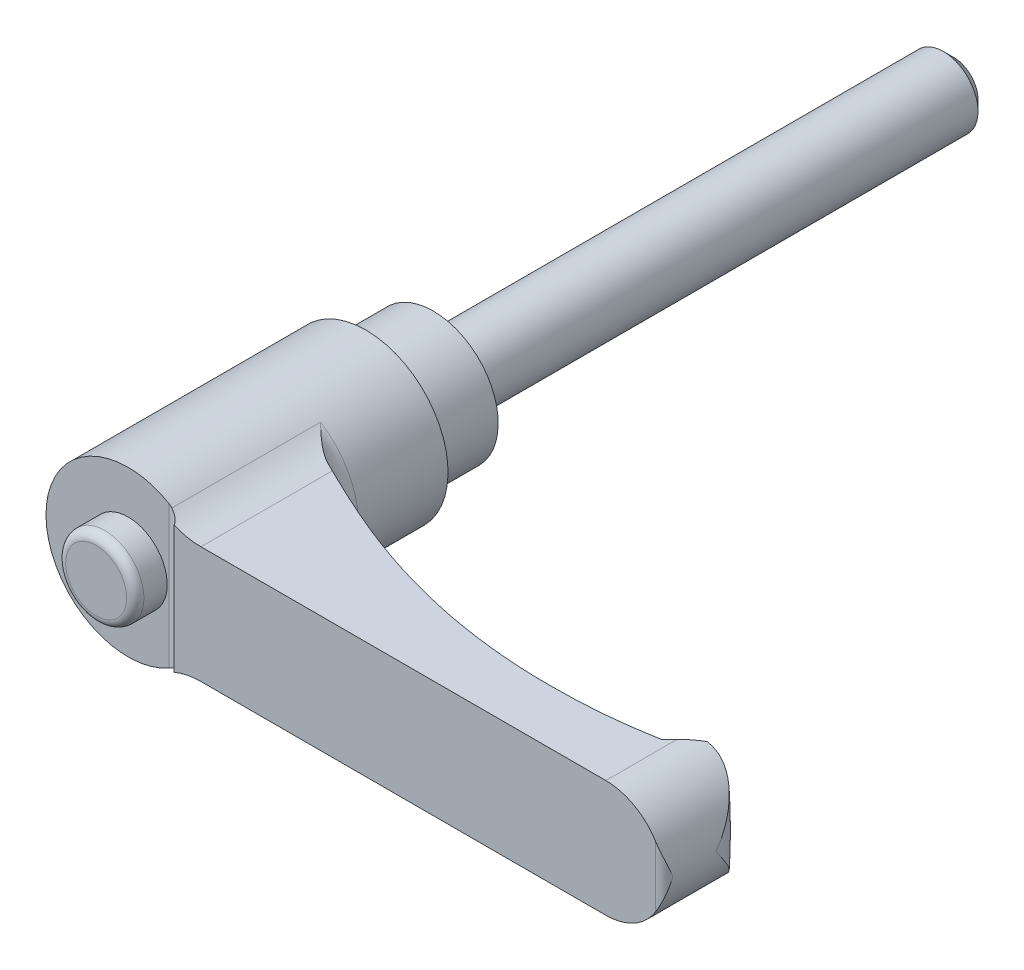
ISO-10303-21;
HEADER;
FILE_DESCRIPTION(('STEP AP214'),'2;1');
FILE_NAME('part.step','',(''),(''),'','','');
FILE_SCHEMA(('AUTOMOTIVE_DESIGN { 1 0 10303 214 1 1 1 1 }'));
ENDSEC;
DATA;
#1=APPLICATION_CONTEXT('core data for automotive mechanical design processes');
#2=APPLICATION_PROTOCOL_DEFINITION('international standard','automotive_design',2000,#1);
#3=PRODUCT_CONTEXT('',#1,'mechanical');
#4=PRODUCT('Part','Part','',(#3));
#5=PRODUCT_RELATED_PRODUCT_CATEGORY('part','',(#4));
#6=PRODUCT_DEFINITION_FORMATION('','',#4);
#7=PRODUCT_DEFINITION_CONTEXT('part definition',#1,'design');
#8=PRODUCT_DEFINITION('design','',#6,#7);
#9=PRODUCT_DEFINITION_SHAPE('','',#8);
#10=(LENGTH_UNIT() NAMED_UNIT(*) SI_UNIT(.MILLI.,.METRE.));
#11=(NAMED_UNIT(*) PLANE_ANGLE_UNIT() SI_UNIT($,.RADIAN.));
#12=(NAMED_UNIT(*) SI_UNIT($,.STERADIAN.) SOLID_ANGLE_UNIT());
#13=UNCERTAINTY_MEASURE_WITH_UNIT(LENGTH_MEASURE(1.E-05),#10,'distance_accuracy_value','');
#14=(GEOMETRIC_REPRESENTATION_CONTEXT(3) GLOBAL_UNCERTAINTY_ASSIGNED_CONTEXT((#13)) GLOBAL_UNIT_ASSIGNED_CONTEXT((#10,
#11,#12)) REPRESENTATION_CONTEXT('',''));
#15=CARTESIAN_POINT('',(0.,0.,0.));
#16=DIRECTION('',(0.,0.,1.));
#17=DIRECTION('',(1.,0.,0.));
#18=AXIS2_PLACEMENT_3D('',#15,#16,#17);
#19=CARTESIAN_POINT('',(6.,0.,0.));
#20=DIRECTION('',(0.,0.,1.));
#21=DIRECTION('',(0.,-1.,0.));
#22=AXIS2_PLACEMENT_3D('',#19,#20,#21);
#23=PLANE('',#22);
#24=CARTESIAN_POINT('',(0.,0.,0.));
#25=DIRECTION('',(0.,0.,-1.));
#26=DIRECTION('',(0.,1.,0.));
#27=AXIS2_PLACEMENT_3D('',#24,#25,#26);
#28=CIRCLE('',#27,4.);
#29=CARTESIAN_POINT('',(0.,4.,0.));
#30=VERTEX_POINT('',#29);
#31=EDGE_CURVE('E423',#30,#30,#28,.T.);
#32=ORIENTED_EDGE('',*,*,#31,.F.);
#33=EDGE_LOOP('',(#32));
#34=FACE_BOUND('',#33,.T.);
#35=CARTESIAN_POINT('',(0.,0.,0.));
#36=DIRECTION('',(0.,0.,-1.));
#37=DIRECTION('',(0.,1.,0.));
#38=AXIS2_PLACEMENT_3D('',#35,#36,#37);
#39=CIRCLE('',#38,6.);
#40=CARTESIAN_POINT('',(0.,6.,0.));
#41=VERTEX_POINT('',#40);
#42=EDGE_CURVE('E347',#41,#41,#39,.T.);
#43=ORIENTED_EDGE('',*,*,#42,.T.);
#44=EDGE_LOOP('',(#43));
#45=FACE_BOUND('',#44,.T.);
#46=ADVANCED_FACE('F14',(#34,#45),#23,.F.);
#47=CARTESIAN_POINT('',(0.,0.,35.5));
#48=DIRECTION('',(0.,0.,-1.));
#49=DIRECTION('',(0.,1.,0.));
#50=AXIS2_PLACEMENT_3D('',#47,#48,#49);
#51=PLANE('',#50);
#52=CARTESIAN_POINT('',(0.,0.,35.5));
#53=DIRECTION('',(0.,0.,-1.));
#54=DIRECTION('',(0.,1.,0.));
#55=AXIS2_PLACEMENT_3D('',#52,#53,#54);
#56=CIRCLE('',#55,9.5);
#57=CARTESIAN_POINT('',(4.75,-8.22724133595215,35.5));
#58=VERTEX_POINT('',#57);
#59=CARTESIAN_POINT('',(4.75,8.22724133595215,35.5));
#60=VERTEX_POINT('',#59);
#61=EDGE_CURVE('E332',#58,#60,#56,.T.);
#62=ORIENTED_EDGE('',*,*,#61,.F.);
#63=DIRECTION('',(0.,1.,0.));
#64=VECTOR('',#63,1.);
#65=CARTESIAN_POINT('',(4.75,-13.5,35.5));
#66=LINE('',#65,#64);
#67=EDGE_CURVE('E383',#58,#60,#66,.T.);
#68=ORIENTED_EDGE('',*,*,#67,.T.);
#69=EDGE_LOOP('',(#62,#68));
#70=FACE_BOUND('',#69,.T.);
#71=CARTESIAN_POINT('',(0.,0.,35.5));
#72=DIRECTION('',(0.,0.,-1.));
#73=DIRECTION('',(0.,1.,0.));
#74=AXIS2_PLACEMENT_3D('',#71,#72,#73);
#75=CIRCLE('',#74,4.52380952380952);
#76=CARTESIAN_POINT('',(0.,4.52380952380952,35.5));
#77=VERTEX_POINT('',#76);
#78=EDGE_CURVE('E183',#77,#77,#75,.F.);
#79=ORIENTED_EDGE('',*,*,#78,.F.);
#80=EDGE_LOOP('',(#79));
#81=FACE_BOUND('',#80,.T.);
#82=ADVANCED_FACE('F158',(#70,#81),#51,.F.);
#83=CARTESIAN_POINT('',(56.25,0.,0.));
#84=DIRECTION('',(0.,0.,1.));
#85=DIRECTION('',(0.,-1.,0.));
#86=AXIS2_PLACEMENT_3D('',#83,#84,#85);
#87=CYLINDRICAL_SURFACE('',#86,6.75);
#88=CARTESIAN_POINT('',(63.,0.,30.5));
#89=CARTESIAN_POINT('',(63.0000000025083,-0.0046874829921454,30.4965903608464));
#90=CARTESIAN_POINT('',(62.9999951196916,-0.0093750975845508,30.4931806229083));
#91=CARTESIAN_POINT('',(62.9990237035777,-0.475524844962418,30.1541065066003));
#92=CARTESIAN_POINT('',(62.9507141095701,-0.938185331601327,29.8175642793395));
#93=CARTESIAN_POINT('',(62.8060463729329,-1.62346497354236,29.3225480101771));
#94=CARTESIAN_POINT('',(62.7456147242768,-1.85084323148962,29.1588881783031));
#95=CARTESIAN_POINT('',(62.6000044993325,-2.30127271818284,28.8365968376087));
#96=CARTESIAN_POINT('',(62.5148384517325,-2.52432607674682,28.6779628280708));
#97=CARTESIAN_POINT('',(62.344804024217,-2.90644000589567,28.4087021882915));
#98=CARTESIAN_POINT('',(62.2657268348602,-3.06692788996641,28.2964051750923));
#99=CARTESIAN_POINT('',(62.0934111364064,-3.38371909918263,28.0768184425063));
#100=CARTESIAN_POINT('',(62.0001726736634,-3.5400224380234,27.9695287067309));
#101=CARTESIAN_POINT('',(61.7993668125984,-3.84715615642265,27.7614384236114));
#102=CARTESIAN_POINT('',(61.6918275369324,-3.99799655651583,27.6606257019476));
#103=CARTESIAN_POINT('',(61.4620426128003,-4.29326696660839,27.4668757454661));
#104=CARTESIAN_POINT('',(61.3398014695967,-4.43769892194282,27.3739361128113));
#105=CARTESIAN_POINT('',(61.0188552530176,-4.78536684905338,27.1560724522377));
#106=CARTESIAN_POINT('',(60.8112818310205,-4.9842025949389,27.0367418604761));
#107=CARTESIAN_POINT('',(60.4758984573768,-5.26551240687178,26.8795376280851));
#108=CARTESIAN_POINT('',(60.3601030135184,-5.35645651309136,26.8307690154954));
#109=CARTESIAN_POINT('',(60.1206554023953,-5.53195453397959,26.7416778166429));
#110=CARTESIAN_POINT('',(59.997005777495,-5.61651049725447,26.7013525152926));
#111=CARTESIAN_POINT('',(59.7699445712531,-5.76076929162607,26.6381973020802));
#112=CARTESIAN_POINT('',(59.667954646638,-5.82188686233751,26.6134697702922));
#113=CARTESIAN_POINT('',(59.4598154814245,-5.93917869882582,26.5707512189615));
#114=CARTESIAN_POINT('',(59.3536672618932,-5.99535416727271,26.5527585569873));
#115=CARTESIAN_POINT('',(59.1377410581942,-6.10229132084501,26.5242546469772));
#116=CARTESIAN_POINT('',(59.0279645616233,-6.15305518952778,26.5137403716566));
#117=CARTESIAN_POINT('',(58.8054681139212,-6.24873887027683,26.5009304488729));
#118=CARTESIAN_POINT('',(58.6927495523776,-6.29366138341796,26.4986309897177));
#119=CARTESIAN_POINT('',(58.4641163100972,-6.37770798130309,26.502966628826));
#120=CARTESIAN_POINT('',(58.3481815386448,-6.41677354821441,26.5096859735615));
#121=CARTESIAN_POINT('',(58.1152313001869,-6.48831686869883,26.5328398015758));
#122=CARTESIAN_POINT('',(57.9982157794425,-6.52079429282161,26.5492747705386));
#123=CARTESIAN_POINT('',(57.7644328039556,-6.57901960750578,26.5923251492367));
#124=CARTESIAN_POINT('',(57.6476652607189,-6.60477054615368,26.618935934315));
#125=CARTESIAN_POINT('',(57.41573023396,-6.64962508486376,26.6826067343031));
#126=CARTESIAN_POINT('',(57.3005622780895,-6.66873068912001,26.7196635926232));
#127=CARTESIAN_POINT('',(57.104290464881,-6.69624244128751,26.7926929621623));
#128=CARTESIAN_POINT('',(57.0224673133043,-6.70614558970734,26.8262017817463));
#129=CARTESIAN_POINT('',(56.8609556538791,-6.72278366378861,26.8986767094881));
#130=CARTESIAN_POINT('',(56.781266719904,-6.72951922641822,26.9376417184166));
#131=CARTESIAN_POINT('',(56.624433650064,-6.74006528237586,27.0209540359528));
#132=CARTESIAN_POINT('',(56.5472927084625,-6.74387222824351,27.0653077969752));
#133=CARTESIAN_POINT('',(56.3961054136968,-6.74884425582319,27.1591719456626));
#134=CARTESIAN_POINT('',(56.3220596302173,-6.75000885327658,27.2086832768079));
#135=CARTESIAN_POINT('',(56.2498,-6.74999999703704,27.2606710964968));
#136=B_SPLINE_CURVE_WITH_KNOTS('',3,(#88,#89,#90,#91,#92,#93,#94,#95,#96,#97,#98,#99,#100,#101,
#102,#103,#104,#105,#106,#107,#108,#109,#110,#111,#112,#113,#114,#115,#116,#117,#118,#119,#120,
#121,#122,#123,#124,#125,#126,#127,#128,#129,#130,#131,#132,#133,#134,#135),.UNSPECIFIED.,.F.,
.F.,(4,2,2,2,2,2,2,2,2,2,2,2,2,2,2,2,2,2,2,2,2,2,2,4),(0.,0.0173896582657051,1.7292315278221,
2.5882674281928,3.44686895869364,4.08007105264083,4.71327107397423,5.34524382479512,
5.97702340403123,6.9068284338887,7.37170994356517,7.83644173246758,8.20045511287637,
8.56437966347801,8.92815681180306,9.29176514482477,9.65879376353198,10.0258407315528,
10.3927210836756,10.7594906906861,11.0261722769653,11.2928002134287,11.5597506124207,
11.8267499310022),.UNSPECIFIED.);
#137=CARTESIAN_POINT('',(58.6622222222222,-6.30425919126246,26.5));
#138=VERTEX_POINT('',#137);
#139=CARTESIAN_POINT('',(63.,0.,30.5));
#140=VERTEX_POINT('',#139);
#141=EDGE_CURVE('E126',#138,#140,#136,.F.);
#142=ORIENTED_EDGE('',*,*,#141,.T.);
#143=CARTESIAN_POINT('',(63.,0.,30.5));
#144=CARTESIAN_POINT('',(63.0000000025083,0.00468748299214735,30.4965903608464));
#145=CARTESIAN_POINT('',(62.9999951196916,0.00937509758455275,30.4931806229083));
#146=CARTESIAN_POINT('',(62.9990237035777,0.47552484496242,30.1541065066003));
#147=CARTESIAN_POINT('',(62.9507141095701,0.938185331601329,29.8175642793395));
#148=CARTESIAN_POINT('',(62.8060463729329,1.62346497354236,29.3225480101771));
#149=CARTESIAN_POINT('',(62.7456147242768,1.85084323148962,29.1588881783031));
#150=CARTESIAN_POINT('',(62.6000044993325,2.30127271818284,28.8365968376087));
#151=CARTESIAN_POINT('',(62.5148384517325,2.52432607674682,28.6779628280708));
#152=CARTESIAN_POINT('',(62.344804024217,2.90644000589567,28.4087021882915));
#153=CARTESIAN_POINT('',(62.2657268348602,3.06692788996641,28.2964051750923));
#154=CARTESIAN_POINT('',(62.0934111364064,3.38371909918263,28.0768184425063));
#155=CARTESIAN_POINT('',(62.0001726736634,3.5400224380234,27.9695287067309));
#156=CARTESIAN_POINT('',(61.7993668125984,3.84715615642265,27.7614384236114));
#157=CARTESIAN_POINT('',(61.6918275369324,3.99799655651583,27.6606257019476));
#158=CARTESIAN_POINT('',(61.4620426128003,4.29326696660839,27.4668757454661));
#159=CARTESIAN_POINT('',(61.3398014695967,4.43769892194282,27.3739361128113));
#160=CARTESIAN_POINT('',(61.0188552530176,4.78536684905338,27.1560724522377));
#161=CARTESIAN_POINT('',(60.8112818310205,4.9842025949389,27.0367418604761));
#162=CARTESIAN_POINT('',(60.4758984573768,5.26551240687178,26.8795376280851));
#163=CARTESIAN_POINT('',(60.3601030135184,5.35645651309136,26.8307690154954));
#164=CARTESIAN_POINT('',(60.1206554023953,5.53195453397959,26.7416778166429));
#165=CARTESIAN_POINT('',(59.997005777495,5.61651049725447,26.7013525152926));
#166=CARTESIAN_POINT('',(59.7699445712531,5.76076929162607,26.6381973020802));
#167=CARTESIAN_POINT('',(59.667954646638,5.82188686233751,26.6134697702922));
#168=CARTESIAN_POINT('',(59.4598154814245,5.93917869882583,26.5707512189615));
#169=CARTESIAN_POINT('',(59.3536672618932,5.99535416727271,26.5527585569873));
#170=CARTESIAN_POINT('',(59.1377410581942,6.10229132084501,26.5242546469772));
#171=CARTESIAN_POINT('',(59.0279645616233,6.15305518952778,26.5137403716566));
#172=CARTESIAN_POINT('',(58.8054681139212,6.24873887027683,26.5009304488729));
#173=CARTESIAN_POINT('',(58.6927495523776,6.29366138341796,26.4986309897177));
#174=CARTESIAN_POINT('',(58.4641163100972,6.37770798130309,26.502966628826));
#175=CARTESIAN_POINT('',(58.3481815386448,6.41677354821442,26.5096859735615));
#176=CARTESIAN_POINT('',(58.1152313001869,6.48831686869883,26.5328398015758));
#177=CARTESIAN_POINT('',(57.9982157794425,6.52079429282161,26.5492747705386));
#178=CARTESIAN_POINT('',(57.7644328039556,6.57901960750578,26.5923251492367));
#179=CARTESIAN_POINT('',(57.6476652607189,6.60477054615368,26.618935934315));
#180=CARTESIAN_POINT('',(57.41573023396,6.64962508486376,26.6826067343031));
#181=CARTESIAN_POINT('',(57.3005622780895,6.66873068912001,26.7196635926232));
#182=CARTESIAN_POINT('',(57.1042904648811,6.69624244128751,26.7926929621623));
#183=CARTESIAN_POINT('',(57.0224673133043,6.70614558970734,26.8262017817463));
#184=CARTESIAN_POINT('',(56.8609556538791,6.72278366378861,26.8986767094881));
#185=CARTESIAN_POINT('',(56.781266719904,6.72951922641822,26.9376417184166));
#186=CARTESIAN_POINT('',(56.624433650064,6.74006528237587,27.0209540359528));
#187=CARTESIAN_POINT('',(56.5472927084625,6.74387222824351,27.0653077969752));
#188=CARTESIAN_POINT('',(56.3961054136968,6.74884425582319,27.1591719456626));
#189=CARTESIAN_POINT('',(56.3220596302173,6.75000885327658,27.2086832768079));
#190=CARTESIAN_POINT('',(56.2498,6.74999999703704,27.2606710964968));
#191=B_SPLINE_CURVE_WITH_KNOTS('',3,(#143,#144,#145,#146,#147,#148,#149,#150,#151,#152,#153,
#154,#155,#156,#157,#158,#159,#160,#161,#162,#163,#164,#165,#166,#167,#168,#169,#170,#171,#172,
#173,#174,#175,#176,#177,#178,#179,#180,#181,#182,#183,#184,#185,#186,#187,#188,#189,#190),
.UNSPECIFIED.,.F.,.F.,(4,2,2,2,2,2,2,2,2,2,2,2,2,2,2,2,2,2,2,2,2,2,2,4),(0.,0.0173896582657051,
1.7292315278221,2.5882674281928,3.44686895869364,4.08007105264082,4.71327107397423,
5.34524382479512,5.97702340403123,6.9068284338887,7.37170994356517,7.83644173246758,
8.20045511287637,8.56437966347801,8.92815681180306,9.29176514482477,9.65879376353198,
10.0258407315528,10.3927210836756,10.7594906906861,11.0261722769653,11.2928002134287,
11.5597506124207,11.8267499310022),.UNSPECIFIED.);
#192=CARTESIAN_POINT('',(58.6622222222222,6.30425919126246,26.5));
#193=VERTEX_POINT('',#192);
#194=EDGE_CURVE('E123',#140,#193,#191,.T.);
#195=ORIENTED_EDGE('',*,*,#194,.T.);
#196=CARTESIAN_POINT('',(56.25,0.,26.5));
#197=DIRECTION('',(0.,0.,-1.));
#198=DIRECTION('',(0.,1.,0.));
#199=AXIS2_PLACEMENT_3D('',#196,#197,#198);
#200=CIRCLE('',#199,6.75);
#201=CARTESIAN_POINT('',(58.,6.51920240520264,26.5));
#202=VERTEX_POINT('',#201);
#203=EDGE_CURVE('E308',#193,#202,#200,.F.);
#204=ORIENTED_EDGE('',*,*,#203,.T.);
#205=CARTESIAN_POINT('',(56.25,0.,28.25));
#206=DIRECTION('',(-0.707106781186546,0.,-0.70710678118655));
#207=DIRECTION('',(-0.70710678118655,0.,0.707106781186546));
#208=AXIS2_PLACEMENT_3D('',#205,#206,#207);
#209=ELLIPSE('',#208,9.54594154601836,6.75);
#210=CARTESIAN_POINT('',(56.25,6.75,28.25));
#211=VERTEX_POINT('',#210);
#212=EDGE_CURVE('E374',#202,#211,#209,.F.);
#213=ORIENTED_EDGE('',*,*,#212,.T.);
#214=DIRECTION('',(0.,0.,1.));
#215=VECTOR('',#214,1.);
#216=CARTESIAN_POINT('',(56.25,6.75,0.));
#217=LINE('',#216,#215);
#218=CARTESIAN_POINT('',(56.25,6.75,36.5));
#219=VERTEX_POINT('',#218);
#220=EDGE_CURVE('E330',#211,#219,#217,.T.);
#221=ORIENTED_EDGE('',*,*,#220,.T.);
#222=CARTESIAN_POINT('',(56.25,0.,36.5));
#223=DIRECTION('',(0.,0.,1.));
#224=DIRECTION('',(0.,-1.,0.));
#225=AXIS2_PLACEMENT_3D('',#222,#223,#224);
#226=CIRCLE('',#225,6.75);
#227=CARTESIAN_POINT('',(62.,3.53553390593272,36.5));
#228=VERTEX_POINT('',#227);
#229=EDGE_CURVE('E322',#228,#219,#226,.T.);
#230=ORIENTED_EDGE('',*,*,#229,.F.);
#231=CARTESIAN_POINT('',(62.,3.53553390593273,36.5));
#232=CARTESIAN_POINT('',(62.0299932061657,3.48675666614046,36.4999933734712));
#233=CARTESIAN_POINT('',(62.0593538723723,3.43761273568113,36.4986515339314));
#234=CARTESIAN_POINT('',(62.1167538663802,3.33870692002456,36.4935798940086));
#235=CARTESIAN_POINT('',(62.1447937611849,3.28894531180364,36.489851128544));
#236=CARTESIAN_POINT('',(62.2267562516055,3.13908056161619,36.4755285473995));
#237=CARTESIAN_POINT('',(62.2786643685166,3.03816514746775,36.4617957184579));
#238=CARTESIAN_POINT('',(62.3766467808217,2.83536966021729,36.4277987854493));
#239=CARTESIAN_POINT('',(62.4227515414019,2.73349792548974,36.4075709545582));
#240=CARTESIAN_POINT('',(62.509502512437,2.52854152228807,36.3618646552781));
#241=CARTESIAN_POINT('',(62.550144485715,2.42545597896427,36.3363821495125));
#242=CARTESIAN_POINT('',(62.6493297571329,2.15471359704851,36.2642737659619));
#243=CARTESIAN_POINT('',(62.7035065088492,1.98634279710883,36.2142841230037));
#244=CARTESIAN_POINT('',(62.7980553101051,1.64812969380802,36.1068184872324));
#245=CARTESIAN_POINT('',(62.8384218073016,1.4782868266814,36.0493394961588));
#246=CARTESIAN_POINT('',(62.9057483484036,1.1374266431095,35.9293690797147));
#247=CARTESIAN_POINT('',(62.9326868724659,0.966407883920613,35.8668697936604));
#248=CARTESIAN_POINT('',(62.9733111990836,0.623942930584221,35.7390768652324));
#249=CARTESIAN_POINT('',(62.9870036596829,0.452496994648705,35.6737846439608));
#250=CARTESIAN_POINT('',(62.997837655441,0.192449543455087,35.5740662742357));
#251=CARTESIAN_POINT('',(62.999781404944,0.103891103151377,35.539987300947));
#252=CARTESIAN_POINT('',(62.9999941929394,0.0102233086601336,35.5039349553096));
#253=CARTESIAN_POINT('',(62.9999999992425,0.00511164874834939,35.5019674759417));
#254=CARTESIAN_POINT('',(63.,0.,35.5));
#255=B_SPLINE_CURVE_WITH_KNOTS('',3,(#231,#232,#233,#234,#235,#236,#237,#238,#239,#240,#241,
#242,#243,#244,#245,#246,#247,#248,#249,#250,#251,#252,#253,#254),.UNSPECIFIED.,.F.,.F.,(4,2,2,
2,2,2,2,2,2,2,2,4),(0.,0.171732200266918,0.343389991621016,0.685890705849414,1.02651095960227,
1.36739390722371,1.91796289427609,2.46875297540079,3.02042294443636,3.57181547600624,
3.85648313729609,3.87291482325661),.UNSPECIFIED.);
#256=CARTESIAN_POINT('',(63.,0.,35.5));
#257=VERTEX_POINT('',#256);
#258=EDGE_CURVE('E169',#257,#228,#255,.F.);
#259=ORIENTED_EDGE('',*,*,#258,.F.);
#260=CARTESIAN_POINT('',(62.,-3.53553390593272,36.5));
#261=CARTESIAN_POINT('',(62.0299932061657,-3.48675666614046,36.4999933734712));
#262=CARTESIAN_POINT('',(62.0593538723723,-3.43761273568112,36.4986515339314));
#263=CARTESIAN_POINT('',(62.1167538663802,-3.33870692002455,36.4935798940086));
#264=CARTESIAN_POINT('',(62.1447937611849,-3.28894531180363,36.489851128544));
#265=CARTESIAN_POINT('',(62.2267562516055,-3.13908056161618,36.4755285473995));
#266=CARTESIAN_POINT('',(62.2786643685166,-3.03816514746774,36.4617957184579));
#267=CARTESIAN_POINT('',(62.3766467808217,-2.83536966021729,36.4277987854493));
#268=CARTESIAN_POINT('',(62.4227515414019,-2.73349792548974,36.4075709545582));
#269=CARTESIAN_POINT('',(62.509502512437,-2.52854152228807,36.3618646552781));
#270=CARTESIAN_POINT('',(62.550144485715,-2.42545597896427,36.3363821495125));
#271=CARTESIAN_POINT('',(62.6493297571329,-2.15471359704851,36.2642737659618));
#272=CARTESIAN_POINT('',(62.7035065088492,-1.98634279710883,36.2142841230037));
#273=CARTESIAN_POINT('',(62.7980553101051,-1.64812969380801,36.1068184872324));
#274=CARTESIAN_POINT('',(62.8384218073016,-1.4782868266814,36.0493394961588));
#275=CARTESIAN_POINT('',(62.9057483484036,-1.1374266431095,35.9293690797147));
#276=CARTESIAN_POINT('',(62.9326868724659,-0.966407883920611,35.8668697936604));
#277=CARTESIAN_POINT('',(62.9733111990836,-0.623942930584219,35.7390768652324));
#278=CARTESIAN_POINT('',(62.9870036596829,-0.452496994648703,35.6737846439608));
#279=CARTESIAN_POINT('',(62.997837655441,-0.192449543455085,35.5740662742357));
#280=CARTESIAN_POINT('',(62.999781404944,-0.103891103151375,35.539987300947));
#281=CARTESIAN_POINT('',(62.9999941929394,-0.0102233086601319,35.5039349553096));
#282=CARTESIAN_POINT('',(62.9999999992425,-0.00511164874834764,35.5019674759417));
#283=CARTESIAN_POINT('',(63.,0.,35.5));
#284=B_SPLINE_CURVE_WITH_KNOTS('',3,(#260,#261,#262,#263,#264,#265,#266,#267,#268,#269,#270,
#271,#272,#273,#274,#275,#276,#277,#278,#279,#280,#281,#282,#283),.UNSPECIFIED.,.F.,.F.,(4,2,2,
2,2,2,2,2,2,2,2,4),(0.,0.171732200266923,0.34338999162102,0.685890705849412,1.02651095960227,
1.36739390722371,1.91796289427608,2.46875297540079,3.02042294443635,3.57181547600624,
3.85648313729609,3.8729148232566),.UNSPECIFIED.);
#285=CARTESIAN_POINT('',(62.,-3.53553390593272,36.5));
#286=VERTEX_POINT('',#285);
#287=EDGE_CURVE('E177',#286,#257,#284,.T.);
#288=ORIENTED_EDGE('',*,*,#287,.F.);
#289=CARTESIAN_POINT('',(56.25,-6.75,36.5));
#290=VERTEX_POINT('',#289);
#291=EDGE_CURVE('E310',#290,#286,#226,.T.);
#292=ORIENTED_EDGE('',*,*,#291,.F.);
#293=DIRECTION('',(0.,0.,1.));
#294=VECTOR('',#293,1.);
#295=CARTESIAN_POINT('',(56.25,-6.75,0.));
#296=LINE('',#295,#294);
#297=CARTESIAN_POINT('',(56.25,-6.75,28.25));
#298=VERTEX_POINT('',#297);
#299=EDGE_CURVE('E355',#298,#290,#296,.T.);
#300=ORIENTED_EDGE('',*,*,#299,.F.);
#301=CARTESIAN_POINT('',(58.,-6.51920240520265,26.5));
#302=VERTEX_POINT('',#301);
#303=EDGE_CURVE('E375',#298,#302,#209,.F.);
#304=ORIENTED_EDGE('',*,*,#303,.T.);
#305=EDGE_CURVE('E134',#302,#138,#200,.F.);
#306=ORIENTED_EDGE('',*,*,#305,.T.);
#307=EDGE_LOOP('',(#142,#195,#204,#213,#221,#230,#259,#288,#292,#300,#304,#306));
#308=FACE_BOUND('',#307,.T.);
#309=ADVANCED_FACE('F132',(#308),#87,.T.);
#310=CARTESIAN_POINT('',(59.,-13.5,26.5));
#311=DIRECTION('',(0.,0.,-1.));
#312=DIRECTION('',(0.,1.,0.));
#313=AXIS2_PLACEMENT_3D('',#310,#311,#312);
#314=PLANE('',#313);
#315=ORIENTED_EDGE('',*,*,#203,.F.);
#316=CARTESIAN_POINT('',(0.,0.,26.5));
#317=DIRECTION('',(0.,0.,-1.));
#318=DIRECTION('',(0.,1.,0.));
#319=AXIS2_PLACEMENT_3D('',#316,#317,#318);
#320=CIRCLE('',#319,59.);
#321=EDGE_CURVE('E37',#193,#138,#320,.T.);
#322=ORIENTED_EDGE('',*,*,#321,.T.);
#323=ORIENTED_EDGE('',*,*,#305,.F.);
#324=DIRECTION('',(0.,1.,0.));
#325=VECTOR('',#324,1.);
#326=CARTESIAN_POINT('',(58.,-13.5,26.5));
#327=LINE('',#326,#325);
#328=EDGE_CURVE('E327',#302,#202,#327,.T.);
#329=ORIENTED_EDGE('',*,*,#328,.T.);
#330=EDGE_LOOP('',(#315,#322,#323,#329));
#331=FACE_BOUND('',#330,.T.);
#332=ADVANCED_FACE('F157',(#331),#314,.T.);
#333=CARTESIAN_POINT('',(0.,0.,36.5));
#334=DIRECTION('',(0.,0.,1.));
#335=DIRECTION('',(0.,-1.,0.));
#336=AXIS2_PLACEMENT_3D('',#333,#334,#335);
#337=PLANE('',#336);
#338=CARTESIAN_POINT('',(9.41740410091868,14.75,36.5));
#339=DIRECTION('',(0.,0.,1.));
#340=DIRECTION('',(1.,0.,0.));
#341=AXIS2_PLACEMENT_3D('',#338,#339,#340);
#342=CIRCLE('',#341,8.);
#343=CARTESIAN_POINT('',(6.33333333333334,7.36836688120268,36.5));
#344=VERTEX_POINT('',#343);
#345=CARTESIAN_POINT('',(9.41740410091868,6.75,36.5));
#346=VERTEX_POINT('',#345);
#347=EDGE_CURVE('E369',#344,#346,#342,.T.);
#348=ORIENTED_EDGE('',*,*,#347,.F.);
#349=DIRECTION('',(0.,1.,0.));
#350=VECTOR('',#349,1.);
#351=CARTESIAN_POINT('',(6.33333333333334,-13.5,36.5));
#352=LINE('',#351,#350);
#353=CARTESIAN_POINT('',(6.33333333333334,-7.36836688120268,36.5));
#354=VERTEX_POINT('',#353);
#355=EDGE_CURVE('E326',#354,#344,#352,.T.);
#356=ORIENTED_EDGE('',*,*,#355,.F.);
#357=CARTESIAN_POINT('',(9.41740410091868,-14.75,36.5));
#358=DIRECTION('',(0.,0.,1.));
#359=DIRECTION('',(1.,0.,0.));
#360=AXIS2_PLACEMENT_3D('',#357,#358,#359);
#361=CIRCLE('',#360,8.);
#362=CARTESIAN_POINT('',(9.41740410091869,-6.75,36.5));
#363=VERTEX_POINT('',#362);
#364=EDGE_CURVE('E361',#363,#354,#361,.T.);
#365=ORIENTED_EDGE('',*,*,#364,.F.);
#366=DIRECTION('',(-1.,0.,0.));
#367=VECTOR('',#366,1.);
#368=CARTESIAN_POINT('',(56.25,-6.75,36.5));
#369=LINE('',#368,#367);
#370=EDGE_CURVE('E364',#290,#363,#369,.T.);
#371=ORIENTED_EDGE('',*,*,#370,.F.);
#372=ORIENTED_EDGE('',*,*,#291,.T.);
#373=DIRECTION('',(0.,1.,0.));
#374=VECTOR('',#373,1.);
#375=CARTESIAN_POINT('',(62.,-13.5,36.5));
#376=LINE('',#375,#374);
#377=EDGE_CURVE('E315',#286,#228,#376,.T.);
#378=ORIENTED_EDGE('',*,*,#377,.T.);
#379=ORIENTED_EDGE('',*,*,#229,.T.);
#380=DIRECTION('',(1.,0.,0.));
#381=VECTOR('',#380,1.);
#382=CARTESIAN_POINT('',(9.41740410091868,6.75,36.5));
#383=LINE('',#382,#381);
#384=EDGE_CURVE('E367',#346,#219,#383,.T.);
#385=ORIENTED_EDGE('',*,*,#384,.F.);
#386=EDGE_LOOP('',(#348,#356,#365,#371,#372,#378,#379,#385));
#387=FACE_BOUND('',#386,.T.);
#388=ADVANCED_FACE('F240',(#387),#337,.T.);
#389=CARTESIAN_POINT('',(0.,0.,0.));
#390=DIRECTION('',(0.,0.,-1.));
#391=DIRECTION('',(0.,1.,0.));
#392=AXIS2_PLACEMENT_3D('',#389,#390,#391);
#393=CYLINDRICAL_SURFACE('',#392,9.5);
#394=CARTESIAN_POINT('',(0.,0.,18.3481601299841));
#395=DIRECTION('',(0.,0.,-1.));
#396=DIRECTION('',(0.,1.,0.));
#397=AXIS2_PLACEMENT_3D('',#394,#395,#396);
#398=CIRCLE('',#397,9.5);
#399=CARTESIAN_POINT('',(5.11230508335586,8.00714285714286,18.3481601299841));
#400=VERTEX_POINT('',#399);
#401=CARTESIAN_POINT('',(5.11230508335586,-8.00714285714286,18.3481601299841));
#402=VERTEX_POINT('',#401);
#403=EDGE_CURVE('E413',#400,#402,#398,.T.);
#404=ORIENTED_EDGE('',*,*,#403,.T.);
#405=DIRECTION('',(0.,0.,1.));
#406=VECTOR('',#405,1.);
#407=CARTESIAN_POINT('',(5.11230508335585,-8.00714285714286,0.));
#408=LINE('',#407,#406);
#409=CARTESIAN_POINT('',(5.11230508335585,-8.00714285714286,35.5614827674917));
#410=VERTEX_POINT('',#409);
#411=EDGE_CURVE('E359',#402,#410,#408,.T.);
#412=ORIENTED_EDGE('',*,*,#411,.T.);
#413=CARTESIAN_POINT('',(4.75,-8.22724133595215,35.5));
#414=CARTESIAN_POINT('',(4.82354897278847,-8.18479174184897,35.5056127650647));
#415=CARTESIAN_POINT('',(4.89626028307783,-8.1414834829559,35.5152432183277));
#416=CARTESIAN_POINT('',(5.03945202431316,-8.05362753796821,35.5421901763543));
#417=CARTESIAN_POINT('',(5.10993308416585,-8.00908020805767,35.5595044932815));
#418=CARTESIAN_POINT('',(5.24861636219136,-7.91889687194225,35.6016146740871));
#419=CARTESIAN_POINT('',(5.31680005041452,-7.87325555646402,35.6264601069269));
#420=CARTESIAN_POINT('',(5.44990684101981,-7.7817124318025,35.6832973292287));
#421=CARTESIAN_POINT('',(5.51483003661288,-7.7358106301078,35.7152889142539));
#422=CARTESIAN_POINT('',(5.69141984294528,-7.6077148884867,35.8145402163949));
#423=CARTESIAN_POINT('',(5.79903338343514,-7.52579740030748,35.8895684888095));
#424=CARTESIAN_POINT('',(5.99917718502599,-7.36722875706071,36.0610902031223));
#425=CARTESIAN_POINT('',(6.09178179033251,-7.29055280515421,36.157471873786));
#426=CARTESIAN_POINT('',(6.20382113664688,-7.19472379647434,36.3011658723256));
#427=CARTESIAN_POINT('',(6.23139044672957,-7.17084441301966,36.33916914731));
#428=CARTESIAN_POINT('',(6.28417716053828,-7.12462925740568,36.4176957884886));
#429=CARTESIAN_POINT('',(6.30939340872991,-7.1022942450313,36.4582203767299));
#430=CARTESIAN_POINT('',(6.33333333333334,-7.08088192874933,36.5));
#431=B_SPLINE_CURVE_WITH_KNOTS('',3,(#413,#414,#415,#416,#417,#418,#419,#420,#421,#422,#423,
#424,#425,#426,#427,#428,#429,#430),.UNSPECIFIED.,.F.,.F.,(4,2,2,2,2,2,2,2,4),(0.,
0.25516766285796,0.510262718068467,0.767074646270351,1.02387922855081,1.48566336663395,
1.94508518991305,2.10299549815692,2.26098294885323),.UNSPECIFIED.);
#432=EDGE_CURVE('E214',#58,#410,#431,.T.);
#433=ORIENTED_EDGE('',*,*,#432,.F.);
#434=ORIENTED_EDGE('',*,*,#61,.T.);
#435=CARTESIAN_POINT('',(6.33333333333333,7.08088192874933,36.5));
#436=CARTESIAN_POINT('',(6.30193651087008,7.10896982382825,36.4452145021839));
#437=CARTESIAN_POINT('',(6.26833956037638,7.13863883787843,36.3925689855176));
#438=CARTESIAN_POINT('',(6.19723055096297,7.20045324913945,36.2916619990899));
#439=CARTESIAN_POINT('',(6.15972345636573,7.23259549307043,36.243395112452));
#440=CARTESIAN_POINT('',(6.08131079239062,7.2986494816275,36.1513438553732));
#441=CARTESIAN_POINT('',(6.04041526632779,7.33255589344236,36.1075470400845));
#442=CARTESIAN_POINT('',(5.95546899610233,7.40171574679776,36.0242830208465));
#443=CARTESIAN_POINT('',(5.91141716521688,7.4369696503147,35.9848173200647));
#444=CARTESIAN_POINT('',(5.7754647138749,7.54368484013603,35.8733623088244));
#445=CARTESIAN_POINT('',(5.67929205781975,7.61650473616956,35.8077657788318));
#446=CARTESIAN_POINT('',(5.47750803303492,7.76289095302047,35.6942705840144));
#447=CARTESIAN_POINT('',(5.37189158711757,7.83645765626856,35.6463815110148));
#448=CARTESIAN_POINT('',(5.1806466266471,7.96370194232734,35.5790108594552));
#449=CARTESIAN_POINT('',(5.09668204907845,8.01772299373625,35.5554125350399));
#450=CARTESIAN_POINT('',(4.92555498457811,8.12398585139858,35.5192948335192));
#451=CARTESIAN_POINT('',(4.83839896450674,8.17623088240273,35.5067542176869));
#452=CARTESIAN_POINT('',(4.75,8.22724133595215,35.5));
#453=B_SPLINE_CURVE_WITH_KNOTS('',3,(#435,#436,#437,#438,#439,#440,#441,#442,#443,#444,#445,
#446,#447,#448,#449,#450,#451,#452),.UNSPECIFIED.,.F.,.F.,(4,2,2,2,2,2,2,2,4),(0.,
0.207163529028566,0.414067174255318,0.620378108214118,0.826760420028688,1.23705708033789,
1.64757566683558,1.9547198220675,2.26127274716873),.UNSPECIFIED.);
#454=CARTESIAN_POINT('',(5.11230508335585,8.00714285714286,35.5614827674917));
#455=VERTEX_POINT('',#454);
#456=EDGE_CURVE('E228',#455,#60,#453,.T.);
#457=ORIENTED_EDGE('',*,*,#456,.F.);
#458=DIRECTION('',(0.,0.,1.));
#459=VECTOR('',#458,1.);
#460=CARTESIAN_POINT('',(5.11230508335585,8.00714285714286,0.));
#461=LINE('',#460,#459);
#462=EDGE_CURVE('E350',#400,#455,#461,.T.);
#463=ORIENTED_EDGE('',*,*,#462,.F.);
#464=EDGE_LOOP('',(#404,#412,#433,#434,#457,#463));
#465=FACE_BOUND('',#464,.T.);
#466=CARTESIAN_POINT('',(0.,0.,8.));
#467=DIRECTION('',(0.,0.,-1.));
#468=DIRECTION('',(0.,1.,0.));
#469=AXIS2_PLACEMENT_3D('',#466,#467,#468);
#470=CIRCLE('',#469,9.5);
#471=CARTESIAN_POINT('',(0.,9.5,8.));
#472=VERTEX_POINT('',#471);
#473=EDGE_CURVE('E333',#472,#472,#470,.T.);
#474=ORIENTED_EDGE('',*,*,#473,.F.);
#475=EDGE_LOOP('',(#474));
#476=FACE_BOUND('',#475,.T.);
#477=ADVANCED_FACE('F238',(#465,#476),#393,.T.);
#478=CARTESIAN_POINT('',(9.41740410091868,14.75,0.));
#479=DIRECTION('',(0.,0.,1.));
#480=DIRECTION('',(0.,-1.,0.));
#481=AXIS2_PLACEMENT_3D('',#478,#479,#480);
#482=CYLINDRICAL_SURFACE('',#481,8.);
#483=DIRECTION('',(0.,0.,1.));
#484=VECTOR('',#483,1.);
#485=CARTESIAN_POINT('',(9.41740410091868,6.75,0.));
#486=LINE('',#485,#484);
#487=CARTESIAN_POINT('',(9.41740410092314,6.75,21.3021638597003));
#488=VERTEX_POINT('',#487);
#489=EDGE_CURVE('E352',#488,#346,#486,.T.);
#490=ORIENTED_EDGE('',*,*,#489,.F.);
#491=CARTESIAN_POINT('',(9.41760410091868,6.7500000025,21.3022609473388));
#492=CARTESIAN_POINT('',(9.34663199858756,6.74999859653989,21.2678090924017));
#493=CARTESIAN_POINT('',(9.27552780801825,6.75094090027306,21.2336266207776));
#494=CARTESIAN_POINT('',(9.13312349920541,6.75473540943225,21.1659081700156));
#495=CARTESIAN_POINT('',(9.06182355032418,6.75758629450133,21.1323717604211));
#496=CARTESIAN_POINT('',(8.91899698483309,6.7652204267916,21.066004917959));
#497=CARTESIAN_POINT('',(8.84747036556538,6.77000369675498,21.0331744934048));
#498=CARTESIAN_POINT('',(8.704162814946,6.78153362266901,20.9682923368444));
#499=CARTESIAN_POINT('',(8.63238174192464,6.78828163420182,20.9362411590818));
#500=CARTESIAN_POINT('',(8.56050869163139,6.79602424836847,20.9046385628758));
#501=B_SPLINE_CURVE_WITH_KNOTS('',3,(#491,#492,#493,#494,#495,#496,#497,#498,#499,#500),
.UNSPECIFIED.,.F.,.F.,(4,2,2,2,4),(0.,0.236671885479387,0.473180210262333,0.709691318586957,
0.946365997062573),.UNSPECIFIED.);
#502=CARTESIAN_POINT('',(8.56096354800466,6.79597525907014,20.9048385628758));
#503=VERTEX_POINT('',#502);
#504=EDGE_CURVE('E246',#488,#503,#501,.T.);
#505=ORIENTED_EDGE('',*,*,#504,.T.);
#506=CARTESIAN_POINT('',(8.56141843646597,6.79592629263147,20.9050385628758));
#507=CARTESIAN_POINT('',(8.47420918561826,6.80531273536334,20.8666951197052));
#508=CARTESIAN_POINT('',(8.38798367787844,6.81604134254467,20.8265142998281));
#509=CARTESIAN_POINT('',(8.21753113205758,6.84002445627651,20.7428900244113));
#510=CARTESIAN_POINT('',(8.13330325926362,6.85327788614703,20.6994479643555));
#511=CARTESIAN_POINT('',(7.88393651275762,6.89653514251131,20.5650030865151));
#512=CARTESIAN_POINT('',(7.72171249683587,6.9300806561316,20.4697011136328));
#513=CARTESIAN_POINT('',(7.40583761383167,7.00533652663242,20.2709379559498));
#514=CARTESIAN_POINT('',(7.25214096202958,7.0469964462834,20.1675294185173));
#515=CARTESIAN_POINT('',(6.95163567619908,7.13786246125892,19.9540740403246));
#516=CARTESIAN_POINT('',(6.80483124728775,7.18707308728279,19.8440232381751));
#517=CARTESIAN_POINT('',(6.52235248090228,7.29074005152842,19.6227797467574));
#518=CARTESIAN_POINT('',(6.38647079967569,7.34497015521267,19.5117441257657));
#519=CARTESIAN_POINT('',(6.12012077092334,7.45966750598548,19.286442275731));
#520=CARTESIAN_POINT('',(5.98965290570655,7.5201353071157,19.1721757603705));
#521=CARTESIAN_POINT('',(5.73356790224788,7.64719834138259,18.9415280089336));
#522=CARTESIAN_POINT('',(5.60795285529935,7.71379617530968,18.825145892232));
#523=CARTESIAN_POINT('',(5.36116691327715,7.853115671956,18.5913699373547));
#524=CARTESIAN_POINT('',(5.23999538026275,7.92583645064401,18.4739762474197));
#525=CARTESIAN_POINT('',(5.11800178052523,8.00350824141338,18.3537764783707));
#526=CARTESIAN_POINT('',(5.11515285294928,8.00532465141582,18.3509683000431));
#527=CARTESIAN_POINT('',(5.11230508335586,8.00714285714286,18.3481601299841));
#528=B_SPLINE_CURVE_WITH_KNOTS('',3,(#506,#507,#508,#509,#510,#511,#512,#513,#514,#515,#516,
#517,#518,#519,#520,#521,#522,#523,#524,#525,#526,#527),.UNSPECIFIED.,.F.,.F.,(4,2,2,2,2,2,2,2,
2,2,4),(0.,0.287104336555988,0.574086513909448,1.14672714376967,1.7159158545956,
2.28544744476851,2.83621563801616,3.38703279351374,3.93808473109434,4.48905724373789,
4.50223731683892),.UNSPECIFIED.);
#529=EDGE_CURVE('E393',#503,#400,#528,.T.);
#530=ORIENTED_EDGE('',*,*,#529,.T.);
#531=ORIENTED_EDGE('',*,*,#462,.T.);
#532=CARTESIAN_POINT('',(6.33333333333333,7.36836688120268,36.5));
#533=CARTESIAN_POINT('',(6.30572631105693,7.37990157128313,36.4517939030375));
#534=CARTESIAN_POINT('',(6.27620115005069,7.39241872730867,36.4049318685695));
#535=CARTESIAN_POINT('',(6.21369042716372,7.41942165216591,36.3142041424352));
#536=CARTESIAN_POINT('',(6.18070621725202,7.433906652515,36.2703372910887));
#537=CARTESIAN_POINT('',(6.11180020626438,7.46478219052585,36.1860768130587));
#538=CARTESIAN_POINT('',(6.07589356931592,7.48116305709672,36.1456672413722));
#539=CARTESIAN_POINT('',(6.001409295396,7.51586753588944,36.0683091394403));
#540=CARTESIAN_POINT('',(5.96283154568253,7.53419123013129,36.0313607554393));
#541=CARTESIAN_POINT('',(5.84377892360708,7.59200134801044,35.9260570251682));
#542=CARTESIAN_POINT('',(5.75985492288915,7.63438377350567,35.8630866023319));
#543=CARTESIAN_POINT('',(5.58613979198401,7.72639161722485,35.7523382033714));
#544=CARTESIAN_POINT('',(5.49634385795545,7.77602300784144,35.7045728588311));
#545=CARTESIAN_POINT('',(5.35683601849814,7.85689272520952,35.6430239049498));
#546=CARTESIAN_POINT('',(5.30809845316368,7.88582630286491,35.6238148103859));
#547=CARTESIAN_POINT('',(5.21035384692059,7.94529574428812,35.5895762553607));
#548=CARTESIAN_POINT('',(5.1613480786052,7.975826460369,35.5745342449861));
#549=CARTESIAN_POINT('',(5.11230508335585,8.00714285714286,35.5614827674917));
#550=B_SPLINE_CURVE_WITH_KNOTS('',3,(#532,#533,#534,#535,#536,#537,#538,#539,#540,#541,#542,
#543,#544,#545,#546,#547,#548,#549),.UNSPECIFIED.,.F.,.F.,(4,2,2,2,2,2,2,2,4),(0.,
0.170139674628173,0.340213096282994,0.50945430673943,0.678702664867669,1.01657399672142,
1.35472528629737,1.53411415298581,1.7129567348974),.UNSPECIFIED.);
#551=EDGE_CURVE('E222',#344,#455,#550,.T.);
#552=ORIENTED_EDGE('',*,*,#551,.F.);
#553=ORIENTED_EDGE('',*,*,#347,.T.);
#554=EDGE_LOOP('',(#490,#505,#530,#531,#552,#553));
#555=FACE_BOUND('',#554,.T.);
#556=ADVANCED_FACE('F234',(#555),#482,.F.);
#557=CARTESIAN_POINT('',(9.41740410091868,6.75,0.));
#558=DIRECTION('',(0.,-1.,0.));
#559=DIRECTION('',(1.,0.,0.));
#560=AXIS2_PLACEMENT_3D('',#557,#558,#559);
#561=PLANE('',#560);
#562=CARTESIAN_POINT('',(43.8904150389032,6.75,-32.7854085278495));
#563=DIRECTION('',(0.,-1.,0.));
#564=DIRECTION('',(1.,0.,0.));
#565=AXIS2_PLACEMENT_3D('',#562,#563,#564);
#566=CIRCLE('',#565,63.);
#567=CARTESIAN_POINT('',(43.630890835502,6.75000000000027,30.2140569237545));
#568=VERTEX_POINT('',#567);
#569=CARTESIAN_POINT('',(55.3333333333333,6.75,29.1666666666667));
#570=VERTEX_POINT('',#569);
#571=EDGE_CURVE('E376',#568,#570,#566,.F.);
#572=ORIENTED_EDGE('',*,*,#571,.F.);
#573=CARTESIAN_POINT('',(31.7211018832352,6.75,29.163677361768));
#574=CARTESIAN_POINT('',(30.4815814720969,6.75,28.9394124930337));
#575=CARTESIAN_POINT('',(29.248337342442,6.75,28.6800208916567));
#576=CARTESIAN_POINT('',(26.798292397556,6.75,28.093381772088));
#577=CARTESIAN_POINT('',(25.5814894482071,6.75,27.7661431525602));
#578=CARTESIAN_POINT('',(23.7726077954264,6.75,27.2275084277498));
#579=CARTESIAN_POINT('',(23.1732161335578,6.75,27.0403034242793));
#580=CARTESIAN_POINT('',(21.9794838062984,6.75,26.6504397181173));
#581=CARTESIAN_POINT('',(21.3851430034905,6.75,26.4477814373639));
#582=CARTESIAN_POINT('',(20.20172109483,6.75,26.027681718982));
#583=CARTESIAN_POINT('',(19.6126399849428,6.75,25.8102402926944));
#584=CARTESIAN_POINT('',(18.4398233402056,6.75,25.3614109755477));
#585=CARTESIAN_POINT('',(17.8560877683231,6.75,25.1300231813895));
#586=CARTESIAN_POINT('',(16.8264520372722,6.75,24.7086305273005));
#587=CARTESIAN_POINT('',(16.3794839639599,6.75,24.5212256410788));
#588=CARTESIAN_POINT('',(15.4885644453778,6.75,24.1393775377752));
#589=CARTESIAN_POINT('',(15.0446130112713,6.75,23.9449342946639));
#590=CARTESIAN_POINT('',(14.1595159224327,6.75,23.5498036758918));
#591=CARTESIAN_POINT('',(13.7183701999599,6.75,23.3491164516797));
#592=CARTESIAN_POINT('',(12.8384969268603,6.75,22.9425083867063));
#593=CARTESIAN_POINT('',(12.3997694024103,6.75,22.7365874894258));
#594=CARTESIAN_POINT('',(11.5213847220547,6.75,22.3195357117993));
#595=CARTESIAN_POINT('',(11.0817393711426,6.75,22.1083800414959));
#596=CARTESIAN_POINT('',(10.2034650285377,6.75,21.6840048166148));
#597=CARTESIAN_POINT('',(9.76483601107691,6.75,21.4707853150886));
#598=CARTESIAN_POINT('',(8.88741279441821,6.75,21.0449308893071));
#599=CARTESIAN_POINT('',(8.4486186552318,6.75,20.832295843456));
#600=CARTESIAN_POINT('',(7.7888040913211,6.75,20.5166390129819));
#601=CARTESIAN_POINT('',(7.56857842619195,6.75,20.4119614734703));
#602=CARTESIAN_POINT('',(7.12729129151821,6.75,20.2043820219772));
#603=CARTESIAN_POINT('',(6.90622982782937,6.75,20.1014800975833));
#604=CARTESIAN_POINT('',(6.48691851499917,6.75,19.9092503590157));
#605=CARTESIAN_POINT('',(6.28878981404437,6.75,19.8196589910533));
#606=CARTESIAN_POINT('',(5.89131318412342,6.75,19.6432260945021));
#607=CARTESIAN_POINT('',(5.69196528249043,6.75,19.5563845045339));
#608=CARTESIAN_POINT('',(5.29178648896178,6.75,19.3863184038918));
#609=CARTESIAN_POINT('',(5.09095599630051,6.75,19.3030929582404));
#610=CARTESIAN_POINT('',(4.68744730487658,6.75,19.1412674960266));
#611=CARTESIAN_POINT('',(4.48476921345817,6.75,19.0626672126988));
#612=CARTESIAN_POINT('',(4.07928382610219,6.75,18.9120884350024));
#613=CARTESIAN_POINT('',(3.87649877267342,6.75,18.8400507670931));
#614=CARTESIAN_POINT('',(3.46854334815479,6.75,18.7031281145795));
#615=CARTESIAN_POINT('',(3.26337283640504,6.75,18.6382435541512));
#616=CARTESIAN_POINT('',(2.64418711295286,6.75,18.4568464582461));
#617=CARTESIAN_POINT('',(2.22603982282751,6.75,18.3534128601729));
#618=CARTESIAN_POINT('',(1.65420364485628,6.75,18.2467177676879));
#619=CARTESIAN_POINT('',(1.50442360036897,6.75,18.2219398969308));
#620=CARTESIAN_POINT('',(1.20392315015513,6.75,18.1790422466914));
#621=CARTESIAN_POINT('',(1.05320291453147,6.75,18.1609212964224));
#622=CARTESIAN_POINT('',(0.751090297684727,6.75,18.1317837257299));
#623=CARTESIAN_POINT('',(0.599697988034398,6.75,18.1207663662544));
#624=CARTESIAN_POINT('',(0.296553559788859,6.75,18.1061196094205));
#625=CARTESIAN_POINT('',(0.144801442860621,6.75,18.1024901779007));
#626=CARTESIAN_POINT('',(-0.159091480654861,6.75,18.1027184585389));
#627=CARTESIAN_POINT('',(-0.311232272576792,6.75,18.1065956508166));
#628=CARTESIAN_POINT('',(-0.615143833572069,6.75,18.121770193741));
#629=CARTESIAN_POINT('',(-0.766914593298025,6.75,18.1330677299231));
#630=CARTESIAN_POINT('',(-1.06969262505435,6.75,18.1627811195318));
#631=CARTESIAN_POINT('',(-1.220700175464,6.75,18.1811941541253));
#632=CARTESIAN_POINT('',(-1.5217232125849,6.75,18.2246820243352));
#633=CARTESIAN_POINT('',(-1.67173881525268,6.75,18.2497560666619));
#634=CARTESIAN_POINT('',(-2.07224275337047,6.75,18.3251477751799));
#635=CARTESIAN_POINT('',(-2.32169003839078,6.75,18.381037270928));
#636=CARTESIAN_POINT('',(-2.81697540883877,6.75,18.507138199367));
#637=CARTESIAN_POINT('',(-3.06281183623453,6.75,18.5773560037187));
#638=CARTESIAN_POINT('',(-3.55135994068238,6.75,18.7293420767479));
#639=CARTESIAN_POINT('',(-3.79406482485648,6.75,18.8111319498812));
#640=CARTESIAN_POINT('',(-4.27623455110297,6.75,18.9835884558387));
#641=CARTESIAN_POINT('',(-4.51569977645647,6.75,19.0742540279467));
#642=CARTESIAN_POINT('',(-4.99367008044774,6.75,19.2630221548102));
#643=CARTESIAN_POINT('',(-5.23215559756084,6.75,19.3611738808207));
#644=CARTESIAN_POINT('',(-5.70695626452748,6.75,19.5625758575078));
#645=CARTESIAN_POINT('',(-5.94327137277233,6.75,19.6658262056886));
#646=CARTESIAN_POINT('',(-6.41402120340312,6.75,19.8759260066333));
#647=CARTESIAN_POINT('',(-6.64845749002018,6.75,19.9827719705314));
#648=CARTESIAN_POINT('',(-7.11612805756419,6.75,20.199046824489));
#649=CARTESIAN_POINT('',(-7.34936235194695,6.75,20.3084756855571));
#650=CARTESIAN_POINT('',(-7.820481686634,6.75,20.5316181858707));
#651=CARTESIAN_POINT('',(-8.05834758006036,6.75,20.6453721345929));
#652=CARTESIAN_POINT('',(-8.53358360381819,6.75,20.8739082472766));
#653=CARTESIAN_POINT('',(-8.77095373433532,6.75,20.9886904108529));
#654=CARTESIAN_POINT('',(-9.48285175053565,6.75,21.3336726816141));
#655=CARTESIAN_POINT('',(-9.95708901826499,6.75,21.5644709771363));
#656=CARTESIAN_POINT('',(-10.904589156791,6.75,22.0230894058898));
#657=CARTESIAN_POINT('',(-11.3778479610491,6.75,22.2509179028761));
#658=CARTESIAN_POINT('',(-12.3264717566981,6.75,22.702156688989));
#659=CARTESIAN_POINT('',(-12.8018367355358,6.75,22.9255670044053));
#660=CARTESIAN_POINT('',(-13.7472574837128,6.75,23.3624658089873));
#661=CARTESIAN_POINT('',(-14.217264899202,6.75,23.5760586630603));
#662=CARTESIAN_POINT('',(-15.160466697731,6.75,23.9960838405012));
#663=CARTESIAN_POINT('',(-15.6336610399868,6.75,24.2025162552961));
#664=CARTESIAN_POINT('',(-16.5835181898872,6.75,24.6072968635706));
#665=CARTESIAN_POINT('',(-17.0601810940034,6.75,24.8056448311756));
#666=CARTESIAN_POINT('',(-18.0170761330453,6.75,25.1935214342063));
#667=CARTESIAN_POINT('',(-18.4973082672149,6.75,25.3830500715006));
#668=CARTESIAN_POINT('',(-19.9446532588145,6.75,25.9379698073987));
#669=CARTESIAN_POINT('',(-20.9172563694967,6.75,26.2891978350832));
#670=CARTESIAN_POINT('',(-22.8764349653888,6.75,26.9503282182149));
#671=CARTESIAN_POINT('',(-23.8630106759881,6.75,27.2602299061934));
#672=CARTESIAN_POINT('',(-25.8434483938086,6.75,27.8346774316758));
#673=CARTESIAN_POINT('',(-26.8372408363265,6.75,28.0994625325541));
#674=CARTESIAN_POINT('',(-28.8357706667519,6.75,28.5839273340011));
#675=CARTESIAN_POINT('',(-29.8405080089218,6.75,28.8036072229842));
#676=CARTESIAN_POINT('',(-31.8589765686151,6.75,29.1964952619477));
#677=CARTESIAN_POINT('',(-32.8727072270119,6.75,29.3697062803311));
#678=CARTESIAN_POINT('',(-34.9071605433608,6.75,29.6686480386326));
#679=CARTESIAN_POINT('',(-35.9278832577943,6.75,29.7943783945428));
#680=CARTESIAN_POINT('',(-37.9963261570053,6.75,29.9997968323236));
#681=CARTESIAN_POINT('',(-39.0441517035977,6.75,30.0784270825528));
#682=CARTESIAN_POINT('',(-41.14239334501,6.75,30.1847467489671));
#683=CARTESIAN_POINT('',(-42.1928094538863,6.75,30.2124358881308));
#684=CARTESIAN_POINT('',(-44.2938118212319,6.75,30.2165051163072));
#685=CARTESIAN_POINT('',(-45.344398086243,6.75,30.1928819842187));
#686=CARTESIAN_POINT('',(-47.4431477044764,6.75,30.0941408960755));
#687=CARTESIAN_POINT('',(-48.4913110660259,6.75,30.0190231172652));
#688=CARTESIAN_POINT('',(-50.5819392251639,6.75,29.8173590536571));
#689=CARTESIAN_POINT('',(-51.6244075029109,6.75,29.6908488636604));
#690=CARTESIAN_POINT('',(-53.7018393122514,6.75,29.3865594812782));
#691=CARTESIAN_POINT('',(-54.7368028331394,6.75,29.2087802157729));
#692=CARTESIAN_POINT('',(-56.796555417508,6.75,28.8022916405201));
#693=CARTESIAN_POINT('',(-57.8213456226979,6.75,28.5735881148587));
#694=CARTESIAN_POINT('',(-59.8583175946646,6.75,28.0657058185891));
#695=CARTESIAN_POINT('',(-60.8704998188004,6.75,27.7865288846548));
#696=CARTESIAN_POINT('',(-62.7386591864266,6.75,27.2210237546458));
#697=CARTESIAN_POINT('',(-63.596613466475,6.75,26.9412039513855));
#698=CARTESIAN_POINT('',(-65.2998711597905,6.75,26.3451620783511));
#699=CARTESIAN_POINT('',(-66.1451735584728,6.75,26.0289371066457));
#700=CARTESIAN_POINT('',(-67.8213142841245,6.75,25.3607166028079));
#701=CARTESIAN_POINT('',(-68.6521555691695,6.75,25.008728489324));
#702=CARTESIAN_POINT('',(-70.2981029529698,6.75,24.2695044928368));
#703=CARTESIAN_POINT('',(-71.1132075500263,6.75,23.8822652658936));
#704=CARTESIAN_POINT('',(-72.7262028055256,6.75,23.0731962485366));
#705=CARTESIAN_POINT('',(-73.524091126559,6.75,22.6513617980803));
#706=CARTESIAN_POINT('',(-75.1011409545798,6.75,21.7738568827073));
#707=CARTESIAN_POINT('',(-75.880300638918,6.75,21.3181831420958));
#708=CARTESIAN_POINT('',(-77.4183136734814,6.75,20.3738879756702));
#709=CARTESIAN_POINT('',(-78.1771685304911,6.75,19.8852690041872));
#710=CARTESIAN_POINT('',(-79.6732930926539,6.75,18.8758914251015));
#711=CARTESIAN_POINT('',(-80.4105607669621,6.75,18.3551298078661));
#712=CARTESIAN_POINT('',(-81.8513021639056,6.75,17.290405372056));
#713=CARTESIAN_POINT('',(-82.5551151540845,6.75,16.746901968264));
#714=CARTESIAN_POINT('',(-83.9391504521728,6.75,15.6306111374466));
#715=CARTESIAN_POINT('',(-84.6193705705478,6.75,15.0578210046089));
#716=CARTESIAN_POINT('',(-86.6226170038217,6.75,13.2971348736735));
#717=CARTESIAN_POINT('',(-87.9086425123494,6.75,12.0666177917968));
#718=CARTESIAN_POINT('',(-90.3715260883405,6.75,9.50168917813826));
#719=CARTESIAN_POINT('',(-91.5484103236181,6.75,8.16730269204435));
#720=CARTESIAN_POINT('',(-93.7851188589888,6.75,5.40369634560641));
#721=CARTESIAN_POINT('',(-94.8449429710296,6.75,3.97447633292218));
#722=CARTESIAN_POINT('',(-96.8361244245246,6.75,1.03692343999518));
#723=CARTESIAN_POINT('',(-97.767942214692,6.75,-0.471097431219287));
#724=CARTESIAN_POINT('',(-99.5010623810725,6.75,-3.56036164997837));
#725=CARTESIAN_POINT('',(-100.302365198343,6.75,-5.14160475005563));
#726=CARTESIAN_POINT('',(-101.768771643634,6.75,-8.36619229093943));
#727=CARTESIAN_POINT('',(-102.433863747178,6.75,-10.0095419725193));
#728=CARTESIAN_POINT('',(-103.622996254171,6.75,-13.3465069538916));
#729=CARTESIAN_POINT('',(-104.147036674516,6.75,-15.0401222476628));
#730=CARTESIAN_POINT('',(-105.049640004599,6.75,-18.4630084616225));
#731=CARTESIAN_POINT('',(-105.428416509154,6.75,-20.1922230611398));
#732=CARTESIAN_POINT('',(-106.038877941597,6.75,-23.6764228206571));
#733=CARTESIAN_POINT('',(-106.270563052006,6.75,-25.4314079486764));
#734=CARTESIAN_POINT('',(-106.585179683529,6.75,-28.9546005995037));
#735=CARTESIAN_POINT('',(-106.668116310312,6.75,-30.7228076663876));
#736=CARTESIAN_POINT('',(-106.684658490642,6.75,-34.2599203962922));
#737=CARTESIAN_POINT('',(-106.618264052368,6.75,-36.0288260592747));
#738=CARTESIAN_POINT('',(-106.336687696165,6.75,-39.5538875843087));
#739=CARTESIAN_POINT('',(-106.121578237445,6.75,-41.3100492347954));
#740=CARTESIAN_POINT('',(-105.544185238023,6.75,-44.7980086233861));
#741=CARTESIAN_POINT('',(-105.181901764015,6.75,-46.5298063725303));
#742=CARTESIAN_POINT('',(-104.312743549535,6.75,-49.9567519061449));
#743=CARTESIAN_POINT('',(-103.805867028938,6.75,-51.651899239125));
#744=CARTESIAN_POINT('',(-102.651145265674,6.75,-54.9934802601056));
#745=CARTESIAN_POINT('',(-102.003299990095,6.75,-56.6399139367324));
#746=CARTESIAN_POINT('',(-100.571184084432,6.75,-59.8725679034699));
#747=CARTESIAN_POINT('',(-99.7868975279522,6.75,-61.4587811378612));
#748=CARTESIAN_POINT('',(-98.0875527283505,6.75,-64.5595376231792));
#749=CARTESIAN_POINT('',(-97.1724945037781,6.75,-66.0740808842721));
#750=CARTESIAN_POINT('',(-95.2181592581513,6.75,-69.02073707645));
#751=CARTESIAN_POINT('',(-94.1788847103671,6.75,-70.452851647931));
#752=CARTESIAN_POINT('',(-91.9835199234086,6.75,-73.2245536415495));
#753=CARTESIAN_POINT('',(-90.8274296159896,6.75,-74.564141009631));
#754=CARTESIAN_POINT('',(-88.4057386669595,6.75,-77.1423361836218));
#755=CARTESIAN_POINT('',(-87.1400537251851,6.75,-78.380864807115));
#756=CARTESIAN_POINT('',(-84.5089879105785,6.75,-80.7470553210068));
#757=CARTESIAN_POINT('',(-83.1436070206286,6.75,-81.8747171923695));
#758=CARTESIAN_POINT('',(-80.3227939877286,6.75,-84.0113309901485));
#759=CARTESIAN_POINT('',(-78.8673570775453,6.75,-85.0202766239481));
#760=CARTESIAN_POINT('',(-75.8769461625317,6.75,-86.9123338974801));
#761=CARTESIAN_POINT('',(-74.3419720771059,6.75,-87.7954454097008));
#762=CARTESIAN_POINT('',(-71.1998351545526,6.75,-89.431561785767));
#763=CARTESIAN_POINT('',(-69.5925280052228,6.75,-90.1842905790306));
#764=CARTESIAN_POINT('',(-67.1388562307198,6.75,-91.2100668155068));
#765=CARTESIAN_POINT('',(-66.3137332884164,6.75,-91.5348094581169));
#766=CARTESIAN_POINT('',(-64.6506068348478,6.75,-92.1493747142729));
#767=CARTESIAN_POINT('',(-63.8126045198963,6.75,-92.4392005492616));
#768=CARTESIAN_POINT('',(-62.1252437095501,6.75,-92.9834437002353));
#769=CARTESIAN_POINT('',(-61.2758857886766,6.75,-93.2378628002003));
#770=CARTESIAN_POINT('',(-59.5673372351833,6.75,-93.7108951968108));
#771=CARTESIAN_POINT('',(-58.7081475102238,6.75,-93.9295117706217));
#772=CARTESIAN_POINT('',(-56.9813119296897,6.75,-94.330650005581));
#773=CARTESIAN_POINT('',(-56.1136653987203,6.75,-94.5131687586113));
#774=CARTESIAN_POINT('',(-54.371590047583,6.75,-94.8418182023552));
#775=CARTESIAN_POINT('',(-53.4971618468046,6.75,-94.9879521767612));
#776=CARTESIAN_POINT('',(-51.7381452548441,6.75,-95.2443772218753));
#777=CARTESIAN_POINT('',(-50.853527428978,6.75,-95.3544663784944));
#778=CARTESIAN_POINT('',(-49.0805458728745,6.75,-95.5375819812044));
#779=CARTESIAN_POINT('',(-48.192182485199,6.75,-95.6106117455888));
#780=CARTESIAN_POINT('',(-46.4130642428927,6.75,-95.7196121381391));
#781=CARTESIAN_POINT('',(-45.5223090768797,6.75,-95.7555776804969));
#782=CARTESIAN_POINT('',(-43.7401549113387,6.75,-95.7905002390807));
#783=CARTESIAN_POINT('',(-42.8487559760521,6.75,-95.7894605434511));
#784=CARTESIAN_POINT('',(-41.0665202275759,6.75,-95.7505392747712));
#785=CARTESIAN_POINT('',(-40.1756836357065,6.75,-95.7126475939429));
#786=CARTESIAN_POINT('',(-38.3964008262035,6.75,-95.6002786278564));
#787=CARTESIAN_POINT('',(-37.5079544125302,6.75,-95.5258044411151));
#788=CARTESIAN_POINT('',(-35.7349776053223,6.75,-95.3406622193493));
#789=CARTESIAN_POINT('',(-34.8504466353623,6.75,-95.2299997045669));
#790=CARTESIAN_POINT('',(-33.0866559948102,6.75,-94.9729961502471));
#791=CARTESIAN_POINT('',(-32.2073960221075,6.75,-94.8266571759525));
#792=CARTESIAN_POINT('',(-30.2088075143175,6.75,-94.4528004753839));
#793=CARTESIAN_POINT('',(-29.0915678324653,6.75,-94.2140271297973));
#794=CARTESIAN_POINT('',(-26.870729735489,6.75,-93.680789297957));
#795=CARTESIAN_POINT('',(-25.7671289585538,6.75,-93.3863346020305));
#796=CARTESIAN_POINT('',(-23.5794007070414,6.75,-92.7452706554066));
#797=CARTESIAN_POINT('',(-22.4952182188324,6.75,-92.3988492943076));
#798=CARTESIAN_POINT('',(-20.8818413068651,6.75,-91.8421742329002));
#799=CARTESIAN_POINT('',(-20.3461750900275,6.75,-91.6504327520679));
#800=CARTESIAN_POINT('',(-19.2791955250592,6.75,-91.2551758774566));
#801=CARTESIAN_POINT('',(-18.7478821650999,6.75,-91.0516605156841));
#802=CARTESIAN_POINT('',(-17.7341015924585,6.75,-90.6511286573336));
#803=CARTESIAN_POINT('',(-17.2512814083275,6.75,-90.4550030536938));
#804=CARTESIAN_POINT('',(-16.2892277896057,6.75,-90.054140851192));
#805=CARTESIAN_POINT('',(-15.8099943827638,6.75,-89.8494041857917));
#806=CARTESIAN_POINT('',(-14.8549276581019,6.75,-89.4321783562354));
#807=CARTESIAN_POINT('',(-14.3790942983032,6.75,-89.2196892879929));
#808=CARTESIAN_POINT('',(-13.4304626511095,6.75,-88.7880630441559));
#809=CARTESIAN_POINT('',(-12.9576643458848,6.75,-88.5689259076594));
#810=CARTESIAN_POINT('',(-12.0107866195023,6.75,-88.1237287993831));
#811=CARTESIAN_POINT('',(-11.5367265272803,6.75,-87.8976278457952));
#812=CARTESIAN_POINT('',(-10.5901348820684,6.75,-87.4422263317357));
#813=CARTESIAN_POINT('',(-10.1176033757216,6.75,-87.2129256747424));
#814=CARTESIAN_POINT('',(-9.40891081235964,6.75,-86.8688571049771));
#815=CARTESIAN_POINT('',(-9.17271619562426,6.75,-86.754157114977));
#816=CARTESIAN_POINT('',(-8.70009930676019,6.75,-86.525227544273));
#817=CARTESIAN_POINT('',(-8.46367703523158,6.75,-86.4109979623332));
#818=CARTESIAN_POINT('',(-7.99032304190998,6.75,-86.1836245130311));
#819=CARTESIAN_POINT('',(-7.75339134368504,6.75,-86.0704805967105));
#820=CARTESIAN_POINT('',(-7.27865658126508,6.75,-85.8460384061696));
#821=CARTESIAN_POINT('',(-7.04085352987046,6.75,-85.7347401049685));
#822=CARTESIAN_POINT('',(-6.59371126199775,6.75,-85.5286626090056));
#823=CARTESIAN_POINT('',(-6.38452366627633,6.75,-85.4335553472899));
#824=CARTESIAN_POINT('',(-5.96482585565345,6.75,-85.2462863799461));
#825=CARTESIAN_POINT('',(-5.75431562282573,6.75,-85.1541247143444));
#826=CARTESIAN_POINT('',(-5.33149356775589,6.75,-84.9736760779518));
#827=CARTESIAN_POINT('',(-5.11918079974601,6.75,-84.8853913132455));
#828=CARTESIAN_POINT('',(-4.69248281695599,6.75,-84.7139542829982));
#829=CARTESIAN_POINT('',(-4.47809761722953,6.75,-84.6308019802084));
#830=CARTESIAN_POINT('',(-4.04974384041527,6.75,-84.4721558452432));
#831=CARTESIAN_POINT('',(-3.83580783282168,6.75,-84.3965746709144));
#832=CARTESIAN_POINT('',(-3.40521230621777,6.75,-84.2535001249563));
#833=CARTESIAN_POINT('',(-3.18855265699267,6.75,-84.1860071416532));
#834=CARTESIAN_POINT('',(-2.7525433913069,6.75,-84.0610936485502));
#835=CARTESIAN_POINT('',(-2.53319651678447,6.75,-84.0036636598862));
#836=CARTESIAN_POINT('',(-2.09168832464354,6.75,-83.9008827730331));
#837=CARTESIAN_POINT('',(-1.86952759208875,6.75,-83.855529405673));
#838=CARTESIAN_POINT('',(-1.49130549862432,6.75,-83.7906550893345));
#839=CARTESIAN_POINT('',(-1.33586865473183,6.75,-83.7674774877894));
#840=CARTESIAN_POINT('',(-1.02408077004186,6.75,-83.7284590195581));
#841=CARTESIAN_POINT('',(-0.867729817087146,6.75,-83.7126174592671));
#842=CARTESIAN_POINT('',(-0.554462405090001,6.75,-83.6887013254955));
#843=CARTESIAN_POINT('',(-0.39754606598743,6.75,-83.680625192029));
#844=CARTESIAN_POINT('',(-0.0835038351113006,6.75,-83.6724647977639));
#845=CARTESIAN_POINT('',(0.0736220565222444,6.75,-83.6723805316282));
#846=CARTESIAN_POINT('',(0.388412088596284,6.75,-83.6802250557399));
#847=CARTESIAN_POINT('',(0.546075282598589,6.75,-83.6881915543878));
#848=CARTESIAN_POINT('',(0.860809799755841,6.75,-83.7119647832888));
#849=CARTESIAN_POINT('',(1.01788109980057,6.75,-83.7277718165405));
#850=CARTESIAN_POINT('',(1.33107186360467,6.75,-83.7667915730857));
#851=CARTESIAN_POINT('',(1.48719146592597,6.75,-83.7900031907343));
#852=CARTESIAN_POINT('',(1.79822732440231,6.75,-83.8432471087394));
#853=CARTESIAN_POINT('',(1.95314372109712,6.75,-83.8732785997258));
#854=CARTESIAN_POINT('',(2.62162776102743,6.75,-84.0167635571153));
#855=CARTESIAN_POINT('',(3.12861672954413,6.75,-84.1613638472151));
#856=CARTESIAN_POINT('',(3.87795406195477,6.75,-84.4106972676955));
#857=CARTESIAN_POINT('',(4.12616139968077,6.75,-84.4993375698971));
#858=CARTESIAN_POINT('',(4.61946607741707,6.75,-84.6849296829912));
#859=CARTESIAN_POINT('',(4.86456379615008,6.75,-84.781880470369));
#860=CARTESIAN_POINT('',(5.35373795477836,6.75,-84.9826129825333));
#861=CARTESIAN_POINT('',(5.59779784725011,6.75,-85.0864344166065));
#862=CARTESIAN_POINT('',(6.08391986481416,6.75,-85.2986549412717));
#863=CARTESIAN_POINT('',(6.32598194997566,6.75,-85.4070541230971));
#864=CARTESIAN_POINT('',(6.80840591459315,6.75,-85.626981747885));
#865=CARTESIAN_POINT('',(7.04876914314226,6.75,-85.738507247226));
#866=CARTESIAN_POINT('',(7.52847328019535,6.75,-85.9637227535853));
#867=CARTESIAN_POINT('',(7.76781419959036,6.75,-86.0774127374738));
#868=CARTESIAN_POINT('',(8.25058393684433,6.75,-86.3083743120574));
#869=CARTESIAN_POINT('',(8.49400009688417,6.75,-86.4256722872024));
#870=CARTESIAN_POINT('',(8.98050911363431,6.75,-86.6609348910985));
#871=CARTESIAN_POINT('',(9.22360197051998,6.75,-86.7788995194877));
#872=CARTESIAN_POINT('',(9.95291032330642,6.75,-87.1329433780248));
#873=CARTESIAN_POINT('',(10.43907279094,6.75,-87.3691324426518));
#874=CARTESIAN_POINT('',(11.4111644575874,6.75,-87.8375363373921));
#875=CARTESIAN_POINT('',(11.8970882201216,6.75,-88.0697623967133));
#876=CARTESIAN_POINT('',(12.8714835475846,6.75,-88.5288181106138));
#877=CARTESIAN_POINT('',(13.3599550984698,6.75,-88.7556477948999));
#878=CARTESIAN_POINT('',(14.3351346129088,6.75,-89.1999837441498));
#879=CARTESIAN_POINT('',(14.8218099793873,6.75,-89.4175613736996));
#880=CARTESIAN_POINT('',(15.7987012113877,6.75,-89.8446134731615));
#881=CARTESIAN_POINT('',(16.2889170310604,6.75,-90.0540880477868));
#882=CARTESIAN_POINT('',(17.2731304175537,6.75,-90.4640285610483));
#883=CARTESIAN_POINT('',(17.7671281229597,6.75,-90.6644941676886));
#884=CARTESIAN_POINT('',(18.7589568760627,6.75,-91.0556890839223));
#885=CARTESIAN_POINT('',(19.2567879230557,6.75,-91.246418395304));
#886=CARTESIAN_POINT('',(20.7571720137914,6.75,-91.8035253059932));
#887=CARTESIAN_POINT('',(21.7655568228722,6.75,-92.1543779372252));
#888=CARTESIAN_POINT('',(23.7968768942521,6.75,-92.8111424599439));
#889=CARTESIAN_POINT('',(24.8198123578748,6.75,-93.1170537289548));
#890=CARTESIAN_POINT('',(26.8755254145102,6.75,-93.6806238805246));
#891=CARTESIAN_POINT('',(27.9082628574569,6.75,-93.938428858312));
#892=CARTESIAN_POINT('',(29.9847437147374,6.75,-94.4051396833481));
#893=CARTESIAN_POINT('',(31.0284871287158,6.75,-94.6140455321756));
#894=CARTESIAN_POINT('',(33.1247380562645,6.75,-94.9815983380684));
#895=CARTESIAN_POINT('',(34.1772450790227,6.75,-95.1402480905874));
#896=CARTESIAN_POINT('',(36.2887235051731,6.75,-95.406294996));
#897=CARTESIAN_POINT('',(37.3476948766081,6.75,-95.513692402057));
#898=CARTESIAN_POINT('',(39.4383732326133,6.75,-95.6741075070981));
#899=CARTESIAN_POINT('',(40.4699645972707,6.75,-95.7286336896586));
#900=CARTESIAN_POINT('',(42.5345754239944,6.75,-95.7882677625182));
#901=CARTESIAN_POINT('',(43.5675948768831,6.75,-95.7933759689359));
#902=CARTESIAN_POINT('',(45.6326882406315,6.75,-95.7539054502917));
#903=CARTESIAN_POINT('',(46.6647621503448,6.75,-95.7093266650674));
#904=CARTESIAN_POINT('',(48.7255562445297,6.75,-95.5703832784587));
#905=CARTESIAN_POINT('',(49.7542764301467,6.75,-95.47601869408));
#906=CARTESIAN_POINT('',(51.8044254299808,6.75,-95.237739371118));
#907=CARTESIAN_POINT('',(52.8258627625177,6.75,-95.0938979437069));
#908=CARTESIAN_POINT('',(54.8605635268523,6.75,-94.756843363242));
#909=CARTESIAN_POINT('',(55.8738269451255,6.75,-94.5636301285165));
#910=CARTESIAN_POINT('',(57.8896776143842,6.75,-94.1282028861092));
#911=CARTESIAN_POINT('',(58.8922657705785,6.75,-93.8859930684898));
#912=CARTESIAN_POINT('',(60.8844423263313,6.75,-93.3530529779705));
#913=CARTESIAN_POINT('',(61.8740311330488,6.75,-93.0623242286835));
#914=CARTESIAN_POINT('',(63.713667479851,6.75,-92.4727675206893));
#915=CARTESIAN_POINT('',(64.565538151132,6.75,-92.1796114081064));
#916=CARTESIAN_POINT('',(66.2560827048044,6.75,-91.5572141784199));
#917=CARTESIAN_POINT('',(67.0947555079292,6.75,-91.2279701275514));
#918=CARTESIAN_POINT('',(68.7571178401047,6.75,-90.5340537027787));
#919=CARTESIAN_POINT('',(69.5808102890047,6.75,-90.1693883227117));
#920=CARTESIAN_POINT('',(71.2119472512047,6.75,-89.4051741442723));
#921=CARTESIAN_POINT('',(72.0193902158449,6.75,-89.0056220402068));
#922=CARTESIAN_POINT('',(73.6167343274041,6.75,-88.1722263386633));
#923=CARTESIAN_POINT('',(74.4066293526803,6.75,-87.73837100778));
#924=CARTESIAN_POINT('',(75.9672090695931,6.75,-86.8372182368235));
#925=CARTESIAN_POINT('',(76.7378918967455,6.75,-86.3699175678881));
#926=CARTESIAN_POINT('',(78.2584875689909,6.75,-85.4027854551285));
#927=CARTESIAN_POINT('',(79.0084019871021,6.75,-84.9029564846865));
#928=CARTESIAN_POINT('',(80.4862020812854,6.75,-83.8715925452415));
#929=CARTESIAN_POINT('',(81.2140856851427,6.75,-83.3400546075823));
#930=CARTESIAN_POINT('',(82.6366380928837,6.75,-82.253731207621));
#931=CARTESIAN_POINT('',(83.3316246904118,6.75,-81.699362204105));
#932=CARTESIAN_POINT('',(84.6975587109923,6.75,-80.5617264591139));
#933=CARTESIAN_POINT('',(85.368503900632,6.75,-79.9784570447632));
#934=CARTESIAN_POINT('',(87.3432818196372,6.75,-78.1869423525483));
#935=CARTESIAN_POINT('',(88.6094629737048,6.75,-76.9366804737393));
#936=CARTESIAN_POINT('',(91.0310464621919,6.75,-74.3340775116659));
#937=CARTESIAN_POINT('',(92.1864789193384,6.75,-72.98176436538));
#938=CARTESIAN_POINT('',(94.3788698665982,6.75,-70.1842028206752));
#939=CARTESIAN_POINT('',(95.4158281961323,6.75,-68.7389542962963));
#940=CARTESIAN_POINT('',(97.360308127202,6.75,-65.7711255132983));
#941=CARTESIAN_POINT('',(98.2682706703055,6.75,-64.2488340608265));
#942=CARTESIAN_POINT('',(99.9525691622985,6.75,-61.1330949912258));
#943=CARTESIAN_POINT('',(100.728905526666,6.75,-59.5396475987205));
#944=CARTESIAN_POINT('',(102.14444719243,6.75,-56.2927997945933));
#945=CARTESIAN_POINT('',(102.783640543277,6.75,-54.6393941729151));
#946=CARTESIAN_POINT('',(103.920229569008,6.75,-51.284541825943));
#947=CARTESIAN_POINT('',(104.417625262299,6.75,-49.5830951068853));
#948=CARTESIAN_POINT('',(105.266449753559,6.75,-46.1467335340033));
#949=CARTESIAN_POINT('',(105.618084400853,6.75,-44.4118695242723));
#950=CARTESIAN_POINT('',(106.173886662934,6.75,-40.918679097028));
#951=CARTESIAN_POINT('',(106.378054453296,6.75,-39.1603527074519));
#952=CARTESIAN_POINT('',(106.63745907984,6.75,-35.6328053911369));
#953=CARTESIAN_POINT('',(106.692700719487,6.75,-33.863584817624));
#954=CARTESIAN_POINT('',(106.653871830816,6.75,-30.3267827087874));
#955=CARTESIAN_POINT('',(106.559801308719,6.75,-28.5592011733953));
#956=CARTESIAN_POINT('',(106.223097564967,6.75,-25.039056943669));
#957=CARTESIAN_POINT('',(105.980531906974,6.75,-23.2864877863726));
#958=CARTESIAN_POINT('',(105.348629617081,6.75,-19.8080128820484));
#959=CARTESIAN_POINT('',(104.959293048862,6.75,-18.0821071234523));
#960=CARTESIAN_POINT('',(104.036625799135,6.75,-14.6692067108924));
#961=CARTESIAN_POINT('',(103.503293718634,6.75,-12.9822124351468));
#962=CARTESIAN_POINT('',(102.296446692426,6.75,-9.65913461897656));
#963=CARTESIAN_POINT('',(101.622931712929,6.75,-8.02305109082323));
#964=CARTESIAN_POINT('',(100.140421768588,6.75,-4.81317579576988));
#965=CARTESIAN_POINT('',(99.331407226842,6.75,-3.23939307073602));
#966=CARTESIAN_POINT('',(97.5837445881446,6.75,-0.165533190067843));
#967=CARTESIAN_POINT('',(96.6450965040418,6.75,1.33454397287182));
#968=CARTESIAN_POINT('',(94.6448869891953,6.75,4.25033983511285));
#969=CARTESIAN_POINT('',(93.5833278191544,6.75,5.66606008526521));
#970=CARTESIAN_POINT('',(91.3448583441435,6.75,8.40316188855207));
#971=CARTESIAN_POINT('',(90.1679479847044,6.75,9.72454339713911));
#972=CARTESIAN_POINT('',(87.7061788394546,6.75,12.2646707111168));
#973=CARTESIAN_POINT('',(86.4212338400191,6.75,13.4833329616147));
#974=CARTESIAN_POINT('',(83.7533888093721,6.75,15.8082511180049));
#975=CARTESIAN_POINT('',(82.3704887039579,6.75,16.9145069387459));
#976=CARTESIAN_POINT('',(79.5164948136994,6.75,19.0069377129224));
#977=CARTESIAN_POINT('',(78.0453946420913,6.75,19.9931039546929));
#978=CARTESIAN_POINT('',(75.0255771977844,6.75,21.8384016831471));
#979=CARTESIAN_POINT('',(73.4768600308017,6.75,22.6975333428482));
#980=CARTESIAN_POINT('',(70.3092725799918,6.75,24.2846363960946));
#981=CARTESIAN_POINT('',(68.6902527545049,6.75,25.0123093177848));
#982=CARTESIAN_POINT('',(65.3968310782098,6.75,26.3291953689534));
#983=CARTESIAN_POINT('',(63.7224285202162,6.75,26.9184067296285));
#984=CARTESIAN_POINT('',(60.3306421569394,6.75,27.9543579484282));
#985=CARTESIAN_POINT('',(58.6132703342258,6.75,28.401137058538));
#986=CARTESIAN_POINT('',(55.1472728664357,6.75,29.1497014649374));
#987=CARTESIAN_POINT('',(53.3986487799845,6.75,29.4514939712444));
#988=CARTESIAN_POINT('',(49.9873848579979,6.75,29.8949635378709));
#989=CARTESIAN_POINT('',(48.325836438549,6.75,30.0451162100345));
#990=CARTESIAN_POINT('',(44.9959240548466,6.75,30.2156585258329));
#991=CARTESIAN_POINT('',(43.3275601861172,6.75,30.2360499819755));
#992=CARTESIAN_POINT('',(40.8278480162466,6.75,30.1700137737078));
#993=CARTESIAN_POINT('',(39.9949434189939,6.75,30.1318832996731));
#994=CARTESIAN_POINT('',(38.3312308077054,6.75,30.0236448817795));
#995=CARTESIAN_POINT('',(37.5004226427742,6.75,29.9535393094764));
#996=CARTESIAN_POINT('',(35.8421572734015,6.75,29.7816602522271));
#997=CARTESIAN_POINT('',(35.0146998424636,6.75,29.6798889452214));
#998=CARTESIAN_POINT('',(33.3642796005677,6.75,29.4450971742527));
#999=CARTESIAN_POINT('',(32.541316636,6.75,29.3120777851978));
#1000=CARTESIAN_POINT('',(31.7211018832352,6.75,29.163677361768));
#1001=B_SPLINE_CURVE_WITH_KNOTS('',3,(#573,#574,#575,#576,#577,#578,#579,#580,#581,#582,#583,
#584,#585,#586,#587,#588,#589,#590,#591,#592,#593,#594,#595,#596,#597,#598,#599,#600,#601,#602,
#603,#604,#605,#606,#607,#608,#609,#610,#611,#612,#613,#614,#615,#616,#617,#618,#619,#620,#621,
#622,#623,#624,#625,#626,#627,#628,#629,#630,#631,#632,#633,#634,#635,#636,#637,#638,#639,#640,
#641,#642,#643,#644,#645,#646,#647,#648,#649,#650,#651,#652,#653,#654,#655,#656,#657,#658,#659,
#660,#661,#662,#663,#664,#665,#666,#667,#668,#669,#670,#671,#672,#673,#674,#675,#676,#677,#678,
#679,#680,#681,#682,#683,#684,#685,#686,#687,#688,#689,#690,#691,#692,#693,#694,#695,#696,#697,
#698,#699,#700,#701,#702,#703,#704,#705,#706,#707,#708,#709,#710,#711,#712,#713,#714,#715,#716,
#717,#718,#719,#720,#721,#722,#723,#724,#725,#726,#727,#728,#729,#730,#731,#732,#733,#734,#735,
#736,#737,#738,#739,#740,#741,#742,#743,#744,#745,#746,#747,#748,#749,#750,#751,#752,#753,#754,
#755,#756,#757,#758,#759,#760,#761,#762,#763,#764,#765,#766,#767,#768,#769,#770,#771,#772,#773,
#774,#775,#776,#777,#778,#779,#780,#781,#782,#783,#784,#785,#786,#787,#788,#789,#790,#791,#792,
#793,#794,#795,#796,#797,#798,#799,#800,#801,#802,#803,#804,#805,#806,#807,#808,#809,#810,#811,
#812,#813,#814,#815,#816,#817,#818,#819,#820,#821,#822,#823,#824,#825,#826,#827,#828,#829,#830,
#831,#832,#833,#834,#835,#836,#837,#838,#839,#840,#841,#842,#843,#844,#845,#846,#847,#848,#849,
#850,#851,#852,#853,#854,#855,#856,#857,#858,#859,#860,#861,#862,#863,#864,#865,#866,#867,#868,
#869,#870,#871,#872,#873,#874,#875,#876,#877,#878,#879,#880,#881,#882,#883,#884,#885,#886,#887,
#888,#889,#890,#891,#892,#893,#894,#895,#896,#897,#898,#899,#900,#901,#902,#903,#904,#905,#906,
#907,#908,#909,#910,#911,#912,#913,#914,#915,#916,#917,#918,#919,#920,#921,#922,#923,#924,#925,
#926,#927,#928,#929,#930,#931,#932,#933,#934,#935,#936,#937,#938,#939,#940,#941,#942,#943,#944,
#945,#946,#947,#948,#949,#950,#951,#952,#953,#954,#955,#956,#957,#958,#959,#960,#961,#962,#963,
#964,#965,#966,#967,#968,#969,#970,#971,#972,#973,#974,#975,#976,#977,#978,#979,#980,#981,#982,
#983,#984,#985,#986,#987,#988,#989,#990,#991,#992,#993,#994,#995,#996,#997,#998,#999,#1000),
.UNSPECIFIED.,.T.,.F.,(4,2,2,2,2,2,2,2,2,2,2,2,2,2,2,2,2,2,2,2,2,2,2,2,2,2,2,2,2,2,2,2,2,2,2,2,
2,2,2,2,2,2,2,2,2,2,2,2,2,2,2,2,2,2,2,2,2,2,2,2,2,2,2,2,2,2,2,2,2,2,2,2,2,2,2,2,2,2,2,2,2,2,2,2,
2,2,2,2,2,2,2,2,2,2,2,2,2,2,2,2,2,2,2,2,2,2,2,2,2,2,2,2,2,2,2,2,2,2,2,2,2,2,2,2,2,2,2,2,2,2,2,2,
2,2,2,2,2,2,2,2,2,2,2,2,2,2,2,2,2,2,2,2,2,2,2,2,2,2,2,2,2,2,2,2,2,2,2,2,2,2,2,2,2,2,2,2,2,2,2,2,
2,2,2,2,2,2,2,2,2,2,2,2,2,2,2,2,2,2,2,2,2,2,2,2,2,2,2,2,2,2,2,2,2,4),(0.,3.77861670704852,
7.5567381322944,9.44040078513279,11.3240120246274,13.2076218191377,15.0912185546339,
16.5451550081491,17.9990968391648,19.4530034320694,20.906925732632,22.370085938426,
23.8332086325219,25.2959995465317,26.027506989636,26.7590093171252,27.411323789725,
28.0636236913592,28.7157539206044,29.3678464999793,30.0133125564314,30.6588168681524,
31.9483552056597,32.4036871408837,32.8589389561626,33.3141433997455,33.7693457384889,
34.2257309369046,34.6821275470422,35.1383435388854,35.5945052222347,36.3608361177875,
37.127508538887,37.8956316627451,38.663663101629,39.4372651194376,40.2108819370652,
40.9837686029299,41.7566465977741,42.5476425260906,43.3386381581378,44.9208898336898,
46.4966058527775,48.0723124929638,49.6210544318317,51.1697765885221,52.7185419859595,
54.2673070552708,57.3686159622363,60.469974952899,63.5543370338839,66.6386862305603,
69.7228449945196,72.8070287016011,75.9581097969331,79.1092080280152,82.2605040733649,
85.4117892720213,88.5608650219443,91.709945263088,94.8586680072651,98.0072761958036,
100.713776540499,103.420492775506,106.126648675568,108.833061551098,111.539839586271,
114.246879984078,116.953718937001,119.660811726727,122.327701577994,124.994838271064,
130.327575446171,135.659030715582,140.990494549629,146.30224829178,151.613984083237,
156.926169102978,162.238353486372,167.542696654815,172.847033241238,178.151187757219,
183.455341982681,188.756913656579,194.058482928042,199.360117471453,204.661753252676,
209.96400829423,215.266262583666,220.568411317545,225.870563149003,231.1768302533,
236.483098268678,241.789647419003,247.096201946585,252.413858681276,255.0734024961,
257.732700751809,260.391864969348,263.05078564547,265.70992044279,268.368815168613,
271.042359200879,273.715663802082,276.389335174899,279.062768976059,281.736936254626,
284.410877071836,287.084410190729,289.757788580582,293.183656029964,296.608921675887,
300.022088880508,301.728823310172,303.435553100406,304.998868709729,306.562196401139,
308.125504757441,309.688803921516,311.26443859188,312.840120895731,313.627836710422,
314.415550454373,315.203228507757,315.990895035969,316.680257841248,317.369630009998,
318.059389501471,318.749143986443,319.429700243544,320.110289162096,320.790233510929,
321.470038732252,321.941350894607,322.412618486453,322.883791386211,323.354963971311,
323.828353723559,324.301761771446,324.775099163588,325.24838041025,326.825981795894,
327.616648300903,328.407217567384,329.202841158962,329.998480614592,330.793394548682,
331.588299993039,332.398910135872,333.209519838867,334.831015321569,336.446685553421,
338.062346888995,339.66157483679,341.260782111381,342.860048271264,344.459314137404,
347.661288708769,350.863307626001,354.055438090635,357.247568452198,360.439521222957,
363.631458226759,366.729382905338,369.82728776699,372.925196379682,376.023103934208,
379.116440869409,382.209782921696,385.302860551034,388.395841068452,391.097749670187,
393.799878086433,396.501474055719,399.20332629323,401.90610672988,404.609148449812,
407.311984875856,410.015074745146,412.681260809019,415.347693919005,420.679032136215,
426.00891613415,431.338807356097,436.650017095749,441.961210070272,447.272865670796,
452.584520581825,457.888648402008,463.192769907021,468.496720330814,473.800670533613,
479.102209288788,484.40374574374,489.70533370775,495.00692294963,500.309278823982,
505.611634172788,510.913892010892,516.216152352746,521.522684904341,526.829221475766,
532.136142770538,537.443056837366,542.761872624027,548.080756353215,553.398173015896,
558.715325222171,563.715371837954,568.715348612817,571.216176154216,573.716818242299,
576.217288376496,578.717672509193),.UNSPECIFIED.);
#1002=EDGE_CURVE('E255',#568,#488,#1001,.T.);
#1003=ORIENTED_EDGE('',*,*,#1002,.T.);
#1004=ORIENTED_EDGE('',*,*,#489,.T.);
#1005=ORIENTED_EDGE('',*,*,#384,.T.);
#1006=ORIENTED_EDGE('',*,*,#220,.F.);
#1007=DIRECTION('',(0.70710678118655,0.,-0.707106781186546));
#1008=VECTOR('',#1007,1.);
#1009=CARTESIAN_POINT('',(46.9587020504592,6.75,37.5412979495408));
#1010=LINE('',#1009,#1008);
#1011=EDGE_CURVE('E372',#570,#211,#1010,.T.);
#1012=ORIENTED_EDGE('',*,*,#1011,.F.);
#1013=EDGE_LOOP('',(#572,#1003,#1004,#1005,#1006,#1012));
#1014=FACE_BOUND('',#1013,.T.);
#1015=ADVANCED_FACE('F162',(#1014),#561,.F.);
#1016=CARTESIAN_POINT('',(56.25,-6.75,0.));
#1017=DIRECTION('',(0.,1.,0.));
#1018=DIRECTION('',(-1.,0.,0.));
#1019=AXIS2_PLACEMENT_3D('',#1016,#1017,#1018);
#1020=PLANE('',#1019);
#1021=DIRECTION('',(0.,0.,1.));
#1022=VECTOR('',#1021,1.);
#1023=CARTESIAN_POINT('',(9.41740410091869,-6.75,0.));
#1024=LINE('',#1023,#1022);
#1025=CARTESIAN_POINT('',(9.4174041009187,-6.75,21.3021638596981));
#1026=VERTEX_POINT('',#1025);
#1027=EDGE_CURVE('E357',#1026,#363,#1024,.T.);
#1028=ORIENTED_EDGE('',*,*,#1027,.F.);
#1029=CARTESIAN_POINT('',(31.7211018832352,-6.75,29.163677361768));
#1030=CARTESIAN_POINT('',(32.6221696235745,-6.75,29.326704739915));
#1031=CARTESIAN_POINT('',(33.5265795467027,-6.75,29.471175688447));
#1032=CARTESIAN_POINT('',(35.3407094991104,-6.75,29.7223484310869));
#1033=CARTESIAN_POINT('',(36.2504299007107,-6.75,29.8290475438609));
#1034=CARTESIAN_POINT('',(38.0737199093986,-6.75,30.0041551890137));
#1035=CARTESIAN_POINT('',(38.9872901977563,-6.75,30.0725566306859));
#1036=CARTESIAN_POINT('',(40.8165927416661,-6.75,30.170661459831));
#1037=CARTESIAN_POINT('',(41.7323251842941,-6.75,30.2003613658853));
#1038=CARTESIAN_POINT('',(43.5625278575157,-6.75,30.2207719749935));
#1039=CARTESIAN_POINT('',(44.476997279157,-6.75,30.2115548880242));
#1040=CARTESIAN_POINT('',(46.3047997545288,-6.75,30.1541435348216));
#1041=CARTESIAN_POINT('',(47.218132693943,-6.75,30.1059456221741));
#1042=CARTESIAN_POINT('',(49.0417644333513,-6.75,29.9705318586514));
#1043=CARTESIAN_POINT('',(49.9520636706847,-6.75,29.8833219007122));
#1044=CARTESIAN_POINT('',(51.7681713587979,-6.75,29.6699256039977));
#1045=CARTESIAN_POINT('',(52.6739793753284,-6.75,29.543735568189));
#1046=CARTESIAN_POINT('',(54.4764363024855,-6.75,29.2529912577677));
#1047=CARTESIAN_POINT('',(55.3731052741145,-6.75,29.088561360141));
#1048=CARTESIAN_POINT('',(57.1586413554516,-6.75,28.7213295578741));
#1049=CARTESIAN_POINT('',(58.0475077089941,-6.75,28.5185239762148));
#1050=CARTESIAN_POINT('',(59.8156260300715,-6.75,28.0748800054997));
#1051=CARTESIAN_POINT('',(60.6948787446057,-6.75,27.8340445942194));
#1052=CARTESIAN_POINT('',(62.4422754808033,-6.75,27.3147013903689));
#1053=CARTESIAN_POINT('',(63.3104184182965,-6.75,27.0361899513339));
#1054=CARTESIAN_POINT('',(65.0345493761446,-6.75,26.441750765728));
#1055=CARTESIAN_POINT('',(65.890527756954,-6.75,26.1257950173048));
#1056=CARTESIAN_POINT('',(67.5880601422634,-6.75,25.457196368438));
#1057=CARTESIAN_POINT('',(68.429612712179,-6.75,25.1045498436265));
#1058=CARTESIAN_POINT('',(70.930037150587,-6.75,23.9925432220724));
#1059=CARTESIAN_POINT('',(72.5651973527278,-6.75,23.1789362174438));
#1060=CARTESIAN_POINT('',(75.7229837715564,-6.75,21.4331598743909));
#1061=CARTESIAN_POINT('',(77.2473091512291,-6.75,20.50405007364));
#1062=CARTESIAN_POINT('',(80.2118464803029,-6.75,18.5200477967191));
#1063=CARTESIAN_POINT('',(81.6520597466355,-6.75,17.4651572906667));
#1064=CARTESIAN_POINT('',(84.4373441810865,-6.75,15.2375248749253));
#1065=CARTESIAN_POINT('',(85.7824510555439,-6.75,14.0648275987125));
#1066=CARTESIAN_POINT('',(88.3684002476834,-6.75,11.6096020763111));
#1067=CARTESIAN_POINT('',(89.6092425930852,-6.75,10.3270738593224));
#1068=CARTESIAN_POINT('',(91.9710228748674,-6.75,7.66884410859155));
#1069=CARTESIAN_POINT('',(93.0925929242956,-6.75,6.29370412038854));
#1070=CARTESIAN_POINT('',(95.2156780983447,-6.75,3.45368029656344));
#1071=CARTESIAN_POINT('',(96.2171937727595,-6.75,1.9887968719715));
#1072=CARTESIAN_POINT('',(98.0930692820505,-6.75,-1.02042751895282));
#1073=CARTESIAN_POINT('',(98.9674174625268,-6.75,-2.56477575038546));
#1074=CARTESIAN_POINT('',(100.582569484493,-6.75,-5.72179634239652));
#1075=CARTESIAN_POINT('',(101.323373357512,-6.75,-7.33446868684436));
#1076=CARTESIAN_POINT('',(102.664699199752,-6.75,-10.6131654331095));
#1077=CARTESIAN_POINT('',(103.265513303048,-6.75,-12.2790703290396));
#1078=CARTESIAN_POINT('',(104.324559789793,-6.75,-15.6555993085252));
#1079=CARTESIAN_POINT('',(104.78279241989,-6.75,-17.3662233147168));
#1080=CARTESIAN_POINT('',(105.553385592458,-6.75,-20.819963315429));
#1081=CARTESIAN_POINT('',(105.865750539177,-6.75,-22.5630783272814));
#1082=CARTESIAN_POINT('',(106.342393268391,-6.75,-26.0694392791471));
#1083=CARTESIAN_POINT('',(106.506671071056,-6.75,-27.8326852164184));
#1084=CARTESIAN_POINT('',(106.685893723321,-6.75,-31.3653673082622));
#1085=CARTESIAN_POINT('',(106.700955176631,-6.75,-33.1347975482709));
#1086=CARTESIAN_POINT('',(106.581941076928,-6.75,-36.6686344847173));
#1087=CARTESIAN_POINT('',(106.447865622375,-6.75,-38.4330411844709));
#1088=CARTESIAN_POINT('',(106.031535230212,-6.75,-41.9442908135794));
#1089=CARTESIAN_POINT('',(105.749279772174,-6.75,-43.6911336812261));
#1090=CARTESIAN_POINT('',(105.038606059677,-6.75,-47.1548299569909));
#1091=CARTESIAN_POINT('',(104.610187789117,-6.75,-48.8716833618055));
#1092=CARTESIAN_POINT('',(103.610305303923,-6.75,-52.2630098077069));
#1093=CARTESIAN_POINT('',(103.038856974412,-6.75,-53.9374875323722));
#1094=CARTESIAN_POINT('',(101.7569725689,-6.75,-57.232368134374));
#1095=CARTESIAN_POINT('',(101.046536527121,-6.75,-58.8527710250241));
#1096=CARTESIAN_POINT('',(99.491754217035,-6.75,-62.0279950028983));
#1097=CARTESIAN_POINT('',(98.6474086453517,-6.75,-63.5828164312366));
#1098=CARTESIAN_POINT('',(96.8308327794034,-6.75,-66.6158648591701));
#1099=CARTESIAN_POINT('',(95.8586024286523,-6.75,-68.0940918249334));
#1100=CARTESIAN_POINT('',(93.7926967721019,-6.75,-70.9641802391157));
#1101=CARTESIAN_POINT('',(92.6989630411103,-6.75,-72.3559996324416));
#1102=CARTESIAN_POINT('',(90.3982440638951,-6.75,-75.042651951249));
#1103=CARTESIAN_POINT('',(89.1912588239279,-6.75,-76.3374848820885));
#1104=CARTESIAN_POINT('',(86.6726051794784,-6.75,-78.8210764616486));
#1105=CARTESIAN_POINT('',(85.3609331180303,-6.75,-80.0098314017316));
#1106=CARTESIAN_POINT('',(82.6423023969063,-6.75,-82.2728625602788));
#1107=CARTESIAN_POINT('',(81.235343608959,-6.75,-83.3471386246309));
#1108=CARTESIAN_POINT('',(78.333931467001,-6.75,-85.3752569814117));
#1109=CARTESIAN_POINT('',(76.8393479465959,-6.75,-86.328913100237));
#1110=CARTESIAN_POINT('',(73.7753858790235,-6.75,-88.1072173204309));
#1111=CARTESIAN_POINT('',(72.2060073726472,-6.75,-88.9318654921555));
#1112=CARTESIAN_POINT('',(69.0036771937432,-6.75,-90.4464325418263));
#1113=CARTESIAN_POINT('',(67.3707387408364,-6.75,-91.1363792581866));
#1114=CARTESIAN_POINT('',(64.8827114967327,-6.75,-92.0667665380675));
#1115=CARTESIAN_POINT('',(64.0468175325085,-6.75,-92.3595058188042));
#1116=CARTESIAN_POINT('',(62.3635248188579,-6.75,-92.9097177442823));
#1117=CARTESIAN_POINT('',(61.5161271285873,-6.75,-93.1671936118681));
#1118=CARTESIAN_POINT('',(59.8084206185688,-6.75,-93.6472831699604));
#1119=CARTESIAN_POINT('',(58.9480777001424,-6.75,-93.8697753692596));
#1120=CARTESIAN_POINT('',(57.218898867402,-6.75,-94.2784901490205));
#1121=CARTESIAN_POINT('',(56.3500637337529,-6.75,-94.4647160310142));
#1122=CARTESIAN_POINT('',(54.6052922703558,-6.75,-94.8006694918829));
#1123=CARTESIAN_POINT('',(53.7293553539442,-6.75,-94.9503940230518));
#1124=CARTESIAN_POINT('',(51.972074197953,-6.75,-95.2131245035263));
#1125=CARTESIAN_POINT('',(51.0907304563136,-6.75,-95.3261337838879));
#1126=CARTESIAN_POINT('',(49.323243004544,-6.75,-95.5154348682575));
#1127=CARTESIAN_POINT('',(48.4370954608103,-6.75,-95.5916908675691));
#1128=CARTESIAN_POINT('',(46.6624770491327,-6.75,-95.707290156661));
#1129=CARTESIAN_POINT('',(45.7740063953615,-6.75,-95.7466367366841));
#1130=CARTESIAN_POINT('',(43.9961083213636,-6.75,-95.7884918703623));
#1131=CARTESIAN_POINT('',(43.1066808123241,-6.75,-95.7909966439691));
#1132=CARTESIAN_POINT('',(41.3285593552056,-6.75,-95.7593135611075));
#1133=CARTESIAN_POINT('',(40.4398653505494,-6.75,-95.7251288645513));
#1134=CARTESIAN_POINT('',(38.653238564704,-6.75,-95.6196524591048));
#1135=CARTESIAN_POINT('',(37.75533356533,-6.75,-95.5478902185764));
#1136=CARTESIAN_POINT('',(35.9633257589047,-6.75,-95.3673754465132));
#1137=CARTESIAN_POINT('',(35.0692226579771,-6.75,-95.2586258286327));
#1138=CARTESIAN_POINT('',(33.2862132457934,-6.75,-95.0046428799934));
#1139=CARTESIAN_POINT('',(32.397306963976,-6.75,-94.8594093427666));
#1140=CARTESIAN_POINT('',(30.6261033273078,-6.75,-94.5331196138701));
#1141=CARTESIAN_POINT('',(29.7438059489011,-6.75,-94.352063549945));
#1142=CARTESIAN_POINT('',(27.9908400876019,-6.75,-93.9558125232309));
#1143=CARTESIAN_POINT('',(27.120138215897,-6.75,-93.7407650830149));
#1144=CARTESIAN_POINT('',(25.3877340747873,-6.75,-93.2770464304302));
#1145=CARTESIAN_POINT('',(24.5260319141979,-6.75,-93.0283748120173));
#1146=CARTESIAN_POINT('',(22.8127176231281,-6.75,-92.4988153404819));
#1147=CARTESIAN_POINT('',(21.9611042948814,-6.75,-92.2179313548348));
#1148=CARTESIAN_POINT('',(20.2685720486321,-6.75,-91.6257191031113));
#1149=CARTESIAN_POINT('',(19.4276527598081,-6.75,-91.3143918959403));
#1150=CARTESIAN_POINT('',(18.092544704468,-6.75,-90.7945361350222));
#1151=CARTESIAN_POINT('',(17.5948346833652,-6.75,-90.5949801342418));
#1152=CARTESIAN_POINT('',(16.6032436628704,-6.75,-90.1865768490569));
#1153=CARTESIAN_POINT('',(16.1093626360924,-6.75,-89.9777296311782));
#1154=CARTESIAN_POINT('',(15.1253228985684,-6.75,-89.5516567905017));
#1155=CARTESIAN_POINT('',(14.6351636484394,-6.75,-89.3344324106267));
#1156=CARTESIAN_POINT('',(13.6581342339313,-6.75,-88.8927212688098));
#1157=CARTESIAN_POINT('',(13.17126407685,-6.75,-88.6682344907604));
#1158=CARTESIAN_POINT('',(12.1958801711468,-6.75,-88.2115032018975));
#1159=CARTESIAN_POINT('',(11.7073905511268,-6.75,-87.9792073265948));
#1160=CARTESIAN_POINT('',(10.7321683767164,-6.75,-87.5109370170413));
#1161=CARTESIAN_POINT('',(10.2454358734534,-6.75,-87.2749624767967));
#1162=CARTESIAN_POINT('',(9.51555044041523,-6.75,-86.9206428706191));
#1163=CARTESIAN_POINT('',(9.27230614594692,-6.75,-86.8024841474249));
#1164=CARTESIAN_POINT('',(8.7856127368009,-6.75,-86.566589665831));
#1165=CARTESIAN_POINT('',(8.54216362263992,-6.75,-86.4488539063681));
#1166=CARTESIAN_POINT('',(8.0547592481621,-6.75,-86.214461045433));
#1167=CARTESIAN_POINT('',(7.81080401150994,-6.75,-86.0978038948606));
#1168=CARTESIAN_POINT('',(7.32199848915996,-6.75,-85.8663828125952));
#1169=CARTESIAN_POINT('',(7.07714821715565,-6.75,-85.7516188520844));
#1170=CARTESIAN_POINT('',(6.61768174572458,-6.75,-85.539594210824));
#1171=CARTESIAN_POINT('',(6.40322858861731,-6.75,-85.4419812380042));
#1172=CARTESIAN_POINT('',(5.97293942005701,-6.75,-85.2498316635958));
#1173=CARTESIAN_POINT('',(5.75710338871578,-6.75,-85.155295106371));
#1174=CARTESIAN_POINT('',(5.32353035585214,-6.75,-84.9702971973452));
#1175=CARTESIAN_POINT('',(5.10579229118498,-6.75,-84.8798383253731));
#1176=CARTESIAN_POINT('',(4.66812465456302,-6.75,-84.7043572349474));
#1177=CARTESIAN_POINT('',(4.44819509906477,-6.75,-84.6193349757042));
#1178=CARTESIAN_POINT('',(4.00923021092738,-6.75,-84.4576048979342));
#1179=CARTESIAN_POINT('',(3.79023580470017,-6.75,-84.3807867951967));
#1180=CARTESIAN_POINT('',(3.34937489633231,-6.75,-84.2357596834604));
#1181=CARTESIAN_POINT('',(3.12750824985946,-6.75,-84.1675511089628));
#1182=CARTESIAN_POINT('',(2.68096607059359,-6.75,-84.0418891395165));
#1183=CARTESIAN_POINT('',(2.45629367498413,-6.75,-83.9844247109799));
#1184=CARTESIAN_POINT('',(2.00403485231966,-6.75,-83.8824032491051));
#1185=CARTESIAN_POINT('',(1.7764490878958,-6.75,-83.8378433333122));
#1186=CARTESIAN_POINT('',(1.38954722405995,-6.75,-83.7751878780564));
#1187=CARTESIAN_POINT('',(1.23086312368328,-6.75,-83.7531694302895));
#1188=CARTESIAN_POINT('',(0.912616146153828,-6.75,-83.7168752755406));
#1189=CARTESIAN_POINT('',(0.753053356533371,-6.75,-83.7025988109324));
#1190=CARTESIAN_POINT('',(0.43344695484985,-6.75,-83.6821990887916));
#1191=CARTESIAN_POINT('',(0.273403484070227,-6.75,-83.676073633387));
#1192=CARTESIAN_POINT('',(-0.0467865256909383,-6.75,-83.6721516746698));
#1193=CARTESIAN_POINT('',(-0.20693306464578,-6.75,-83.6743551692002));
#1194=CARTESIAN_POINT('',(-0.528067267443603,-6.75,-83.687071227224));
#1195=CARTESIAN_POINT('',(-0.689052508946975,-6.75,-83.697644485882));
#1196=CARTESIAN_POINT('',(-1.01028975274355,-6.75,-83.7268606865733));
#1197=CARTESIAN_POINT('',(-1.17054171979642,-6.75,-83.7455040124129));
#1198=CARTESIAN_POINT('',(-1.48997428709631,-6.75,-83.7903410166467));
#1199=CARTESIAN_POINT('',(-1.6491549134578,-6.75,-83.8165345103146));
#1200=CARTESIAN_POINT('',(-1.96618153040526,-6.75,-83.8758044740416));
#1201=CARTESIAN_POINT('',(-2.12402778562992,-6.75,-83.908879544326));
#1202=CARTESIAN_POINT('',(-2.59294502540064,-6.75,-84.01676947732));
#1203=CARTESIAN_POINT('',(-2.90194686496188,-6.75,-84.1006301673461));
#1204=CARTESIAN_POINT('',(-3.5143825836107,-6.75,-84.2868428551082));
#1205=CARTESIAN_POINT('',(-3.81781271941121,-6.75,-84.3892068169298));
#1206=CARTESIAN_POINT('',(-4.42049244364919,-6.75,-84.6076421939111));
#1207=CARTESIAN_POINT('',(-4.71972977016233,-6.75,-84.723747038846));
#1208=CARTESIAN_POINT('',(-5.31422892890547,-6.75,-84.965446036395));
#1209=CARTESIAN_POINT('',(-5.60949157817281,-6.75,-85.0910382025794));
#1210=CARTESIAN_POINT('',(-6.19939618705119,-6.75,-85.3496919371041));
#1211=CARTESIAN_POINT('',(-6.49401618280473,-6.75,-85.4828032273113));
#1212=CARTESIAN_POINT('',(-7.08129088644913,-6.75,-85.753293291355));
#1213=CARTESIAN_POINT('',(-7.37394552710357,-6.75,-85.8906722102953));
#1214=CARTESIAN_POINT('',(-7.95766182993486,-6.75,-86.1677627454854));
#1215=CARTESIAN_POINT('',(-8.24872510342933,-6.75,-86.3074709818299));
#1216=CARTESIAN_POINT('',(-8.8302695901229,-6.75,-86.5880780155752));
#1217=CARTESIAN_POINT('',(-9.12075081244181,-6.75,-86.7289767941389));
#1218=CARTESIAN_POINT('',(-9.70681861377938,-6.75,-87.0134711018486));
#1219=CARTESIAN_POINT('',(-10.0024036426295,-6.75,-87.1570698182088));
#1220=CARTESIAN_POINT('',(-10.593890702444,-6.75,-87.4436157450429));
#1221=CARTESIAN_POINT('',(-10.8897927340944,-6.75,-87.5865629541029));
#1222=CARTESIAN_POINT('',(-11.482317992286,-6.75,-87.871188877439));
#1223=CARTESIAN_POINT('',(-11.778941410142,-6.75,-88.0128671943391));
#1224=CARTESIAN_POINT('',(-12.3730588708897,-6.75,-88.2943857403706));
#1225=CARTESIAN_POINT('',(-12.6705529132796,-6.75,-88.4342259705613));
#1226=CARTESIAN_POINT('',(-13.5623243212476,-6.75,-88.8492520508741));
#1227=CARTESIAN_POINT('',(-14.1581856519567,-6.75,-89.1210541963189));
#1228=CARTESIAN_POINT('',(-15.355068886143,-6.75,-89.6530141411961));
#1229=CARTESIAN_POINT('',(-15.9560905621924,-6.75,-89.9131724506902));
#1230=CARTESIAN_POINT('',(-17.0316803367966,-6.75,-90.3646174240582));
#1231=CARTESIAN_POINT('',(-17.5051495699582,-6.75,-90.5585205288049));
#1232=CARTESIAN_POINT('',(-18.4556070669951,-6.75,-90.9374749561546));
#1233=CARTESIAN_POINT('',(-18.9325952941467,-6.75,-91.1225263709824));
#1234=CARTESIAN_POINT('',(-20.368937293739,-6.75,-91.6635981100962));
#1235=CARTESIAN_POINT('',(-21.3336559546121,-6.75,-92.0055306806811));
#1236=CARTESIAN_POINT('',(-23.2777656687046,-6.75,-92.6488997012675));
#1237=CARTESIAN_POINT('',(-24.2571726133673,-6.75,-92.9502881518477));
#1238=CARTESIAN_POINT('',(-26.2282679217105,-6.75,-93.5098075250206));
#1239=CARTESIAN_POINT('',(-27.219955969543,-6.75,-93.7679395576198));
#1240=CARTESIAN_POINT('',(-29.2151919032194,-6.75,-94.2395212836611));
#1241=CARTESIAN_POINT('',(-30.2187527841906,-6.75,-94.4529160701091));
#1242=CARTESIAN_POINT('',(-32.2346440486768,-6.75,-94.8333270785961));
#1243=CARTESIAN_POINT('',(-33.2469744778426,-6.75,-95.0003430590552));
#1244=CARTESIAN_POINT('',(-35.2781891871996,-6.75,-95.286990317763));
#1245=CARTESIAN_POINT('',(-36.2970725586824,-6.75,-95.4066280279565));
#1246=CARTESIAN_POINT('',(-38.3393421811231,-6.75,-95.5978201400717));
#1247=CARTESIAN_POINT('',(-39.3627283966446,-6.75,-95.6693749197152));
#1248=CARTESIAN_POINT('',(-41.3768642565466,-6.75,-95.7622786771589));
#1249=CARTESIAN_POINT('',(-42.3675391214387,-6.75,-95.785253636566));
#1250=CARTESIAN_POINT('',(-44.3490059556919,-6.75,-95.7855618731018));
#1251=CARTESIAN_POINT('',(-45.3397979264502,-6.75,-95.7628903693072));
#1252=CARTESIAN_POINT('',(-47.3191691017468,-6.75,-95.6717514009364));
#1253=CARTESIAN_POINT('',(-48.3077485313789,-6.75,-95.6032888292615));
#1254=CARTESIAN_POINT('',(-50.2807757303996,-6.75,-95.4205517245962));
#1255=CARTESIAN_POINT('',(-51.265223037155,-6.75,-95.3062721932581));
#1256=CARTESIAN_POINT('',(-53.2244949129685,-6.75,-95.0324731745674));
#1257=CARTESIAN_POINT('',(-54.1993405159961,-6.75,-94.8731042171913));
#1258=CARTESIAN_POINT('',(-56.1405722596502,-6.75,-94.5092149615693));
#1259=CARTESIAN_POINT('',(-57.1069583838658,-6.75,-94.3046945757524));
#1260=CARTESIAN_POINT('',(-59.0290967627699,-6.75,-93.8508755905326));
#1261=CARTESIAN_POINT('',(-59.9848496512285,-6.75,-93.6015796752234));
#1262=CARTESIAN_POINT('',(-61.8836808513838,-6.75,-93.0586732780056));
#1263=CARTESIAN_POINT('',(-62.826759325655,-6.75,-92.7650633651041));
#1264=CARTESIAN_POINT('',(-64.614144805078,-6.75,-92.1624428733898));
#1265=CARTESIAN_POINT('',(-65.4597182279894,-6.75,-91.8571812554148));
#1266=CARTESIAN_POINT('',(-67.1371835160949,-6.75,-91.2109144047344));
#1267=CARTESIAN_POINT('',(-67.9690742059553,-6.75,-90.8699061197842));
#1268=CARTESIAN_POINT('',(-69.617436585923,-6.75,-90.1528142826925));
#1269=CARTESIAN_POINT('',(-70.4339107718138,-6.75,-89.7767364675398));
#1270=CARTESIAN_POINT('',(-72.0501580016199,-6.75,-88.9900806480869));
#1271=CARTESIAN_POINT('',(-72.8499294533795,-6.75,-88.5794993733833));
#1272=CARTESIAN_POINT('',(-74.4320628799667,-6.75,-87.7241332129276));
#1273=CARTESIAN_POINT('',(-75.2144058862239,-6.75,-87.2793132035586));
#1274=CARTESIAN_POINT('',(-76.7593932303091,-6.75,-86.3566434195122));
#1275=CARTESIAN_POINT('',(-77.5220356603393,-6.75,-85.8787904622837));
#1276=CARTESIAN_POINT('',(-79.7781472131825,-6.75,-84.3970019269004));
#1277=CARTESIAN_POINT('',(-81.2402217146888,-6.75,-83.3446089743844));
#1278=CARTESIAN_POINT('',(-84.0513631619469,-6.75,-81.1325241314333));
#1279=CARTESIAN_POINT('',(-85.4016008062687,-6.75,-79.9743145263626));
#1280=CARTESIAN_POINT('',(-87.9993973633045,-6.75,-77.5478912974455));
#1281=CARTESIAN_POINT('',(-89.2469577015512,-6.75,-76.2796792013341));
#1282=CARTESIAN_POINT('',(-91.629803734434,-6.75,-73.6429131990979));
#1283=CARTESIAN_POINT('',(-92.7651405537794,-6.75,-72.274405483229));
#1284=CARTESIAN_POINT('',(-94.9160314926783,-6.75,-69.4462789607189));
#1285=CARTESIAN_POINT('',(-95.9315855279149,-6.75,-67.9866600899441));
#1286=CARTESIAN_POINT('',(-97.8324584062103,-6.75,-64.9916720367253));
#1287=CARTESIAN_POINT('',(-98.718193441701,-6.75,-63.456566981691));
#1288=CARTESIAN_POINT('',(-100.357042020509,-6.75,-60.3171281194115));
#1289=CARTESIAN_POINT('',(-101.110155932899,-6.75,-58.7127945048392));
#1290=CARTESIAN_POINT('',(-102.478457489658,-6.75,-55.4461017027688));
#1291=CARTESIAN_POINT('',(-103.09362695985,-6.75,-53.7837349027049));
#1292=CARTESIAN_POINT('',(-104.181503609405,-6.75,-50.4130213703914));
#1293=CARTESIAN_POINT('',(-104.654210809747,-6.75,-48.7046746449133));
#1294=CARTESIAN_POINT('',(-105.453221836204,-6.75,-45.2565660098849));
#1295=CARTESIAN_POINT('',(-105.779726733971,-6.75,-43.5168506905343));
#1296=CARTESIAN_POINT('',(-106.284952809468,-6.75,-40.0160931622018));
#1297=CARTESIAN_POINT('',(-106.463674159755,-6.75,-38.2550509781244));
#1298=CARTESIAN_POINT('',(-106.672050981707,-6.75,-34.7242454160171));
#1299=CARTESIAN_POINT('',(-106.7017128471,-6.75,-32.9544824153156));
#1300=CARTESIAN_POINT('',(-106.611775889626,-6.75,-29.4187529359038));
#1301=CARTESIAN_POINT('',(-106.492177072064,-6.75,-27.6527864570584));
#1302=CARTESIAN_POINT('',(-106.104656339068,-6.75,-24.1379621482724));
#1303=CARTESIAN_POINT('',(-105.836797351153,-6.75,-22.3890973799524));
#1304=CARTESIAN_POINT('',(-105.154713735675,-6.75,-18.9201479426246));
#1305=CARTESIAN_POINT('',(-104.740489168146,-6.75,-17.2000632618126));
#1306=CARTESIAN_POINT('',(-103.768625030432,-6.75,-13.8008665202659));
#1307=CARTESIAN_POINT('',(-103.210982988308,-6.75,-12.1217551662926));
#1308=CARTESIAN_POINT('',(-101.956270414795,-6.75,-8.81646079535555));
#1309=CARTESIAN_POINT('',(-101.259199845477,-6.75,-7.19027779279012));
#1310=CARTESIAN_POINT('',(-99.7304743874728,-6.75,-4.00210198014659));
#1311=CARTESIAN_POINT('',(-98.898795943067,-6.75,-2.44012046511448));
#1312=CARTESIAN_POINT('',(-97.1068819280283,-6.75,0.608272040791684));
#1313=CARTESIAN_POINT('',(-96.1466463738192,-6.75,2.09468304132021));
#1314=CARTESIAN_POINT('',(-94.1045112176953,-6.75,4.98135485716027));
#1315=CARTESIAN_POINT('',(-93.0226160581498,-6.75,6.38161881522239));
#1316=CARTESIAN_POINT('',(-90.744854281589,-6.75,9.08615819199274));
#1317=CARTESIAN_POINT('',(-89.548987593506,-6.75,10.3904335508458));
#1318=CARTESIAN_POINT('',(-87.0507711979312,-6.75,12.8948425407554));
#1319=CARTESIAN_POINT('',(-85.7483337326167,-6.75,14.0948886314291));
#1320=CARTESIAN_POINT('',(-83.0471443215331,-6.75,16.3811760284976));
#1321=CARTESIAN_POINT('',(-81.6483923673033,-6.75,17.4674173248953));
#1322=CARTESIAN_POINT('',(-78.7643657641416,-6.75,19.5186163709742));
#1323=CARTESIAN_POINT('',(-77.2790813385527,-6.75,20.4835603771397));
#1324=CARTESIAN_POINT('',(-74.2327929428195,-6.75,22.285295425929));
#1325=CARTESIAN_POINT('',(-72.6717888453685,-6.75,23.1220862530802));
#1326=CARTESIAN_POINT('',(-69.4811505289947,-6.75,24.6636681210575));
#1327=CARTESIAN_POINT('',(-67.8513645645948,-6.75,25.3681463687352));
#1328=CARTESIAN_POINT('',(-65.3670865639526,-6.75,26.3202979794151));
#1329=CARTESIAN_POINT('',(-64.5322799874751,-6.75,26.620287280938));
#1330=CARTESIAN_POINT('',(-62.8508377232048,-6.75,27.1849745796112));
#1331=CARTESIAN_POINT('',(-62.0042031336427,-6.75,27.4496758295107));
#1332=CARTESIAN_POINT('',(-60.300813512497,-6.75,27.9432996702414));
#1333=CARTESIAN_POINT('',(-59.4440610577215,-6.75,28.1722311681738));
#1334=CARTESIAN_POINT('',(-57.7218041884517,-6.75,28.5940330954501));
#1335=CARTESIAN_POINT('',(-56.8563005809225,-6.75,28.7869068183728));
#1336=CARTESIAN_POINT('',(-55.1179198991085,-6.75,29.136353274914));
#1337=CARTESIAN_POINT('',(-54.2450421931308,-6.75,29.2929228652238));
#1338=CARTESIAN_POINT('',(-52.4935984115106,-6.75,29.5695250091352));
#1339=CARTESIAN_POINT('',(-51.6150328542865,-6.75,29.689560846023));
#1340=CARTESIAN_POINT('',(-49.848460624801,-6.75,29.8935915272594));
#1341=CARTESIAN_POINT('',(-48.9604288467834,-6.75,29.9773689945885));
#1342=CARTESIAN_POINT('',(-47.1817244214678,-6.75,30.1077969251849));
#1343=CARTESIAN_POINT('',(-46.2910520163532,-6.75,30.1544506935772));
#1344=CARTESIAN_POINT('',(-44.508440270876,-6.75,30.2106906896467));
#1345=CARTESIAN_POINT('',(-43.6165008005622,-6.75,30.2202727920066));
#1346=CARTESIAN_POINT('',(-41.8330711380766,-6.75,30.2024953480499));
#1347=CARTESIAN_POINT('',(-40.9415809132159,-6.75,30.175139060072));
#1348=CARTESIAN_POINT('',(-39.159828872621,-6.75,30.0836929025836));
#1349=CARTESIAN_POINT('',(-38.2695684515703,-6.75,30.0195759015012));
#1350=CARTESIAN_POINT('',(-36.4924961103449,-6.75,29.8549399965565));
#1351=CARTESIAN_POINT('',(-35.6056839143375,-6.75,29.754424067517));
#1352=CARTESIAN_POINT('',(-33.8369505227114,-6.75,29.5174682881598));
#1353=CARTESIAN_POINT('',(-32.9550289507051,-6.75,29.3810312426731));
#1354=CARTESIAN_POINT('',(-31.1974056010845,-6.75,29.0728398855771));
#1355=CARTESIAN_POINT('',(-30.3217035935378,-6.75,28.9010868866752));
#1356=CARTESIAN_POINT('',(-28.7865909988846,-6.75,28.5683104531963));
#1357=CARTESIAN_POINT('',(-28.125591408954,-6.75,28.4145628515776));
#1358=CARTESIAN_POINT('',(-26.8084494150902,-6.75,28.0875182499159));
#1359=CARTESIAN_POINT('',(-26.1523069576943,-6.75,27.9142214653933));
#1360=CARTESIAN_POINT('',(-24.8454648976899,-6.75,27.5486202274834));
#1361=CARTESIAN_POINT('',(-24.1947643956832,-6.75,27.3563189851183));
#1362=CARTESIAN_POINT('',(-22.8990899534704,-6.75,26.9533036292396));
#1363=CARTESIAN_POINT('',(-22.2541160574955,-6.75,26.7425893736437));
#1364=CARTESIAN_POINT('',(-20.972701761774,-6.75,26.304367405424));
#1365=CARTESIAN_POINT('',(-20.3362379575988,-6.75,26.0769280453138));
#1366=CARTESIAN_POINT('',(-19.0694736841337,-6.75,25.6054868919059));
#1367=CARTESIAN_POINT('',(-18.4391732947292,-6.75,25.3614848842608));
#1368=CARTESIAN_POINT('',(-17.1847802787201,-6.75,24.8581631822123));
#1369=CARTESIAN_POINT('',(-16.5606872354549,-6.75,24.5988445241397));
#1370=CARTESIAN_POINT('',(-15.318396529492,-6.75,24.0664879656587));
#1371=CARTESIAN_POINT('',(-14.7001988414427,-6.75,23.7934501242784));
#1372=CARTESIAN_POINT('',(-13.6992886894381,-6.75,23.3402014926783));
#1373=CARTESIAN_POINT('',(-13.3149910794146,-6.75,23.1634723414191));
#1374=CARTESIAN_POINT('',(-12.5481366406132,-6.75,22.8062768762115));
#1375=CARTESIAN_POINT('',(-12.165579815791,-6.75,22.6258105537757));
#1376=CARTESIAN_POINT('',(-11.4017091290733,-6.75,22.2620448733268));
#1377=CARTESIAN_POINT('',(-11.0203955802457,-6.75,22.0787448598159));
#1378=CARTESIAN_POINT('',(-10.2585227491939,-6.75,21.7106025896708));
#1379=CARTESIAN_POINT('',(-9.877963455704,-6.75,21.5257603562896));
#1380=CARTESIAN_POINT('',(-9.11370355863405,-6.75,21.1547167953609));
#1381=CARTESIAN_POINT('',(-8.73000243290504,-6.75,20.9685165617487));
#1382=CARTESIAN_POINT('',(-7.96135236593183,-6.75,20.5985931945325));
#1383=CARTESIAN_POINT('',(-7.57640331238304,-6.75,20.4148702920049));
#1384=CARTESIAN_POINT('',(-6.99697646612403,-6.75,20.1437579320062));
#1385=CARTESIAN_POINT('',(-6.80353952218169,-6.75,20.0541500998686));
#1386=CARTESIAN_POINT('',(-6.41572937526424,-6.75,19.8769871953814));
#1387=CARTESIAN_POINT('',(-6.22135618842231,-6.75,19.7894320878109));
#1388=CARTESIAN_POINT('',(-5.83143353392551,-6.75,19.6170551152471));
#1389=CARTESIAN_POINT('',(-5.63588425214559,-6.75,19.5322328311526));
#1390=CARTESIAN_POINT('',(-5.24329260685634,-6.75,19.3661258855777));
#1391=CARTESIAN_POINT('',(-5.0462503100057,-6.75,19.28484106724));
#1392=CARTESIAN_POINT('',(-4.66241268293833,-6.75,19.1316026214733));
#1393=CARTESIAN_POINT('',(-4.47572430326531,-6.75,19.0593822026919));
#1394=CARTESIAN_POINT('',(-4.10049310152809,-6.75,18.9198935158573));
#1395=CARTESIAN_POINT('',(-3.91195025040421,-6.75,18.8526253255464));
#1396=CARTESIAN_POINT('',(-3.53275773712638,-6.75,18.7241613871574));
#1397=CARTESIAN_POINT('',(-3.34210772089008,-6.75,18.6629666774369));
#1398=CARTESIAN_POINT('',(-2.95858032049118,-6.75,18.5479490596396));
#1399=CARTESIAN_POINT('',(-2.76570295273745,-6.75,18.4941260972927));
#1400=CARTESIAN_POINT('',(-2.3812628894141,-6.75,18.3961640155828));
#1401=CARTESIAN_POINT('',(-2.18974132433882,-6.75,18.3518649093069));
#1402=CARTESIAN_POINT('',(-1.80469589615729,-6.75,18.2730796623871));
#1403=CARTESIAN_POINT('',(-1.61117231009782,-6.75,18.2385921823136));
#1404=CARTESIAN_POINT('',(-1.22261169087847,-6.75,18.1806912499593));
#1405=CARTESIAN_POINT('',(-1.02757597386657,-6.75,18.1572690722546));
#1406=CARTESIAN_POINT('',(-0.636426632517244,-6.75,18.1224205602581));
#1407=CARTESIAN_POINT('',(-0.440313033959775,-6.75,18.1109939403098));
#1408=CARTESIAN_POINT('',(-0.0445844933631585,-6.75,18.100562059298));
#1409=CARTESIAN_POINT('',(0.155035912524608,-6.75,18.101760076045));
#1410=CARTESIAN_POINT('',(0.553781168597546,-6.75,18.1170122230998));
#1411=CARTESIAN_POINT('',(0.752906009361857,-6.75,18.1310665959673));
#1412=CARTESIAN_POINT('',(1.15002945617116,-6.75,18.1714059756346));
#1413=CARTESIAN_POINT('',(1.34802722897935,-6.75,18.1976990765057));
#1414=CARTESIAN_POINT('',(1.74220640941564,-6.75,18.261429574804));
#1415=CARTESIAN_POINT('',(1.93838774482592,-6.75,18.298867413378));
#1416=CARTESIAN_POINT('',(2.33241533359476,-6.75,18.3843665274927));
#1417=CARTESIAN_POINT('',(2.53021921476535,-6.75,18.4326210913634));
#1418=CARTESIAN_POINT('',(2.92348846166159,-6.75,18.5378055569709));
#1419=CARTESIAN_POINT('',(3.11895377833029,-6.75,18.5947356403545));
#1420=CARTESIAN_POINT('',(3.50765250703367,-6.75,18.7158337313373));
#1421=CARTESIAN_POINT('',(3.70088549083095,-6.75,18.7800031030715));
#1422=CARTESIAN_POINT('',(4.08525373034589,-6.75,18.9142636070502));
#1423=CARTESIAN_POINT('',(4.27638912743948,-6.75,18.9843543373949));
#1424=CARTESIAN_POINT('',(4.78536183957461,-6.75,19.1782812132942));
#1425=CARTESIAN_POINT('',(5.10154981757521,-6.75,19.3064333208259));
#1426=CARTESIAN_POINT('',(5.73010115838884,-6.75,19.5718375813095));
#1427=CARTESIAN_POINT('',(6.04246373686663,-6.75,19.7090915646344));
#1428=CARTESIAN_POINT('',(6.66471057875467,-6.75,19.9896151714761));
#1429=CARTESIAN_POINT('',(6.97459305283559,-6.75,20.1328887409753));
#1430=CARTESIAN_POINT('',(7.59264126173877,-6.75,20.4230088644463));
#1431=CARTESIAN_POINT('',(7.90080712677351,-6.75,20.5698551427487));
#1432=CARTESIAN_POINT('',(8.51664288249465,-6.75,20.8655792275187));
#1433=CARTESIAN_POINT('',(8.82431163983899,-6.75,21.014459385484));
#1434=CARTESIAN_POINT('',(9.43939575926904,-6.75,21.3127518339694));
#1435=CARTESIAN_POINT('',(9.74681111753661,-6.75,21.4621641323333));
#1436=CARTESIAN_POINT('',(10.3617605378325,-6.75,21.7604517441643));
#1437=CARTESIAN_POINT('',(10.6692945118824,-6.75,21.9093272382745));
#1438=CARTESIAN_POINT('',(11.2849692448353,-6.75,22.2058172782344));
#1439=CARTESIAN_POINT('',(11.5931100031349,-6.75,22.3534318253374));
#1440=CARTESIAN_POINT('',(12.5138448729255,-6.75,22.7910210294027));
#1441=CARTESIAN_POINT('',(13.1277745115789,-6.75,23.078204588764));
#1442=CARTESIAN_POINT('',(14.3607611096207,-6.75,23.6415471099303));
#1443=CARTESIAN_POINT('',(14.9798185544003,-6.75,23.9177050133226));
#1444=CARTESIAN_POINT('',(16.2234633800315,-6.75,24.4564467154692));
#1445=CARTESIAN_POINT('',(16.8480478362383,-6.75,24.7190372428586));
#1446=CARTESIAN_POINT('',(18.1033505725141,-6.75,25.2290536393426));
#1447=CARTESIAN_POINT('',(18.7340686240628,-6.75,25.4764800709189));
#1448=CARTESIAN_POINT('',(20.3663267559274,-6.75,26.0924581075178));
#1449=CARTESIAN_POINT('',(21.3725066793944,-6.75,26.4488275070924));
#1450=CARTESIAN_POINT('',(23.3995616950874,-6.75,27.1170262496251));
#1451=CARTESIAN_POINT('',(24.4204367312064,-6.75,27.4288557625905));
#1452=CARTESIAN_POINT('',(26.4812779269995,-6.75,28.0070763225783));
#1453=CARTESIAN_POINT('',(27.5213197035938,-6.75,28.273198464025));
#1454=CARTESIAN_POINT('',(29.6130757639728,-6.75,28.7559464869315));
#1455=CARTESIAN_POINT('',(30.6647923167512,-6.75,28.9725625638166));
#1456=CARTESIAN_POINT('',(31.7211018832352,-6.75,29.163677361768));
#1457=B_SPLINE_CURVE_WITH_KNOTS('',3,(#1029,#1030,#1031,#1032,#1033,#1034,#1035,#1036,#1037,
#1038,#1039,#1040,#1041,#1042,#1043,#1044,#1045,#1046,#1047,#1048,#1049,#1050,#1051,#1052,#1053,
#1054,#1055,#1056,#1057,#1058,#1059,#1060,#1061,#1062,#1063,#1064,#1065,#1066,#1067,#1068,#1069,
#1070,#1071,#1072,#1073,#1074,#1075,#1076,#1077,#1078,#1079,#1080,#1081,#1082,#1083,#1084,#1085,
#1086,#1087,#1088,#1089,#1090,#1091,#1092,#1093,#1094,#1095,#1096,#1097,#1098,#1099,#1100,#1101,
#1102,#1103,#1104,#1105,#1106,#1107,#1108,#1109,#1110,#1111,#1112,#1113,#1114,#1115,#1116,#1117,
#1118,#1119,#1120,#1121,#1122,#1123,#1124,#1125,#1126,#1127,#1128,#1129,#1130,#1131,#1132,#1133,
#1134,#1135,#1136,#1137,#1138,#1139,#1140,#1141,#1142,#1143,#1144,#1145,#1146,#1147,#1148,#1149,
#1150,#1151,#1152,#1153,#1154,#1155,#1156,#1157,#1158,#1159,#1160,#1161,#1162,#1163,#1164,#1165,
#1166,#1167,#1168,#1169,#1170,#1171,#1172,#1173,#1174,#1175,#1176,#1177,#1178,#1179,#1180,#1181,
#1182,#1183,#1184,#1185,#1186,#1187,#1188,#1189,#1190,#1191,#1192,#1193,#1194,#1195,#1196,#1197,
#1198,#1199,#1200,#1201,#1202,#1203,#1204,#1205,#1206,#1207,#1208,#1209,#1210,#1211,#1212,#1213,
#1214,#1215,#1216,#1217,#1218,#1219,#1220,#1221,#1222,#1223,#1224,#1225,#1226,#1227,#1228,#1229,
#1230,#1231,#1232,#1233,#1234,#1235,#1236,#1237,#1238,#1239,#1240,#1241,#1242,#1243,#1244,#1245,
#1246,#1247,#1248,#1249,#1250,#1251,#1252,#1253,#1254,#1255,#1256,#1257,#1258,#1259,#1260,#1261,
#1262,#1263,#1264,#1265,#1266,#1267,#1268,#1269,#1270,#1271,#1272,#1273,#1274,#1275,#1276,#1277,
#1278,#1279,#1280,#1281,#1282,#1283,#1284,#1285,#1286,#1287,#1288,#1289,#1290,#1291,#1292,#1293,
#1294,#1295,#1296,#1297,#1298,#1299,#1300,#1301,#1302,#1303,#1304,#1305,#1306,#1307,#1308,#1309,
#1310,#1311,#1312,#1313,#1314,#1315,#1316,#1317,#1318,#1319,#1320,#1321,#1322,#1323,#1324,#1325,
#1326,#1327,#1328,#1329,#1330,#1331,#1332,#1333,#1334,#1335,#1336,#1337,#1338,#1339,#1340,#1341,
#1342,#1343,#1344,#1345,#1346,#1347,#1348,#1349,#1350,#1351,#1352,#1353,#1354,#1355,#1356,#1357,
#1358,#1359,#1360,#1361,#1362,#1363,#1364,#1365,#1366,#1367,#1368,#1369,#1370,#1371,#1372,#1373,
#1374,#1375,#1376,#1377,#1378,#1379,#1380,#1381,#1382,#1383,#1384,#1385,#1386,#1387,#1388,#1389,
#1390,#1391,#1392,#1393,#1394,#1395,#1396,#1397,#1398,#1399,#1400,#1401,#1402,#1403,#1404,#1405,
#1406,#1407,#1408,#1409,#1410,#1411,#1412,#1413,#1414,#1415,#1416,#1417,#1418,#1419,#1420,#1421,
#1422,#1423,#1424,#1425,#1426,#1427,#1428,#1429,#1430,#1431,#1432,#1433,#1434,#1435,#1436,#1437,
#1438,#1439,#1440,#1441,#1442,#1443,#1444,#1445,#1446,#1447,#1448,#1449,#1450,#1451,#1452,#1453,
#1454,#1455,#1456),.UNSPECIFIED.,.T.,.F.,(4,2,2,2,2,2,2,2,2,2,2,2,2,2,2,2,2,2,2,2,2,2,2,2,2,2,2,
2,2,2,2,2,2,2,2,2,2,2,2,2,2,2,2,2,2,2,2,2,2,2,2,2,2,2,2,2,2,2,2,2,2,2,2,2,2,2,2,2,2,2,2,2,2,2,2,
2,2,2,2,2,2,2,2,2,2,2,2,2,2,2,2,2,2,2,2,2,2,2,2,2,2,2,2,2,2,2,2,2,2,2,2,2,2,2,2,2,2,2,2,2,2,2,2,
2,2,2,2,2,2,2,2,2,2,2,2,2,2,2,2,2,2,2,2,2,2,2,2,2,2,2,2,2,2,2,2,2,2,2,2,2,2,2,2,2,2,2,2,2,2,2,2,
2,2,2,2,2,2,2,2,2,2,2,2,2,2,2,2,2,2,2,2,2,2,2,2,2,2,2,2,2,2,2,2,2,2,2,2,2,2,2,2,2,2,4),(0.,
2.74686574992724,5.49392645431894,8.24149560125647,10.9893118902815,13.732031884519,
16.4750084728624,19.217570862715,21.9603934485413,24.6944166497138,27.4287019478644,
30.1627732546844,32.8971093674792,35.6335033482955,38.3701678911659,43.8418472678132,
49.1911196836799,54.5403083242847,59.8874779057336,65.234646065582,70.5518922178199,
75.8691140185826,81.1868228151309,86.5045303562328,91.8110393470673,97.1175391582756,
102.423878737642,107.730217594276,113.032409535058,118.334597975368,123.636805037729,
128.939012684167,134.240631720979,139.542249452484,144.843839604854,150.145432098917,
155.44958500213,160.753737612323,166.058075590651,171.362420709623,176.674855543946,
181.987287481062,187.2986203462,189.955001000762,192.611138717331,195.276306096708,
197.941230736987,200.606377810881,203.27128301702,205.938779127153,208.606037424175,
211.273569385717,213.940871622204,216.642400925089,219.343717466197,222.045049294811,
224.746371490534,227.436276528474,230.126214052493,232.815828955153,235.505350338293,
237.113941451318,238.72252104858,240.330862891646,241.939208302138,243.561911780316,
245.184662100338,245.995935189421,246.807206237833,247.618440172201,248.429661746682,
249.136515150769,249.843378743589,250.550666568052,251.25794908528,251.954038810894,
252.650163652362,253.345569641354,254.040820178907,254.521265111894,255.001663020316,
255.481931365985,255.962199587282,256.445982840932,256.929789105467,257.413583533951,
257.897279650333,258.856953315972,259.81724973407,260.779932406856,261.742414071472,
262.712246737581,263.682112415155,264.650675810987,265.619223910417,266.605083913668,
267.590946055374,268.577106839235,269.563267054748,271.527939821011,273.49252643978,
275.027348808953,276.562155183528,279.631808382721,282.705064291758,285.77824132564,
288.855168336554,291.932111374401,295.008636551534,298.085137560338,301.05692206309,
304.029017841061,307.000796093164,309.972898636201,312.93519365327,315.897494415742,
318.859617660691,321.821702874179,324.517866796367,327.2142611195,329.91021511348,
332.606424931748,335.305438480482,338.004712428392,343.401828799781,348.732427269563,
354.062951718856,359.391036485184,364.719125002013,370.029739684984,375.340339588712,
380.651638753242,385.962937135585,391.266908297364,396.570873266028,401.874610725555,
407.178347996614,412.47983587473,417.781321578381,423.082898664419,428.384477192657,
433.686984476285,438.989491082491,444.291804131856,449.594120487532,454.900847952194,
460.207575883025,465.514904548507,470.822242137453,476.141972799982,478.802548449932,
481.462878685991,484.122545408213,486.781969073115,489.441622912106,492.10103765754,
494.776182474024,497.451089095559,500.126293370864,502.80126168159,505.478206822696,
508.154933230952,510.831450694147,513.507868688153,515.543517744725,517.579144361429,
519.614427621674,521.649726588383,523.677126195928,525.704552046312,527.731840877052,
529.759120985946,531.028061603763,532.297005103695,533.566246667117,534.835469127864,
536.114952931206,537.394555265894,538.034098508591,538.673630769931,539.313064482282,
539.952469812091,540.552926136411,541.153391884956,541.75396011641,542.354523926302,
542.944035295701,543.533466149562,544.122431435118,544.711382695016,545.309831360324,
545.908291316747,546.507147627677,547.106027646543,547.716609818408,548.327204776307,
548.937914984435,549.548583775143,550.571858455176,551.595339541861,552.619502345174,
553.643586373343,554.66897611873,555.694381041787,556.719400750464,557.744419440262,
559.777674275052,561.811123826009,563.843555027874,565.875910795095,569.077167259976,
572.278411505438,575.497888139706,578.71800183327),.UNSPECIFIED.);
#1458=CARTESIAN_POINT('',(43.630890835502,-6.75000000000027,30.2140569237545));
#1459=VERTEX_POINT('',#1458);
#1460=EDGE_CURVE('E287',#1026,#1459,#1457,.T.);
#1461=ORIENTED_EDGE('',*,*,#1460,.T.);
#1462=CARTESIAN_POINT('',(43.8904150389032,-6.75,-32.7854085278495));
#1463=DIRECTION('',(0.,1.,0.));
#1464=DIRECTION('',(-1.,0.,0.));
#1465=AXIS2_PLACEMENT_3D('',#1462,#1463,#1464);
#1466=CIRCLE('',#1465,63.);
#1467=CARTESIAN_POINT('',(55.3333333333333,-6.75,29.1666666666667));
#1468=VERTEX_POINT('',#1467);
#1469=EDGE_CURVE('E304',#1468,#1459,#1466,.F.);
#1470=ORIENTED_EDGE('',*,*,#1469,.F.);
#1471=DIRECTION('',(-0.70710678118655,0.,0.707106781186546));
#1472=VECTOR('',#1471,1.);
#1473=CARTESIAN_POINT('',(70.375,-6.75,14.125));
#1474=LINE('',#1473,#1472);
#1475=EDGE_CURVE('E307',#298,#1468,#1474,.T.);
#1476=ORIENTED_EDGE('',*,*,#1475,.F.);
#1477=ORIENTED_EDGE('',*,*,#299,.T.);
#1478=ORIENTED_EDGE('',*,*,#370,.T.);
#1479=EDGE_LOOP('',(#1028,#1461,#1470,#1476,#1477,#1478));
#1480=FACE_BOUND('',#1479,.T.);
#1481=ADVANCED_FACE('F159',(#1480),#1020,.F.);
#1482=CARTESIAN_POINT('',(9.41740410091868,-14.75,0.));
#1483=DIRECTION('',(0.,0.,1.));
#1484=DIRECTION('',(0.,-1.,0.));
#1485=AXIS2_PLACEMENT_3D('',#1482,#1483,#1484);
#1486=CYLINDRICAL_SURFACE('',#1485,8.);
#1487=CARTESIAN_POINT('',(5.11230508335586,-8.00714285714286,18.3481601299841));
#1488=CARTESIAN_POINT('',(5.11515285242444,-8.00532465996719,18.3509682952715));
#1489=CARTESIAN_POINT('',(5.11800177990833,-8.00350824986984,18.3537764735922));
#1490=CARTESIAN_POINT('',(5.32693843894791,-7.87048031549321,18.5596411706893));
#1491=CARTESIAN_POINT('',(5.5390965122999,-7.74860731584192,18.7627289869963));
#1492=CARTESIAN_POINT('',(5.97792429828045,-7.52290056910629,19.1638675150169));
#1493=CARTESIAN_POINT('',(6.20461026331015,-7.41908752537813,19.361912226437));
#1494=CARTESIAN_POINT('',(6.55694757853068,-7.27780743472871,19.6500680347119));
#1495=CARTESIAN_POINT('',(6.67623412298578,-7.23318355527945,19.7444836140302));
#1496=CARTESIAN_POINT('',(6.91941978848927,-7.14890447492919,19.9295871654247));
#1497=CARTESIAN_POINT('',(7.04331949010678,-7.10924990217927,20.020274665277));
#1498=CARTESIAN_POINT('',(7.2957985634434,-7.0353350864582,20.1966810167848));
#1499=CARTESIAN_POINT('',(7.42436827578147,-7.00106441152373,20.2824092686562));
#1500=CARTESIAN_POINT('',(7.68666300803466,-6.93829660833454,20.4478244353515));
#1501=CARTESIAN_POINT('',(7.82038589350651,-6.90979711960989,20.527513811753));
#1502=CARTESIAN_POINT('',(8.0547262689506,-6.86628064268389,20.6579859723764));
#1503=CARTESIAN_POINT('',(8.15404693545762,-6.8497278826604,20.7105838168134));
#1504=CARTESIAN_POINT('',(8.35558558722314,-6.82012499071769,20.8113334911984));
#1505=CARTESIAN_POINT('',(8.45780717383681,-6.80707944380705,20.8594794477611));
#1506=CARTESIAN_POINT('',(8.56141843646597,-6.79592629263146,20.9050385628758));
#1507=B_SPLINE_CURVE_WITH_KNOTS('',3,(#1487,#1488,#1489,#1490,#1491,#1492,#1493,#1494,#1495,
#1496,#1497,#1498,#1499,#1500,#1501,#1502,#1503,#1504,#1505,#1506),.UNSPECIFIED.,.F.,.F.,(4,2,2,
2,2,2,2,2,2,4),(0.,0.0131800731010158,0.966215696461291,1.9203367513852,2.39580274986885,
2.87132878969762,3.34592176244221,3.82032022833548,4.16095664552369,4.50203623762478),.UNSPECIFIED.);
#1508=CARTESIAN_POINT('',(8.56096354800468,-6.79597525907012,20.9048385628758));
#1509=VERTEX_POINT('',#1508);
#1510=EDGE_CURVE('E399',#402,#1509,#1507,.T.);
#1511=ORIENTED_EDGE('',*,*,#1510,.T.);
#1512=CARTESIAN_POINT('',(8.56050869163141,-6.79602424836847,20.9046385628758));
#1513=CARTESIAN_POINT('',(8.63238174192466,-6.78828163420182,20.9362411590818));
#1514=CARTESIAN_POINT('',(8.70416281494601,-6.78153362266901,20.9682923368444));
#1515=CARTESIAN_POINT('',(8.8474703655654,-6.77000369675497,21.0331744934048));
#1516=CARTESIAN_POINT('',(8.91899698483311,-6.7652204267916,21.066004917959));
#1517=CARTESIAN_POINT('',(9.0618235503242,-6.75758629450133,21.1323717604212));
#1518=CARTESIAN_POINT('',(9.13312349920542,-6.75473540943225,21.1659081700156));
#1519=CARTESIAN_POINT('',(9.27552780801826,-6.75094090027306,21.2336266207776));
#1520=CARTESIAN_POINT('',(9.34663199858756,-6.74999859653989,21.2678090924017));
#1521=CARTESIAN_POINT('',(9.41760410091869,-6.7500000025,21.3022609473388));
#1522=B_SPLINE_CURVE_WITH_KNOTS('',3,(#1512,#1513,#1514,#1515,#1516,#1517,#1518,#1519,#1520,
#1521),.UNSPECIFIED.,.F.,.F.,(4,2,2,2,4),(0.,0.236674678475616,0.473185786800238,
0.709694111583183,0.946365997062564),.UNSPECIFIED.);
#1523=EDGE_CURVE('E254',#1509,#1026,#1522,.T.);
#1524=ORIENTED_EDGE('',*,*,#1523,.T.);
#1525=ORIENTED_EDGE('',*,*,#1027,.T.);
#1526=ORIENTED_EDGE('',*,*,#364,.T.);
#1527=CARTESIAN_POINT('',(5.11230508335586,-8.00714285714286,35.5614827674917));
#1528=CARTESIAN_POINT('',(5.16377998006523,-7.9742735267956,35.5751823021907));
#1529=CARTESIAN_POINT('',(5.21521094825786,-7.94227159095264,35.5910725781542));
#1530=CARTESIAN_POINT('',(5.31763218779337,-7.88010522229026,35.6273910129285));
#1531=CARTESIAN_POINT('',(5.36862210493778,-7.84994216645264,35.6478225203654));
#1532=CARTESIAN_POINT('',(5.5207779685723,-7.76215273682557,35.7163504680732));
#1533=CARTESIAN_POINT('',(5.62062061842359,-7.7075490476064,35.7715498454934));
#1534=CARTESIAN_POINT('',(5.81286065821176,-7.60723469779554,35.9012652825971));
#1535=CARTESIAN_POINT('',(5.90522051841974,-7.56156741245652,35.9758716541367));
#1536=CARTESIAN_POINT('',(6.03399380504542,-7.50053065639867,36.1008803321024));
#1537=CARTESIAN_POINT('',(6.07523145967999,-7.4814540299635,36.1446515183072));
#1538=CARTESIAN_POINT('',(6.15400935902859,-7.4457466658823,36.2363047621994));
#1539=CARTESIAN_POINT('',(6.19155226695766,-7.42911416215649,36.2841838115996));
#1540=CARTESIAN_POINT('',(6.24596616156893,-7.40545020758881,36.3605770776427));
#1541=CARTESIAN_POINT('',(6.26434450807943,-7.39754542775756,36.3877656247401));
#1542=CARTESIAN_POINT('',(6.29981673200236,-7.38243464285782,36.4431445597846));
#1543=CARTESIAN_POINT('',(6.31691096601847,-7.37522844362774,36.4713346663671));
#1544=CARTESIAN_POINT('',(6.33333333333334,-7.36836688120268,36.5));
#1545=B_SPLINE_CURVE_WITH_KNOTS('',3,(#1527,#1528,#1529,#1530,#1531,#1532,#1533,#1534,#1535,
#1536,#1537,#1538,#1539,#1540,#1541,#1542,#1543,#1544),.UNSPECIFIED.,.F.,.F.,(4,2,2,2,2,2,2,2,
4),(0.,0.187697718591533,0.375534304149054,0.753037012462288,1.13232890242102,1.32136254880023,
1.5102589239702,1.61148640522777,1.71268567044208),.UNSPECIFIED.);
#1546=EDGE_CURVE('E204',#410,#354,#1545,.T.);
#1547=ORIENTED_EDGE('',*,*,#1546,.F.);
#1548=ORIENTED_EDGE('',*,*,#411,.F.);
#1549=EDGE_LOOP('',(#1511,#1524,#1525,#1526,#1547,#1548));
#1550=FACE_BOUND('',#1549,.T.);
#1551=ADVANCED_FACE('F199',(#1550),#1486,.F.);
#1552=CARTESIAN_POINT('',(9.5,0.,8.));
#1553=DIRECTION('',(0.,0.,1.));
#1554=DIRECTION('',(0.,-1.,0.));
#1555=AXIS2_PLACEMENT_3D('',#1552,#1553,#1554);
#1556=PLANE('',#1555);
#1557=CARTESIAN_POINT('',(0.,0.,8.));
#1558=DIRECTION('',(0.,0.,-1.));
#1559=DIRECTION('',(0.,1.,0.));
#1560=AXIS2_PLACEMENT_3D('',#1557,#1558,#1559);
#1561=CIRCLE('',#1560,7.5);
#1562=CARTESIAN_POINT('',(0.,7.5,8.));
#1563=VERTEX_POINT('',#1562);
#1564=EDGE_CURVE('E338',#1563,#1563,#1561,.T.);
#1565=ORIENTED_EDGE('',*,*,#1564,.F.);
#1566=EDGE_LOOP('',(#1565));
#1567=FACE_BOUND('',#1566,.T.);
#1568=ORIENTED_EDGE('',*,*,#473,.T.);
#1569=EDGE_LOOP('',(#1568));
#1570=FACE_BOUND('',#1569,.T.);
#1571=ADVANCED_FACE('F447',(#1567,#1570),#1556,.F.);
#1572=CARTESIAN_POINT('',(0.,0.,0.));
#1573=DIRECTION('',(0.,0.,-1.));
#1574=DIRECTION('',(0.,1.,0.));
#1575=AXIS2_PLACEMENT_3D('',#1572,#1573,#1574);
#1576=CYLINDRICAL_SURFACE('',#1575,7.5);
#1577=CARTESIAN_POINT('',(0.,0.,0.2));
#1578=DIRECTION('',(0.,0.,-1.));
#1579=DIRECTION('',(0.,1.,0.));
#1580=AXIS2_PLACEMENT_3D('',#1577,#1578,#1579);
#1581=CIRCLE('',#1580,7.5);
#1582=CARTESIAN_POINT('',(0.,7.5,0.2));
#1583=VERTEX_POINT('',#1582);
#1584=EDGE_CURVE('E341',#1583,#1583,#1581,.T.);
#1585=ORIENTED_EDGE('',*,*,#1584,.F.);
#1586=EDGE_LOOP('',(#1585));
#1587=FACE_BOUND('',#1586,.T.);
#1588=ORIENTED_EDGE('',*,*,#1564,.T.);
#1589=EDGE_LOOP('',(#1588));
#1590=FACE_BOUND('',#1589,.T.);
#1591=ADVANCED_FACE('F441',(#1587,#1590),#1576,.T.);
#1592=CARTESIAN_POINT('',(7.5,0.,0.2));
#1593=DIRECTION('',(0.,0.,1.));
#1594=DIRECTION('',(0.,-1.,0.));
#1595=AXIS2_PLACEMENT_3D('',#1592,#1593,#1594);
#1596=PLANE('',#1595);
#1597=CARTESIAN_POINT('',(0.,0.,0.200000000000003));
#1598=DIRECTION('',(0.,0.,-1.));
#1599=DIRECTION('',(0.,1.,0.));
#1600=AXIS2_PLACEMENT_3D('',#1597,#1598,#1599);
#1601=CIRCLE('',#1600,6.);
#1602=CARTESIAN_POINT('',(0.,6.,0.200000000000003));
#1603=VERTEX_POINT('',#1602);
#1604=EDGE_CURVE('E344',#1603,#1603,#1601,.T.);
#1605=ORIENTED_EDGE('',*,*,#1604,.F.);
#1606=EDGE_LOOP('',(#1605));
#1607=FACE_BOUND('',#1606,.T.);
#1608=ORIENTED_EDGE('',*,*,#1584,.T.);
#1609=EDGE_LOOP('',(#1608));
#1610=FACE_BOUND('',#1609,.T.);
#1611=ADVANCED_FACE('F435',(#1607,#1610),#1596,.F.);
#1612=CARTESIAN_POINT('',(0.,0.,0.));
#1613=DIRECTION('',(0.,0.,-1.));
#1614=DIRECTION('',(0.,1.,0.));
#1615=AXIS2_PLACEMENT_3D('',#1612,#1613,#1614);
#1616=CYLINDRICAL_SURFACE('',#1615,6.);
#1617=ORIENTED_EDGE('',*,*,#42,.F.);
#1618=EDGE_LOOP('',(#1617));
#1619=FACE_BOUND('',#1618,.T.);
#1620=ORIENTED_EDGE('',*,*,#1604,.T.);
#1621=EDGE_LOOP('',(#1620));
#1622=FACE_BOUND('',#1621,.T.);
#1623=ADVANCED_FACE('F197',(#1619,#1622),#1616,.T.);
#1624=CARTESIAN_POINT('',(4.59795375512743,-13.5,37.4942121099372));
#1625=DIRECTION('',(0.,1.,0.));
#1626=DIRECTION('',(-1.,0.,0.));
#1627=AXIS2_PLACEMENT_3D('',#1624,#1625,#1626);
#1628=CYLINDRICAL_SURFACE('',#1627,1.99999999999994);
#1629=ORIENTED_EDGE('',*,*,#456,.T.);
#1630=ORIENTED_EDGE('',*,*,#67,.F.);
#1631=ORIENTED_EDGE('',*,*,#432,.T.);
#1632=ORIENTED_EDGE('',*,*,#1546,.T.);
#1633=ORIENTED_EDGE('',*,*,#355,.T.);
#1634=ORIENTED_EDGE('',*,*,#551,.T.);
#1635=EDGE_LOOP('',(#1629,#1630,#1631,#1632,#1633,#1634));
#1636=FACE_BOUND('',#1635,.T.);
#1637=ADVANCED_FACE('F192',(#1636),#1628,.F.);
#1638=CARTESIAN_POINT('',(43.8904150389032,-13.5,-32.7854085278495));
#1639=DIRECTION('',(0.,1.,0.));
#1640=DIRECTION('',(-1.,0.,0.));
#1641=AXIS2_PLACEMENT_3D('',#1638,#1639,#1640);
#1642=CYLINDRICAL_SURFACE('',#1641,63.);
#1643=ORIENTED_EDGE('',*,*,#571,.T.);
#1644=DIRECTION('',(0.,1.,0.));
#1645=VECTOR('',#1644,1.);
#1646=CARTESIAN_POINT('',(55.3333333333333,-13.5,29.1666666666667));
#1647=LINE('',#1646,#1645);
#1648=EDGE_CURVE('E305',#1468,#570,#1647,.T.);
#1649=ORIENTED_EDGE('',*,*,#1648,.F.);
#1650=ORIENTED_EDGE('',*,*,#1469,.T.);
#1651=CARTESIAN_POINT('',(43.8904150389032,0.,-95.7854085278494));
#1652=CARTESIAN_POINT('',(43.8904150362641,-0.0987597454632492,-95.7854085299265));
#1653=CARTESIAN_POINT('',(43.8902483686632,-0.197519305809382,-95.7854085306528));
#1654=CARTESIAN_POINT('',(43.8894468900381,-0.434981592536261,-95.7854085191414));
#1655=CARTESIAN_POINT('',(43.8886499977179,-0.573683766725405,-95.7854085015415));
#1656=CARTESIAN_POINT('',(43.8830216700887,-1.26720709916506,-95.7854083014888));
#1657=CARTESIAN_POINT('',(43.8732587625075,-1.82199555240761,-95.7854077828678));
#1658=CARTESIAN_POINT('',(43.8390417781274,-3.08576917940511,-95.785390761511));
#1659=CARTESIAN_POINT('',(43.8112533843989,-3.79466650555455,-95.7853698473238));
#1660=CARTESIAN_POINT('',(43.741530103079,-5.15384076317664,-95.7852409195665));
#1661=CARTESIAN_POINT('',(43.7009321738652,-5.80418828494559,-95.7851401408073));
#1662=CARTESIAN_POINT('',(43.5574950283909,-7.7549786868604,-95.7846046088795));
#1663=CARTESIAN_POINT('',(43.4330487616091,-9.053925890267,-95.7839364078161));
#1664=CARTESIAN_POINT('',(43.2039182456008,-10.9973973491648,-95.7817129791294));
#1665=CARTESIAN_POINT('',(43.1204446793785,-11.6445186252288,-95.7807680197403));
#1666=CARTESIAN_POINT('',(42.9394948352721,-12.9368728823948,-95.7782966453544));
#1667=CARTESIAN_POINT('',(42.8420171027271,-13.5821056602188,-95.7767701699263));
#1668=CARTESIAN_POINT('',(42.525851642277,-15.5329344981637,-95.7709868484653));
#1669=CARTESIAN_POINT('',(42.2856223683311,-16.8350966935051,-95.765536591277));
#1670=CARTESIAN_POINT('',(41.7500214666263,-19.4281385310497,-95.7496077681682));
#1671=CARTESIAN_POINT('',(41.4546414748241,-20.7190164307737,-95.7391284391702));
#1672=CARTESIAN_POINT('',(40.8106663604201,-23.2881248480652,-95.7109125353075));
#1673=CARTESIAN_POINT('',(40.4620410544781,-24.5663477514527,-95.6931718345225));
#1674=CARTESIAN_POINT('',(39.7140602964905,-27.1076070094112,-95.6479441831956));
#1675=CARTESIAN_POINT('',(39.3147067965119,-28.3706439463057,-95.6204576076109));
#1676=CARTESIAN_POINT('',(38.4666573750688,-30.8834333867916,-95.5529497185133));
#1677=CARTESIAN_POINT('',(38.01783363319,-32.1331418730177,-95.5128954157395));
#1678=CARTESIAN_POINT('',(37.0744038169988,-34.6145979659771,-95.417403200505));
#1679=CARTESIAN_POINT('',(36.5797936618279,-35.8463439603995,-95.3619639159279));
#1680=CARTESIAN_POINT('',(35.0316977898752,-39.5122682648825,-95.1681382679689));
#1681=CARTESIAN_POINT('',(33.9136131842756,-41.9181102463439,-95.0022224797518));
#1682=CARTESIAN_POINT('',(31.533239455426,-46.6368465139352,-94.573406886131));
#1683=CARTESIAN_POINT('',(30.2714944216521,-48.9500494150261,-94.3108651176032));
#1684=CARTESIAN_POINT('',(27.6240895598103,-53.4872818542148,-93.6644946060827));
#1685=CARTESIAN_POINT('',(26.238420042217,-55.7113043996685,-93.2806563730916));
#1686=CARTESIAN_POINT('',(23.3695555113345,-60.0616606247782,-92.3686066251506));
#1687=CARTESIAN_POINT('',(21.8864613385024,-62.1880915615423,-91.8405426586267));
#1688=CARTESIAN_POINT('',(18.8478891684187,-66.3386220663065,-90.6175224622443));
#1689=CARTESIAN_POINT('',(17.2924245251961,-68.3627403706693,-89.9225969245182));
#1690=CARTESIAN_POINT('',(14.3950562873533,-71.9789376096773,-88.4738349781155));
#1691=CARTESIAN_POINT('',(13.05978596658,-73.5875695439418,-87.7481777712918));
#1692=CARTESIAN_POINT('',(11.0475013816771,-75.9379409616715,-86.5529833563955));
#1693=CARTESIAN_POINT('',(10.3751016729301,-76.7110508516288,-86.1367484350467));
#1694=CARTESIAN_POINT('',(9.02958280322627,-78.2355827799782,-85.2674410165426));
#1695=CARTESIAN_POINT('',(8.35646370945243,-78.987006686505,-84.8143717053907));
#1696=CARTESIAN_POINT('',(7.01257518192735,-80.4666497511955,-83.8706174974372));
#1697=CARTESIAN_POINT('',(6.3418042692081,-81.1948875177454,-83.3799638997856));
#1698=CARTESIAN_POINT('',(5.00475241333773,-82.6277478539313,-82.3597198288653));
#1699=CARTESIAN_POINT('',(4.33847117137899,-83.3323720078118,-81.8301319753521));
#1700=CARTESIAN_POINT('',(3.01332125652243,-84.7167599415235,-80.7312511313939));
#1701=CARTESIAN_POINT('',(2.35445053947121,-85.396530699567,-80.1619694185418));
#1702=CARTESIAN_POINT('',(1.04672335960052,-86.7303557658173,-78.9827415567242));
#1703=CARTESIAN_POINT('',(0.397869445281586,-87.3844035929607,-78.3727852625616));
#1704=CARTESIAN_POINT('',(-1.26057712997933,-89.0382481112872,-76.7446528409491));
#1705=CARTESIAN_POINT('',(-2.26032628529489,-90.0177172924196,-75.6955080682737));
#1706=CARTESIAN_POINT('',(-4.21385465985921,-91.9029589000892,-73.4934463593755));
#1707=CARTESIAN_POINT('',(-5.16764392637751,-92.8087474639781,-72.3405522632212));
#1708=CARTESIAN_POINT('',(-6.55368814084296,-94.1075882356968,-70.5341730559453));
#1709=CARTESIAN_POINT('',(-7.0083405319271,-94.5306320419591,-69.919089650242));
#1710=CARTESIAN_POINT('',(-7.90100584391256,-95.3559544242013,-68.6635597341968));
#1711=CARTESIAN_POINT('',(-8.33902150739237,-95.7582364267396,-68.0231174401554));
#1712=CARTESIAN_POINT('',(-9.19673274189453,-96.5412923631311,-66.7171803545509));
#1713=CARTESIAN_POINT('',(-9.61642641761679,-96.9220640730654,-66.0516829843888));
#1714=CARTESIAN_POINT('',(-10.4356862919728,-97.6612366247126,-64.6962500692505));
#1715=CARTESIAN_POINT('',(-10.8352515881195,-98.0196364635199,-64.0063134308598));
#1716=CARTESIAN_POINT('',(-11.6160313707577,-98.7163936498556,-62.5963093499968));
#1717=CARTESIAN_POINT('',(-11.997042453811,-99.0545354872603,-61.8760225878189));
#1718=CARTESIAN_POINT('',(-12.7348904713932,-99.7062627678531,-60.4123240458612));
#1719=CARTESIAN_POINT('',(-13.0917277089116,-100.019848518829,-59.6689125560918));
#1720=CARTESIAN_POINT('',(-13.7794632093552,-100.621618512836,-58.1600529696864));
#1721=CARTESIAN_POINT('',(-14.1103598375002,-100.909801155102,-57.3946034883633));
#1722=CARTESIAN_POINT('',(-14.7444500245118,-101.459893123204,-55.8430521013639));
#1723=CARTESIAN_POINT('',(-15.0476436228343,-101.72180248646,-55.056950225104));
#1724=CARTESIAN_POINT('',(-15.6244345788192,-102.218332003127,-53.4662651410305));
#1725=CARTESIAN_POINT('',(-15.898055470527,-102.452973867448,-52.6616972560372));
#1726=CARTESIAN_POINT('',(-16.4144164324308,-102.894436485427,-51.035210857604));
#1727=CARTESIAN_POINT('',(-16.657157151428,-103.101257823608,-50.2132927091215));
#1728=CARTESIAN_POINT('',(-17.1102976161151,-103.486344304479,-48.5541273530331));
#1729=CARTESIAN_POINT('',(-17.3207022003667,-103.664613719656,-47.7168824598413));
#1730=CARTESIAN_POINT('',(-17.707925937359,-103.9919891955,-46.0290472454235));
#1731=CARTESIAN_POINT('',(-17.884746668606,-104.141096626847,-45.1784575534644));
#1732=CARTESIAN_POINT('',(-18.1795258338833,-104.389246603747,-43.5959789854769));
#1733=CARTESIAN_POINT('',(-18.3023439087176,-104.49245203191,-42.8656413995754));
#1734=CARTESIAN_POINT('',(-18.5224666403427,-104.677207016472,-41.3983381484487));
#1735=CARTESIAN_POINT('',(-18.6197693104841,-104.758754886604,-40.661371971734));
#1736=CARTESIAN_POINT('',(-18.7883734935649,-104.899938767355,-39.1825340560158));
#1737=CARTESIAN_POINT('',(-18.8596802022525,-104.959579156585,-38.4406633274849));
#1738=CARTESIAN_POINT('',(-18.9759894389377,-105.056807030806,-36.9533404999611));
#1739=CARTESIAN_POINT('',(-19.0209891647,-105.094392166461,-36.2078880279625));
#1740=CARTESIAN_POINT('',(-19.0844413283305,-105.147377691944,-34.7154424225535));
#1741=CARTESIAN_POINT('',(-19.1029071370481,-105.162789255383,-33.9684502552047));
#1742=CARTESIAN_POINT('',(-19.1132468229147,-105.171419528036,-32.4741542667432));
#1743=CARTESIAN_POINT('',(-19.1051206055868,-105.164638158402,-31.7268504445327));
#1744=CARTESIAN_POINT('',(-19.062312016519,-105.128899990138,-30.2335479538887));
#1745=CARTESIAN_POINT('',(-19.0276305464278,-105.09994394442,-29.487549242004));
#1746=CARTESIAN_POINT('',(-18.9318925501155,-105.019951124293,-27.9984930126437));
#1747=CARTESIAN_POINT('',(-18.8708363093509,-104.968914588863,-27.2554354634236));
#1748=CARTESIAN_POINT('',(-18.661097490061,-104.7934196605,-25.1589606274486));
#1749=CARTESIAN_POINT('',(-18.4817404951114,-104.643175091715,-23.8105552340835));
#1750=CARTESIAN_POINT('',(-18.038391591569,-104.270602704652,-21.1381667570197));
#1751=CARTESIAN_POINT('',(-17.7744061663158,-104.048280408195,-19.8141818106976));
#1752=CARTESIAN_POINT('',(-17.1658037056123,-103.533556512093,-17.1988630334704));
#1753=CARTESIAN_POINT('',(-16.8211910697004,-103.241158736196,-15.9075274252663));
#1754=CARTESIAN_POINT('',(-16.056315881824,-102.588761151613,-13.3650017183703));
#1755=CARTESIAN_POINT('',(-15.6360501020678,-102.228758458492,-12.1138133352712));
#1756=CARTESIAN_POINT('',(-14.7109472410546,-101.431338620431,-9.61845706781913));
#1757=CARTESIAN_POINT('',(-14.20381847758,-100.991798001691,-8.37581898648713));
#1758=CARTESIAN_POINT('',(-13.1220851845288,-100.04714981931,-5.94619469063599));
#1759=CARTESIAN_POINT('',(-12.5474799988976,-99.5420416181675,-4.75920901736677));
#1760=CARTESIAN_POINT('',(-11.3380201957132,-98.4697071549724,-2.44525914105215));
#1761=CARTESIAN_POINT('',(-10.7031527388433,-97.9024676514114,-1.31830780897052));
#1762=CARTESIAN_POINT('',(-9.38078808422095,-96.709547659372,0.871919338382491));
#1763=CARTESIAN_POINT('',(-8.69328807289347,-96.0838640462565,1.93519174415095));
#1764=CARTESIAN_POINT('',(-7.18429056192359,-94.6958290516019,4.12470226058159));
#1765=CARTESIAN_POINT('',(-6.35678997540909,-93.9261728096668,5.24217386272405));
#1766=CARTESIAN_POINT('',(-4.65515659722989,-92.3221768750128,7.39178695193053));
#1767=CARTESIAN_POINT('',(-3.78102131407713,-91.4878337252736,8.42392387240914));
#1768=CARTESIAN_POINT('',(-1.99584596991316,-89.75865407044,10.4028731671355));
#1769=CARTESIAN_POINT('',(-1.08479094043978,-88.8637929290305,11.3496504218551));
#1770=CARTESIAN_POINT('',(0.764469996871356,-87.0178964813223,13.1583157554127));
#1771=CARTESIAN_POINT('',(1.7026790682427,-86.066854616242,14.0201938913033));
#1772=CARTESIAN_POINT('',(3.3644929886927,-84.352485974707,15.4592137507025));
#1773=CARTESIAN_POINT('',(4.08424252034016,-83.6003884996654,16.0543157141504));
#1774=CARTESIAN_POINT('',(5.53046030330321,-82.0678043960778,17.1982275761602));
#1775=CARTESIAN_POINT('',(6.25692915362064,-81.2873152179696,17.7470333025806));
#1776=CARTESIAN_POINT('',(7.71322703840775,-79.6991714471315,18.7996526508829));
#1777=CARTESIAN_POINT('',(8.4430569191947,-78.8915096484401,19.3034542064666));
#1778=CARTESIAN_POINT('',(9.90268027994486,-77.2503500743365,20.2673849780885));
#1779=CARTESIAN_POINT('',(10.6324737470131,-76.4168494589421,20.7275093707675));
#1780=CARTESIAN_POINT('',(12.0901650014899,-74.7236419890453,21.6064081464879));
#1781=CARTESIAN_POINT('',(12.8180568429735,-73.8638898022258,22.0251050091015));
#1782=CARTESIAN_POINT('',(14.2676336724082,-72.1206262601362,22.8219208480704));
#1783=CARTESIAN_POINT('',(14.9893180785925,-71.2371127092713,23.2000360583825));
#1784=CARTESIAN_POINT('',(17.140438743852,-68.5526878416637,24.2760380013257));
#1785=CARTESIAN_POINT('',(18.5564133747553,-66.7173484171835,24.9158604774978));
#1786=CARTESIAN_POINT('',(21.4843703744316,-62.7534482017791,26.1191362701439));
#1787=CARTESIAN_POINT('',(22.9895635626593,-60.6149529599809,26.6662295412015));
#1788=CARTESIAN_POINT('',(25.9016582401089,-56.2398645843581,27.6111839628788));
#1789=CARTESIAN_POINT('',(27.3085395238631,-54.0032514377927,28.0090145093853));
#1790=CARTESIAN_POINT('',(29.9960911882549,-49.4419240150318,28.6789156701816));
#1791=CARTESIAN_POINT('',(31.2769468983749,-47.1173462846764,28.9511731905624));
#1792=CARTESIAN_POINT('',(33.6899289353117,-42.3841138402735,29.395415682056));
#1793=CARTESIAN_POINT('',(34.8221129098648,-39.9754921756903,29.5674396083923));
#1794=CARTESIAN_POINT('',(36.8686919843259,-35.188295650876,29.8301919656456));
#1795=CARTESIAN_POINT('',(37.7904917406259,-32.8130832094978,29.9241721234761));
#1796=CARTESIAN_POINT('',(39.040465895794,-29.2046651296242,30.0290180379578));
#1797=CARTESIAN_POINT('',(39.4349111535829,-27.9946043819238,30.0579429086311));
#1798=CARTESIAN_POINT('',(40.1775266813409,-25.560162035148,30.1061889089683));
#1799=CARTESIAN_POINT('',(40.5256987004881,-24.3357809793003,30.1255104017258));
#1800=CARTESIAN_POINT('',(41.2419983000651,-21.6143949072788,30.1601264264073));
#1801=CARTESIAN_POINT('',(41.5988327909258,-20.1143821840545,30.1737107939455));
#1802=CARTESIAN_POINT('',(42.2380572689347,-17.0986439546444,30.1937321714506));
#1803=CARTESIAN_POINT('',(42.5204562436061,-15.5829203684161,30.2001700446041));
#1804=CARTESIAN_POINT('',(42.9166265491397,-13.1097474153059,30.207247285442));
#1805=CARTESIAN_POINT('',(43.0539267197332,-12.1560156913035,30.2091556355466));
#1806=CARTESIAN_POINT('',(43.2978057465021,-10.2446427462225,30.2119226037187));
#1807=CARTESIAN_POINT('',(43.4043852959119,-9.28700161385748,30.212781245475));
#1808=CARTESIAN_POINT('',(43.6073517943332,-7.14757381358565,30.2140564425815));
#1809=CARTESIAN_POINT('',(43.6957235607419,-5.96501300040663,30.2143254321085));
#1810=CARTESIAN_POINT('',(43.7986098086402,-4.07613001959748,30.2145352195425));
#1811=CARTESIAN_POINT('',(43.8285399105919,-3.37061148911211,30.2145647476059));
#1812=CARTESIAN_POINT('',(43.8622804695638,-2.25918239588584,30.2145863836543));
#1813=CARTESIAN_POINT('',(43.8717858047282,-1.853441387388,30.2145890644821));
#1814=CARTESIAN_POINT('',(43.884806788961,-1.06389151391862,30.2145915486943));
#1815=CARTESIAN_POINT('',(43.8886195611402,-0.680087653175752,30.2145915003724));
#1816=CARTESIAN_POINT('',(43.8902483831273,-0.197519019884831,30.2145914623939));
#1817=CARTESIAN_POINT('',(43.8904150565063,-0.0987593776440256,30.2145914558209));
#1818=CARTESIAN_POINT('',(43.8904150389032,0.,30.2145914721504));
#1819=B_SPLINE_CURVE_WITH_KNOTS('',3,(#1651,#1652,#1653,#1654,#1655,#1656,#1657,#1658,#1659,
#1660,#1661,#1662,#1663,#1664,#1665,#1666,#1667,#1668,#1669,#1670,#1671,#1672,#1673,#1674,#1675,
#1676,#1677,#1678,#1679,#1680,#1681,#1682,#1683,#1684,#1685,#1686,#1687,#1688,#1689,#1690,#1691,
#1692,#1693,#1694,#1695,#1696,#1697,#1698,#1699,#1700,#1701,#1702,#1703,#1704,#1705,#1706,#1707,
#1708,#1709,#1710,#1711,#1712,#1713,#1714,#1715,#1716,#1717,#1718,#1719,#1720,#1721,#1722,#1723,
#1724,#1725,#1726,#1727,#1728,#1729,#1730,#1731,#1732,#1733,#1734,#1735,#1736,#1737,#1738,#1739,
#1740,#1741,#1742,#1743,#1744,#1745,#1746,#1747,#1748,#1749,#1750,#1751,#1752,#1753,#1754,#1755,
#1756,#1757,#1758,#1759,#1760,#1761,#1762,#1763,#1764,#1765,#1766,#1767,#1768,#1769,#1770,#1771,
#1772,#1773,#1774,#1775,#1776,#1777,#1778,#1779,#1780,#1781,#1782,#1783,#1784,#1785,#1786,#1787,
#1788,#1789,#1790,#1791,#1792,#1793,#1794,#1795,#1796,#1797,#1798,#1799,#1800,#1801,#1802,#1803,
#1804,#1805,#1806,#1807,#1808,#1809,#1810,#1811,#1812,#1813,#1814,#1815,#1816,#1817,#1818),
.UNSPECIFIED.,.F.,.F.,(4,2,2,2,2,2,2,2,2,2,2,2,2,2,2,2,2,2,2,2,2,2,2,2,2,2,2,2,2,2,2,2,2,2,2,2,
2,2,2,2,2,2,2,2,2,2,2,2,2,2,2,2,2,2,2,2,2,2,2,2,2,2,2,2,2,2,2,2,2,2,2,2,2,2,2,2,2,2,2,2,2,2,2,
4),(0.,0.296278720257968,0.71239105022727,2.37691045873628,4.50500920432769,6.45973152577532,
10.3729051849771,12.3302351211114,14.2877685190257,18.2588667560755,22.2305677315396,
26.2045285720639,30.1783365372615,34.1626639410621,38.1473468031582,46.1136219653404,
54.0506713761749,61.9883419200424,69.9179221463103,77.8460449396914,84.4787413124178,
87.7958243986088,91.1126208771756,94.4266846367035,97.740525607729,101.053428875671,
104.36716157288,109.609579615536,114.850846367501,117.472421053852,120.093561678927,
122.71497280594,125.336501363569,127.982225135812,130.627915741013,133.273772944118,
135.919626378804,138.563358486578,141.207035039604,143.850315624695,146.493471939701,
148.735971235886,150.978645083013,153.220870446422,155.463334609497,157.704668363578,
159.946010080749,162.187275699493,164.428517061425,168.528974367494,172.629117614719,
176.729037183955,180.829131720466,185.061551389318,189.294012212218,193.52737682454,
197.760967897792,202.524249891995,207.287786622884,212.053274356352,216.819319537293,
220.41540603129,224.011816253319,227.609187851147,231.206956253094,234.811334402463,
238.41604675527,245.623162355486,253.630261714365,261.639001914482,269.635782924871,
277.629453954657,285.270465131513,289.088833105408,292.907056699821,297.531008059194,
302.154400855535,305.044646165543,307.934826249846,311.49134824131,313.609617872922,
314.827138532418,315.978570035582,316.274848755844),.UNSPECIFIED.);
#1820=CARTESIAN_POINT('',(43.8904150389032,0.,30.2145914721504));
#1821=VERTEX_POINT('',#1820);
#1822=EDGE_CURVE('E130',#1821,#1459,#1819,.F.);
#1823=ORIENTED_EDGE('',*,*,#1822,.F.);
#1824=CARTESIAN_POINT('',(43.8904150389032,0.,-95.7854085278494));
#1825=CARTESIAN_POINT('',(43.8904150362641,0.0987597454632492,-95.7854085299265));
#1826=CARTESIAN_POINT('',(43.8902483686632,0.197519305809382,-95.7854085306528));
#1827=CARTESIAN_POINT('',(43.8894468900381,0.434981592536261,-95.7854085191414));
#1828=CARTESIAN_POINT('',(43.8886499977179,0.573683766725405,-95.7854085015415));
#1829=CARTESIAN_POINT('',(43.8830216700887,1.26720709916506,-95.7854083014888));
#1830=CARTESIAN_POINT('',(43.8732587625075,1.82199555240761,-95.7854077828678));
#1831=CARTESIAN_POINT('',(43.8390417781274,3.08576917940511,-95.785390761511));
#1832=CARTESIAN_POINT('',(43.8112533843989,3.79466650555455,-95.7853698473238));
#1833=CARTESIAN_POINT('',(43.741530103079,5.15384076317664,-95.7852409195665));
#1834=CARTESIAN_POINT('',(43.7009321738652,5.80418828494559,-95.7851401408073));
#1835=CARTESIAN_POINT('',(43.5574950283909,7.7549786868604,-95.7846046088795));
#1836=CARTESIAN_POINT('',(43.4330487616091,9.053925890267,-95.7839364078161));
#1837=CARTESIAN_POINT('',(43.2039182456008,10.9973973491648,-95.7817129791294));
#1838=CARTESIAN_POINT('',(43.1204446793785,11.6445186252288,-95.7807680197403));
#1839=CARTESIAN_POINT('',(42.9394948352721,12.9368728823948,-95.7782966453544));
#1840=CARTESIAN_POINT('',(42.8420171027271,13.5821056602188,-95.7767701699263));
#1841=CARTESIAN_POINT('',(42.525851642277,15.5329344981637,-95.7709868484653));
#1842=CARTESIAN_POINT('',(42.2856223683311,16.8350966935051,-95.765536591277));
#1843=CARTESIAN_POINT('',(41.7500214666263,19.4281385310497,-95.7496077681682));
#1844=CARTESIAN_POINT('',(41.4546414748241,20.7190164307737,-95.7391284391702));
#1845=CARTESIAN_POINT('',(40.8106663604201,23.2881248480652,-95.7109125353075));
#1846=CARTESIAN_POINT('',(40.4620410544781,24.5663477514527,-95.6931718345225));
#1847=CARTESIAN_POINT('',(39.7140602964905,27.1076070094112,-95.6479441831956));
#1848=CARTESIAN_POINT('',(39.3147067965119,28.3706439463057,-95.6204576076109));
#1849=CARTESIAN_POINT('',(38.4666573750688,30.8834333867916,-95.5529497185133));
#1850=CARTESIAN_POINT('',(38.01783363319,32.1331418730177,-95.5128954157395));
#1851=CARTESIAN_POINT('',(37.0744038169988,34.6145979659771,-95.417403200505));
#1852=CARTESIAN_POINT('',(36.5797936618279,35.8463439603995,-95.3619639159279));
#1853=CARTESIAN_POINT('',(35.0316977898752,39.5122682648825,-95.1681382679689));
#1854=CARTESIAN_POINT('',(33.9136131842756,41.9181102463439,-95.0022224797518));
#1855=CARTESIAN_POINT('',(31.533239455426,46.6368465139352,-94.573406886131));
#1856=CARTESIAN_POINT('',(30.2714944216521,48.9500494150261,-94.3108651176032));
#1857=CARTESIAN_POINT('',(27.6240895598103,53.4872818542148,-93.6644946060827));
#1858=CARTESIAN_POINT('',(26.238420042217,55.7113043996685,-93.2806563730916));
#1859=CARTESIAN_POINT('',(23.3695555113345,60.0616606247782,-92.3686066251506));
#1860=CARTESIAN_POINT('',(21.8864613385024,62.1880915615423,-91.8405426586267));
#1861=CARTESIAN_POINT('',(18.8478891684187,66.3386220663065,-90.6175224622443));
#1862=CARTESIAN_POINT('',(17.2924245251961,68.3627403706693,-89.9225969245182));
#1863=CARTESIAN_POINT('',(14.3950562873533,71.9789376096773,-88.4738349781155));
#1864=CARTESIAN_POINT('',(13.05978596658,73.5875695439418,-87.7481777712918));
#1865=CARTESIAN_POINT('',(11.0475013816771,75.9379409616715,-86.5529833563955));
#1866=CARTESIAN_POINT('',(10.3751016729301,76.7110508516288,-86.1367484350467));
#1867=CARTESIAN_POINT('',(9.02958280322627,78.2355827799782,-85.2674410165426));
#1868=CARTESIAN_POINT('',(8.35646370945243,78.987006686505,-84.8143717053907));
#1869=CARTESIAN_POINT('',(7.01257518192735,80.4666497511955,-83.8706174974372));
#1870=CARTESIAN_POINT('',(6.3418042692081,81.1948875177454,-83.3799638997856));
#1871=CARTESIAN_POINT('',(5.00475241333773,82.6277478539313,-82.3597198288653));
#1872=CARTESIAN_POINT('',(4.33847117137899,83.3323720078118,-81.8301319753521));
#1873=CARTESIAN_POINT('',(3.01332125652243,84.7167599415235,-80.7312511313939));
#1874=CARTESIAN_POINT('',(2.35445053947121,85.396530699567,-80.1619694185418));
#1875=CARTESIAN_POINT('',(1.04672335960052,86.7303557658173,-78.9827415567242));
#1876=CARTESIAN_POINT('',(0.397869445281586,87.3844035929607,-78.3727852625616));
#1877=CARTESIAN_POINT('',(-1.26057712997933,89.0382481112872,-76.7446528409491));
#1878=CARTESIAN_POINT('',(-2.26032628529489,90.0177172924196,-75.6955080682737));
#1879=CARTESIAN_POINT('',(-4.21385465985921,91.9029589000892,-73.4934463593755));
#1880=CARTESIAN_POINT('',(-5.16764392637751,92.8087474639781,-72.3405522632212));
#1881=CARTESIAN_POINT('',(-6.55368814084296,94.1075882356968,-70.5341730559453));
#1882=CARTESIAN_POINT('',(-7.0083405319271,94.5306320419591,-69.919089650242));
#1883=CARTESIAN_POINT('',(-7.90100584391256,95.3559544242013,-68.6635597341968));
#1884=CARTESIAN_POINT('',(-8.33902150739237,95.7582364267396,-68.0231174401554));
#1885=CARTESIAN_POINT('',(-9.19673274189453,96.5412923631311,-66.7171803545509));
#1886=CARTESIAN_POINT('',(-9.61642641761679,96.9220640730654,-66.0516829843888));
#1887=CARTESIAN_POINT('',(-10.4356862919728,97.6612366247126,-64.6962500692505));
#1888=CARTESIAN_POINT('',(-10.8352515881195,98.0196364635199,-64.0063134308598));
#1889=CARTESIAN_POINT('',(-11.6160313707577,98.7163936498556,-62.5963093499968));
#1890=CARTESIAN_POINT('',(-11.997042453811,99.0545354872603,-61.8760225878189));
#1891=CARTESIAN_POINT('',(-12.7348904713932,99.7062627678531,-60.4123240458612));
#1892=CARTESIAN_POINT('',(-13.0917277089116,100.019848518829,-59.6689125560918));
#1893=CARTESIAN_POINT('',(-13.7794632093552,100.621618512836,-58.1600529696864));
#1894=CARTESIAN_POINT('',(-14.1103598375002,100.909801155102,-57.3946034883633));
#1895=CARTESIAN_POINT('',(-14.7444500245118,101.459893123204,-55.8430521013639));
#1896=CARTESIAN_POINT('',(-15.0476436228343,101.72180248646,-55.056950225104));
#1897=CARTESIAN_POINT('',(-15.6244345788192,102.218332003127,-53.4662651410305));
#1898=CARTESIAN_POINT('',(-15.898055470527,102.452973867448,-52.6616972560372));
#1899=CARTESIAN_POINT('',(-16.4144164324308,102.894436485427,-51.035210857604));
#1900=CARTESIAN_POINT('',(-16.657157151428,103.101257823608,-50.2132927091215));
#1901=CARTESIAN_POINT('',(-17.1102976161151,103.486344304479,-48.5541273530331));
#1902=CARTESIAN_POINT('',(-17.3207022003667,103.664613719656,-47.7168824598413));
#1903=CARTESIAN_POINT('',(-17.707925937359,103.9919891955,-46.0290472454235));
#1904=CARTESIAN_POINT('',(-17.884746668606,104.141096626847,-45.1784575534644));
#1905=CARTESIAN_POINT('',(-18.1795258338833,104.389246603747,-43.5959789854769));
#1906=CARTESIAN_POINT('',(-18.3023439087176,104.49245203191,-42.8656413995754));
#1907=CARTESIAN_POINT('',(-18.5224666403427,104.677207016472,-41.3983381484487));
#1908=CARTESIAN_POINT('',(-18.6197693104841,104.758754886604,-40.661371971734));
#1909=CARTESIAN_POINT('',(-18.7883734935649,104.899938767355,-39.1825340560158));
#1910=CARTESIAN_POINT('',(-18.8596802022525,104.959579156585,-38.4406633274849));
#1911=CARTESIAN_POINT('',(-18.9759894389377,105.056807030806,-36.9533404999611));
#1912=CARTESIAN_POINT('',(-19.0209891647,105.094392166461,-36.2078880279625));
#1913=CARTESIAN_POINT('',(-19.0844413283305,105.147377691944,-34.7154424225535));
#1914=CARTESIAN_POINT('',(-19.1029071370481,105.162789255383,-33.9684502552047));
#1915=CARTESIAN_POINT('',(-19.1132468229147,105.171419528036,-32.4741542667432));
#1916=CARTESIAN_POINT('',(-19.1051206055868,105.164638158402,-31.7268504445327));
#1917=CARTESIAN_POINT('',(-19.062312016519,105.128899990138,-30.2335479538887));
#1918=CARTESIAN_POINT('',(-19.0276305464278,105.09994394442,-29.487549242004));
#1919=CARTESIAN_POINT('',(-18.9318925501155,105.019951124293,-27.9984930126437));
#1920=CARTESIAN_POINT('',(-18.8708363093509,104.968914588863,-27.2554354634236));
#1921=CARTESIAN_POINT('',(-18.661097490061,104.7934196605,-25.1589606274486));
#1922=CARTESIAN_POINT('',(-18.4817404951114,104.643175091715,-23.8105552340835));
#1923=CARTESIAN_POINT('',(-18.038391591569,104.270602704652,-21.1381667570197));
#1924=CARTESIAN_POINT('',(-17.7744061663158,104.048280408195,-19.8141818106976));
#1925=CARTESIAN_POINT('',(-17.1658037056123,103.533556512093,-17.1988630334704));
#1926=CARTESIAN_POINT('',(-16.8211910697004,103.241158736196,-15.9075274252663));
#1927=CARTESIAN_POINT('',(-16.056315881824,102.588761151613,-13.3650017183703));
#1928=CARTESIAN_POINT('',(-15.6360501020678,102.228758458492,-12.1138133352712));
#1929=CARTESIAN_POINT('',(-14.7109472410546,101.431338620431,-9.61845706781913));
#1930=CARTESIAN_POINT('',(-14.20381847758,100.991798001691,-8.37581898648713));
#1931=CARTESIAN_POINT('',(-13.1220851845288,100.04714981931,-5.94619469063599));
#1932=CARTESIAN_POINT('',(-12.5474799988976,99.5420416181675,-4.75920901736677));
#1933=CARTESIAN_POINT('',(-11.3380201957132,98.4697071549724,-2.44525914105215));
#1934=CARTESIAN_POINT('',(-10.7031527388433,97.9024676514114,-1.31830780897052));
#1935=CARTESIAN_POINT('',(-9.38078808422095,96.709547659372,0.871919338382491));
#1936=CARTESIAN_POINT('',(-8.69328807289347,96.0838640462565,1.93519174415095));
#1937=CARTESIAN_POINT('',(-7.18429056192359,94.6958290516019,4.12470226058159));
#1938=CARTESIAN_POINT('',(-6.35678997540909,93.9261728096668,5.24217386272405));
#1939=CARTESIAN_POINT('',(-4.65515659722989,92.3221768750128,7.39178695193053));
#1940=CARTESIAN_POINT('',(-3.78102131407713,91.4878337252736,8.42392387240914));
#1941=CARTESIAN_POINT('',(-1.99584596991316,89.75865407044,10.4028731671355));
#1942=CARTESIAN_POINT('',(-1.08479094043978,88.8637929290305,11.3496504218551));
#1943=CARTESIAN_POINT('',(0.764469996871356,87.0178964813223,13.1583157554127));
#1944=CARTESIAN_POINT('',(1.7026790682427,86.066854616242,14.0201938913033));
#1945=CARTESIAN_POINT('',(3.3644929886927,84.352485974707,15.4592137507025));
#1946=CARTESIAN_POINT('',(4.08424252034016,83.6003884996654,16.0543157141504));
#1947=CARTESIAN_POINT('',(5.53046030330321,82.0678043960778,17.1982275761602));
#1948=CARTESIAN_POINT('',(6.25692915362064,81.2873152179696,17.7470333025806));
#1949=CARTESIAN_POINT('',(7.71322703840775,79.6991714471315,18.7996526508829));
#1950=CARTESIAN_POINT('',(8.4430569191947,78.8915096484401,19.3034542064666));
#1951=CARTESIAN_POINT('',(9.90268027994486,77.2503500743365,20.2673849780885));
#1952=CARTESIAN_POINT('',(10.6324737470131,76.4168494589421,20.7275093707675));
#1953=CARTESIAN_POINT('',(12.0901650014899,74.7236419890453,21.6064081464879));
#1954=CARTESIAN_POINT('',(12.8180568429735,73.8638898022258,22.0251050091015));
#1955=CARTESIAN_POINT('',(14.2676336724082,72.1206262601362,22.8219208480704));
#1956=CARTESIAN_POINT('',(14.9893180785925,71.2371127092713,23.2000360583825));
#1957=CARTESIAN_POINT('',(17.140438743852,68.5526878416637,24.2760380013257));
#1958=CARTESIAN_POINT('',(18.5564133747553,66.7173484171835,24.9158604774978));
#1959=CARTESIAN_POINT('',(21.4843703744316,62.7534482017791,26.1191362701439));
#1960=CARTESIAN_POINT('',(22.9895635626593,60.6149529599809,26.6662295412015));
#1961=CARTESIAN_POINT('',(25.9016582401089,56.2398645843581,27.6111839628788));
#1962=CARTESIAN_POINT('',(27.3085395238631,54.0032514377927,28.0090145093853));
#1963=CARTESIAN_POINT('',(29.9960911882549,49.4419240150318,28.6789156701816));
#1964=CARTESIAN_POINT('',(31.2769468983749,47.1173462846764,28.9511731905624));
#1965=CARTESIAN_POINT('',(33.6899289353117,42.3841138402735,29.395415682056));
#1966=CARTESIAN_POINT('',(34.8221129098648,39.9754921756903,29.5674396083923));
#1967=CARTESIAN_POINT('',(36.8686919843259,35.188295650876,29.8301919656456));
#1968=CARTESIAN_POINT('',(37.7904917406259,32.8130832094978,29.9241721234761));
#1969=CARTESIAN_POINT('',(39.040465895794,29.2046651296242,30.0290180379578));
#1970=CARTESIAN_POINT('',(39.4349111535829,27.9946043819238,30.0579429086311));
#1971=CARTESIAN_POINT('',(40.1775266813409,25.560162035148,30.1061889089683));
#1972=CARTESIAN_POINT('',(40.5256987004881,24.3357809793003,30.1255104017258));
#1973=CARTESIAN_POINT('',(41.2419983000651,21.6143949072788,30.1601264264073));
#1974=CARTESIAN_POINT('',(41.5988327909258,20.1143821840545,30.1737107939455));
#1975=CARTESIAN_POINT('',(42.2380572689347,17.0986439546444,30.1937321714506));
#1976=CARTESIAN_POINT('',(42.5204562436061,15.5829203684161,30.2001700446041));
#1977=CARTESIAN_POINT('',(42.9166265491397,13.1097474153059,30.207247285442));
#1978=CARTESIAN_POINT('',(43.0539267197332,12.1560156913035,30.2091556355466));
#1979=CARTESIAN_POINT('',(43.2978057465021,10.2446427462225,30.2119226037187));
#1980=CARTESIAN_POINT('',(43.4043852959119,9.28700161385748,30.212781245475));
#1981=CARTESIAN_POINT('',(43.6073517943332,7.14757381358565,30.2140564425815));
#1982=CARTESIAN_POINT('',(43.6957235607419,5.96501300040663,30.2143254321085));
#1983=CARTESIAN_POINT('',(43.7986098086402,4.07613001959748,30.2145352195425));
#1984=CARTESIAN_POINT('',(43.8285399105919,3.37061148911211,30.2145647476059));
#1985=CARTESIAN_POINT('',(43.8622804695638,2.25918239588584,30.2145863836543));
#1986=CARTESIAN_POINT('',(43.8717858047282,1.853441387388,30.2145890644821));
#1987=CARTESIAN_POINT('',(43.884806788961,1.06389151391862,30.2145915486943));
#1988=CARTESIAN_POINT('',(43.8886195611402,0.680087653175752,30.2145915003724));
#1989=CARTESIAN_POINT('',(43.8902483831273,0.197519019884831,30.2145914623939));
#1990=CARTESIAN_POINT('',(43.8904150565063,0.0987593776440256,30.2145914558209));
#1991=CARTESIAN_POINT('',(43.8904150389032,0.,30.2145914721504));
#1992=B_SPLINE_CURVE_WITH_KNOTS('',3,(#1824,#1825,#1826,#1827,#1828,#1829,#1830,#1831,#1832,
#1833,#1834,#1835,#1836,#1837,#1838,#1839,#1840,#1841,#1842,#1843,#1844,#1845,#1846,#1847,#1848,
#1849,#1850,#1851,#1852,#1853,#1854,#1855,#1856,#1857,#1858,#1859,#1860,#1861,#1862,#1863,#1864,
#1865,#1866,#1867,#1868,#1869,#1870,#1871,#1872,#1873,#1874,#1875,#1876,#1877,#1878,#1879,#1880,
#1881,#1882,#1883,#1884,#1885,#1886,#1887,#1888,#1889,#1890,#1891,#1892,#1893,#1894,#1895,#1896,
#1897,#1898,#1899,#1900,#1901,#1902,#1903,#1904,#1905,#1906,#1907,#1908,#1909,#1910,#1911,#1912,
#1913,#1914,#1915,#1916,#1917,#1918,#1919,#1920,#1921,#1922,#1923,#1924,#1925,#1926,#1927,#1928,
#1929,#1930,#1931,#1932,#1933,#1934,#1935,#1936,#1937,#1938,#1939,#1940,#1941,#1942,#1943,#1944,
#1945,#1946,#1947,#1948,#1949,#1950,#1951,#1952,#1953,#1954,#1955,#1956,#1957,#1958,#1959,#1960,
#1961,#1962,#1963,#1964,#1965,#1966,#1967,#1968,#1969,#1970,#1971,#1972,#1973,#1974,#1975,#1976,
#1977,#1978,#1979,#1980,#1981,#1982,#1983,#1984,#1985,#1986,#1987,#1988,#1989,#1990,#1991),
.UNSPECIFIED.,.F.,.F.,(4,2,2,2,2,2,2,2,2,2,2,2,2,2,2,2,2,2,2,2,2,2,2,2,2,2,2,2,2,2,2,2,2,2,2,2,
2,2,2,2,2,2,2,2,2,2,2,2,2,2,2,2,2,2,2,2,2,2,2,2,2,2,2,2,2,2,2,2,2,2,2,2,2,2,2,2,2,2,2,2,2,2,2,
4),(0.,0.296278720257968,0.71239105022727,2.37691045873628,4.50500920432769,6.45973152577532,
10.3729051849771,12.3302351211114,14.2877685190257,18.2588667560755,22.2305677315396,
26.2045285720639,30.1783365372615,34.1626639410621,38.1473468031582,46.1136219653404,
54.0506713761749,61.9883419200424,69.9179221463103,77.8460449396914,84.4787413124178,
87.7958243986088,91.1126208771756,94.4266846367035,97.740525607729,101.053428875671,
104.36716157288,109.609579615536,114.850846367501,117.472421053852,120.093561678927,
122.71497280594,125.336501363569,127.982225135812,130.627915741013,133.273772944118,
135.919626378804,138.563358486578,141.207035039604,143.850315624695,146.493471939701,
148.735971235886,150.978645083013,153.220870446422,155.463334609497,157.704668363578,
159.946010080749,162.187275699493,164.428517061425,168.528974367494,172.629117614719,
176.729037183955,180.829131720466,185.061551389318,189.294012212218,193.52737682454,
197.760967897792,202.524249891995,207.287786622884,212.053274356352,216.819319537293,
220.41540603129,224.011816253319,227.609187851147,231.206956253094,234.811334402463,
238.41604675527,245.623162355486,253.630261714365,261.639001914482,269.635782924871,
277.629453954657,285.270465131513,289.088833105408,292.907056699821,297.531008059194,
302.154400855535,305.044646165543,307.934826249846,311.49134824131,313.609617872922,
314.827138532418,315.978570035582,316.274848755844),.UNSPECIFIED.);
#1993=EDGE_CURVE('E29',#568,#1821,#1992,.T.);
#1994=ORIENTED_EDGE('',*,*,#1993,.F.);
#1995=EDGE_LOOP('',(#1643,#1649,#1650,#1823,#1994));
#1996=FACE_BOUND('',#1995,.T.);
#1997=ADVANCED_FACE('F196',(#1996),#1642,.F.);
#1998=CARTESIAN_POINT('',(58.,-13.5,26.5));
#1999=DIRECTION('',(-0.707106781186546,0.,-0.70710678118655));
#2000=DIRECTION('',(0.70710678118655,0.,-0.707106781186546));
#2001=AXIS2_PLACEMENT_3D('',#1998,#1999,#2000);
#2002=PLANE('',#2001);
#2003=ORIENTED_EDGE('',*,*,#212,.F.);
#2004=ORIENTED_EDGE('',*,*,#328,.F.);
#2005=ORIENTED_EDGE('',*,*,#303,.F.);
#2006=ORIENTED_EDGE('',*,*,#1475,.T.);
#2007=ORIENTED_EDGE('',*,*,#1648,.T.);
#2008=ORIENTED_EDGE('',*,*,#1011,.T.);
#2009=EDGE_LOOP('',(#2003,#2004,#2005,#2006,#2007,#2008));
#2010=FACE_BOUND('',#2009,.T.);
#2011=ADVANCED_FACE('F189',(#2010),#2002,.T.);
#2012=CARTESIAN_POINT('',(62.,-13.5,35.5));
#2013=DIRECTION('',(0.,1.,0.));
#2014=DIRECTION('',(-1.,0.,0.));
#2015=AXIS2_PLACEMENT_3D('',#2012,#2013,#2014);
#2016=CYLINDRICAL_SURFACE('',#2015,1.);
#2017=ORIENTED_EDGE('',*,*,#287,.T.);
#2018=ORIENTED_EDGE('',*,*,#258,.T.);
#2019=ORIENTED_EDGE('',*,*,#377,.F.);
#2020=EDGE_LOOP('',(#2017,#2018,#2019));
#2021=FACE_BOUND('',#2020,.T.);
#2022=ADVANCED_FACE('F184',(#2021),#2016,.T.);
#2023=CARTESIAN_POINT('',(0.,0.,30.5));
#2024=DIRECTION('',(0.,0.,-1.));
#2025=DIRECTION('',(0.,1.,0.));
#2026=AXIS2_PLACEMENT_3D('',#2023,#2024,#2025);
#2027=TOROIDAL_SURFACE('',#2026,59.,4.);
#2028=ORIENTED_EDGE('',*,*,#194,.F.);
#2029=ORIENTED_EDGE('',*,*,#141,.F.);
#2030=ORIENTED_EDGE('',*,*,#321,.F.);
#2031=EDGE_LOOP('',(#2028,#2029,#2030));
#2032=FACE_BOUND('',#2031,.T.);
#2033=ADVANCED_FACE('F125',(#2032),#2027,.T.);
#2034=CARTESIAN_POINT('',(0.,0.,18.3481601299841));
#2035=DIRECTION('',(0.,0.,-1.));
#2036=DIRECTION('',(0.,1.,0.));
#2037=AXIS2_PLACEMENT_3D('',#2034,#2035,#2036);
#2038=TOROIDAL_SURFACE('',#2037,12.5,3.);
#2039=CARTESIAN_POINT('',(0.,0.,20.9048385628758));
#2040=DIRECTION('',(0.,0.,-1.));
#2041=DIRECTION('',(0.,1.,0.));
#2042=AXIS2_PLACEMENT_3D('',#2039,#2040,#2041);
#2043=CIRCLE('',#2042,10.9304792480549);
#2044=EDGE_CURVE('E136',#503,#1509,#2043,.T.);
#2045=ORIENTED_EDGE('',*,*,#2044,.T.);
#2046=ORIENTED_EDGE('',*,*,#1510,.F.);
#2047=ORIENTED_EDGE('',*,*,#403,.F.);
#2048=ORIENTED_EDGE('',*,*,#529,.F.);
#2049=EDGE_LOOP('',(#2045,#2046,#2047,#2048));
#2050=FACE_BOUND('',#2049,.T.);
#2051=ADVANCED_FACE('F270',(#2050),#2038,.F.);
#2052=CARTESIAN_POINT('',(0.,0.,-32.7854085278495));
#2053=DIRECTION('',(0.,0.,-1.));
#2054=DIRECTION('',(0.,1.,0.));
#2055=AXIS2_PLACEMENT_3D('',#2052,#2053,#2054);
#2056=DEGENERATE_TOROIDAL_SURFACE('',#2055,43.8904150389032,63.,.T.);
#2057=ORIENTED_EDGE('',*,*,#2044,.F.);
#2058=ORIENTED_EDGE('',*,*,#504,.F.);
#2059=ORIENTED_EDGE('',*,*,#1002,.F.);
#2060=ORIENTED_EDGE('',*,*,#1993,.T.);
#2061=ORIENTED_EDGE('',*,*,#1822,.T.);
#2062=ORIENTED_EDGE('',*,*,#1460,.F.);
#2063=ORIENTED_EDGE('',*,*,#1523,.F.);
#2064=EDGE_LOOP('',(#2057,#2058,#2059,#2060,#2061,#2062,#2063));
#2065=FACE_BOUND('',#2064,.T.);
#2066=ADVANCED_FACE('F265',(#2065),#2056,.F.);
#2067=CARTESIAN_POINT('',(0.,0.,39.2));
#2068=DIRECTION('',(0.,0.,-1.));
#2069=DIRECTION('',(0.,1.,0.));
#2070=AXIS2_PLACEMENT_3D('',#2067,#2068,#2069);
#2071=PLANE('',#2070);
#2072=CARTESIAN_POINT('',(0.,0.,39.2));
#2073=DIRECTION('',(0.,0.,-1.));
#2074=DIRECTION('',(0.,1.,0.));
#2075=AXIS2_PLACEMENT_3D('',#2072,#2073,#2074);
#2076=CIRCLE('',#2075,3.52380952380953);
#2077=CARTESIAN_POINT('',(0.,3.52380952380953,39.2));
#2078=VERTEX_POINT('',#2077);
#2079=EDGE_CURVE('E415',#2078,#2078,#2076,.T.);
#2080=ORIENTED_EDGE('',*,*,#2079,.F.);
#2081=EDGE_LOOP('',(#2080));
#2082=FACE_BOUND('',#2081,.T.);
#2083=ADVANCED_FACE('F269',(#2082),#2071,.F.);
#2084=CARTESIAN_POINT('',(0.,0.,38.2));
#2085=DIRECTION('',(0.,0.,-1.));
#2086=DIRECTION('',(0.,1.,0.));
#2087=AXIS2_PLACEMENT_3D('',#2084,#2085,#2086);
#2088=TOROIDAL_SURFACE('',#2087,3.52380952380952,1.);
#2089=ORIENTED_EDGE('',*,*,#2079,.T.);
#2090=EDGE_LOOP('',(#2089));
#2091=FACE_BOUND('',#2090,.T.);
#2092=CARTESIAN_POINT('',(0.,0.,38.2));
#2093=DIRECTION('',(0.,0.,-1.));
#2094=DIRECTION('',(0.,1.,0.));
#2095=AXIS2_PLACEMENT_3D('',#2092,#2093,#2094);
#2096=CIRCLE('',#2095,4.52380952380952);
#2097=CARTESIAN_POINT('',(0.,4.52380952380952,38.2));
#2098=VERTEX_POINT('',#2097);
#2099=EDGE_CURVE('E420',#2098,#2098,#2096,.T.);
#2100=ORIENTED_EDGE('',*,*,#2099,.F.);
#2101=EDGE_LOOP('',(#2100));
#2102=FACE_BOUND('',#2101,.T.);
#2103=ADVANCED_FACE('F579',(#2091,#2102),#2088,.T.);
#2104=CARTESIAN_POINT('',(0.,0.,35.5));
#2105=DIRECTION('',(0.,0.,-1.));
#2106=DIRECTION('',(0.,1.,0.));
#2107=AXIS2_PLACEMENT_3D('',#2104,#2105,#2106);
#2108=CYLINDRICAL_SURFACE('',#2107,4.52380952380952);
#2109=ORIENTED_EDGE('',*,*,#78,.T.);
#2110=EDGE_LOOP('',(#2109));
#2111=FACE_BOUND('',#2110,.T.);
#2112=ORIENTED_EDGE('',*,*,#2099,.T.);
#2113=EDGE_LOOP('',(#2112));
#2114=FACE_BOUND('',#2113,.T.);
#2115=ADVANCED_FACE('F588',(#2111,#2114),#2108,.T.);
#2116=CARTESIAN_POINT('',(0.,0.,-16.));
#2117=DIRECTION('',(0.,0.,-1.));
#2118=DIRECTION('',(0.,1.,0.));
#2119=AXIS2_PLACEMENT_3D('',#2116,#2117,#2118);
#2120=CYLINDRICAL_SURFACE('',#2119,4.);
#2121=CARTESIAN_POINT('',(0.,0.,-58.8));
#2122=DIRECTION('',(0.,0.,-1.));
#2123=DIRECTION('',(0.,1.,0.));
#2124=AXIS2_PLACEMENT_3D('',#2121,#2122,#2123);
#2125=CIRCLE('',#2124,4.);
#2126=CARTESIAN_POINT('',(0.,4.,-58.8));
#2127=VERTEX_POINT('',#2126);
#2128=EDGE_CURVE('E9',#2127,#2127,#2125,.F.);
#2129=ORIENTED_EDGE('',*,*,#2128,.T.);
#2130=EDGE_LOOP('',(#2129));
#2131=FACE_BOUND('',#2130,.T.);
#2132=ORIENTED_EDGE('',*,*,#31,.T.);
#2133=EDGE_LOOP('',(#2132));
#2134=FACE_BOUND('',#2133,.T.);
#2135=ADVANCED_FACE('F427',(#2131,#2134),#2120,.T.);
#2136=CARTESIAN_POINT('',(0.,0.,-60.));
#2137=DIRECTION('',(0.,0.,-1.));
#2138=DIRECTION('',(0.,1.,0.));
#2139=AXIS2_PLACEMENT_3D('',#2136,#2137,#2138);
#2140=PLANE('',#2139);
#2141=CARTESIAN_POINT('',(0.,0.,-60.));
#2142=DIRECTION('',(0.,0.,-1.));
#2143=DIRECTION('',(0.,1.,0.));
#2144=AXIS2_PLACEMENT_3D('',#2141,#2142,#2143);
#2145=CIRCLE('',#2144,2.8);
#2146=CARTESIAN_POINT('',(0.,2.8,-60.));
#2147=VERTEX_POINT('',#2146);
#2148=EDGE_CURVE('E22',#2147,#2147,#2145,.T.);
#2149=ORIENTED_EDGE('',*,*,#2148,.T.);
#2150=EDGE_LOOP('',(#2149));
#2151=FACE_BOUND('',#2150,.T.);
#2152=ADVANCED_FACE('F607',(#2151),#2140,.T.);
#2153=CARTESIAN_POINT('',(0.,0.,-60.));
#2154=DIRECTION('',(0.,0.,1.));
#2155=DIRECTION('',(0.,-1.,0.));
#2156=AXIS2_PLACEMENT_3D('',#2153,#2154,#2155);
#2157=CONICAL_SURFACE('',#2156,2.8,0.785398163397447);
#2158=ORIENTED_EDGE('',*,*,#2128,.F.);
#2159=EDGE_LOOP('',(#2158));
#2160=FACE_BOUND('',#2159,.T.);
#2161=ORIENTED_EDGE('',*,*,#2148,.F.);
#2162=EDGE_LOOP('',(#2161));
#2163=FACE_BOUND('',#2162,.T.);
#2164=ADVANCED_FACE('F16',(#2160,#2163),#2157,.T.);
#2165=CLOSED_SHELL('',(#46,#82,#309,#332,#388,#477,#556,#1015,#1481,#1551,#1571,#1591,#1611,
#1623,#1637,#1997,#2011,#2022,#2033,#2051,#2066,#2083,#2103,#2115,#2135,#2152,#2164));
#2166=MANIFOLD_SOLID_BREP('B1',#2165);
#2167=ADVANCED_BREP_SHAPE_REPRESENTATION('',(#18,#2166),#14);
#2168=SHAPE_DEFINITION_REPRESENTATION(#9,#2167);
ENDSEC;
END-ISO-10303-21;
